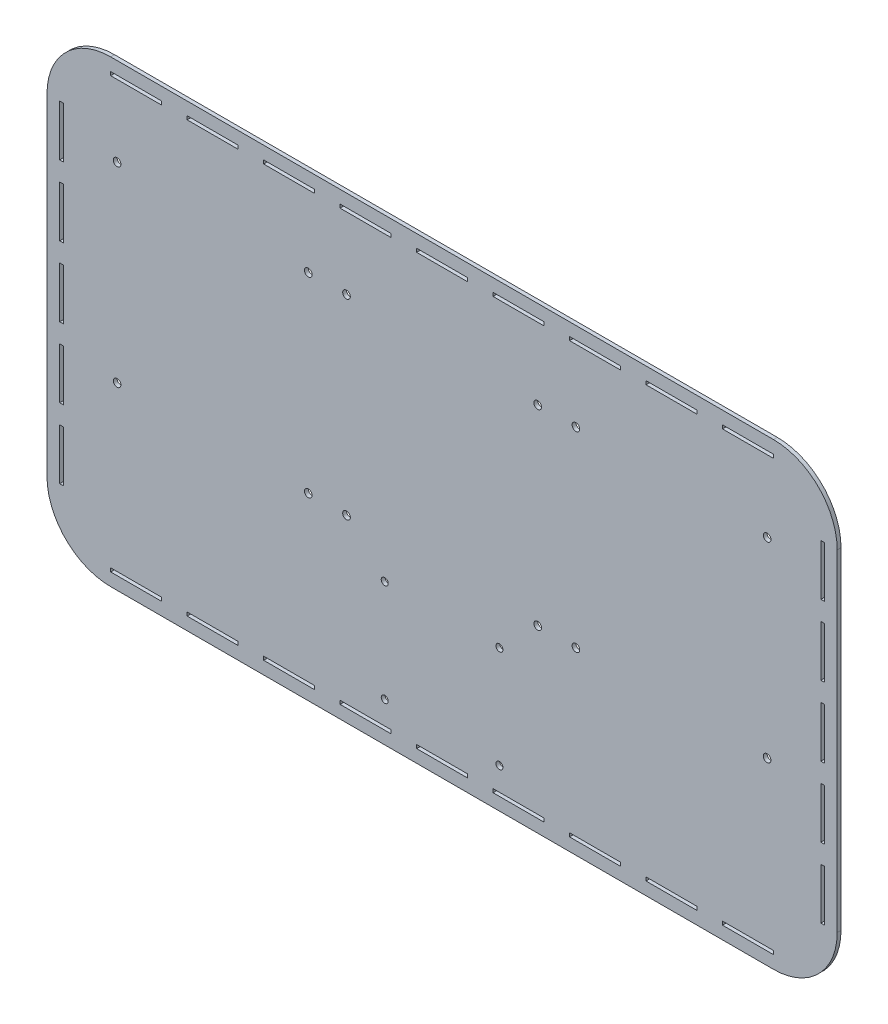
ISO-10303-21;
HEADER;
FILE_DESCRIPTION(('STEP AP214'),'2;1');
FILE_NAME('part.step','',(''),(''),'','','');
FILE_SCHEMA(('AUTOMOTIVE_DESIGN { 1 0 10303 214 1 1 1 1 }'));
ENDSEC;
DATA;
#1=APPLICATION_CONTEXT('core data for automotive mechanical design processes');
#2=APPLICATION_PROTOCOL_DEFINITION('international standard','automotive_design',2000,#1);
#3=PRODUCT_CONTEXT('',#1,'mechanical');
#4=PRODUCT('Part','Part','',(#3));
#5=PRODUCT_RELATED_PRODUCT_CATEGORY('part','',(#4));
#6=PRODUCT_DEFINITION_FORMATION('','',#4);
#7=PRODUCT_DEFINITION_CONTEXT('part definition',#1,'design');
#8=PRODUCT_DEFINITION('design','',#6,#7);
#9=PRODUCT_DEFINITION_SHAPE('','',#8);
#10=(LENGTH_UNIT() NAMED_UNIT(*) SI_UNIT(.MILLI.,.METRE.));
#11=(NAMED_UNIT(*) PLANE_ANGLE_UNIT() SI_UNIT($,.RADIAN.));
#12=(NAMED_UNIT(*) SI_UNIT($,.STERADIAN.) SOLID_ANGLE_UNIT());
#13=UNCERTAINTY_MEASURE_WITH_UNIT(LENGTH_MEASURE(1.E-05),#10,'distance_accuracy_value','');
#14=(GEOMETRIC_REPRESENTATION_CONTEXT(3) GLOBAL_UNCERTAINTY_ASSIGNED_CONTEXT((#13)) GLOBAL_UNIT_ASSIGNED_CONTEXT((#10,
#11,#12)) REPRESENTATION_CONTEXT('',''));
#15=CARTESIAN_POINT('',(0.,0.,0.));
#16=DIRECTION('',(0.,0.,1.));
#17=DIRECTION('',(1.,0.,0.));
#18=AXIS2_PLACEMENT_3D('',#15,#16,#17);
#19=CARTESIAN_POINT('',(260.,130.,3.));
#20=DIRECTION('',(0.,0.,-1.));
#21=DIRECTION('',(-1.,0.,0.));
#22=AXIS2_PLACEMENT_3D('',#19,#20,#21);
#23=CYLINDRICAL_SURFACE('',#22,50.);
#24=CARTESIAN_POINT('',(260.,130.,0.));
#25=DIRECTION('',(0.,0.,1.));
#26=DIRECTION('',(1.,0.,0.));
#27=AXIS2_PLACEMENT_3D('',#24,#25,#26);
#28=CIRCLE('',#27,50.);
#29=CARTESIAN_POINT('',(310.,130.,0.));
#30=VERTEX_POINT('',#29);
#31=CARTESIAN_POINT('',(260.,180.,0.));
#32=VERTEX_POINT('',#31);
#33=EDGE_CURVE('E2012',#30,#32,#28,.T.);
#34=ORIENTED_EDGE('',*,*,#33,.T.);
#35=DIRECTION('',(0.,0.,-1.));
#36=VECTOR('',#35,1.);
#37=CARTESIAN_POINT('',(260.,180.,3.));
#38=LINE('',#37,#36);
#39=CARTESIAN_POINT('',(260.,180.,3.));
#40=VERTEX_POINT('',#39);
#41=EDGE_CURVE('E11',#40,#32,#38,.T.);
#42=ORIENTED_EDGE('',*,*,#41,.F.);
#43=CARTESIAN_POINT('',(260.,130.,3.));
#44=DIRECTION('',(0.,0.,1.));
#45=DIRECTION('',(1.,0.,0.));
#46=AXIS2_PLACEMENT_3D('',#43,#44,#45);
#47=CIRCLE('',#46,50.);
#48=CARTESIAN_POINT('',(310.,130.,3.));
#49=VERTEX_POINT('',#48);
#50=EDGE_CURVE('E2022',#49,#40,#47,.T.);
#51=ORIENTED_EDGE('',*,*,#50,.F.);
#52=DIRECTION('',(0.,0.,-1.));
#53=VECTOR('',#52,1.);
#54=CARTESIAN_POINT('',(310.,130.,3.));
#55=LINE('',#54,#53);
#56=EDGE_CURVE('E2048',#49,#30,#55,.T.);
#57=ORIENTED_EDGE('',*,*,#56,.T.);
#58=EDGE_LOOP('',(#34,#42,#51,#57));
#59=FACE_BOUND('',#58,.T.);
#60=ADVANCED_FACE('F51',(#59),#23,.T.);
#61=CARTESIAN_POINT('',(260.,180.,3.));
#62=DIRECTION('',(0.,-1.,0.));
#63=DIRECTION('',(1.,0.,0.));
#64=AXIS2_PLACEMENT_3D('',#61,#62,#63);
#65=PLANE('',#64);
#66=DIRECTION('',(-1.,0.,0.));
#67=VECTOR('',#66,1.);
#68=CARTESIAN_POINT('',(260.,180.,0.));
#69=LINE('',#68,#67);
#70=CARTESIAN_POINT('',(-260.,180.,0.));
#71=VERTEX_POINT('',#70);
#72=EDGE_CURVE('E2052',#32,#71,#69,.T.);
#73=ORIENTED_EDGE('',*,*,#72,.T.);
#74=DIRECTION('',(0.,0.,-1.));
#75=VECTOR('',#74,1.);
#76=CARTESIAN_POINT('',(-260.,180.,3.));
#77=LINE('',#76,#75);
#78=CARTESIAN_POINT('',(-260.,180.,3.));
#79=VERTEX_POINT('',#78);
#80=EDGE_CURVE('E60',#79,#71,#77,.T.);
#81=ORIENTED_EDGE('',*,*,#80,.F.);
#82=DIRECTION('',(-1.,0.,0.));
#83=VECTOR('',#82,1.);
#84=CARTESIAN_POINT('',(260.,180.,3.));
#85=LINE('',#84,#83);
#86=EDGE_CURVE('E2026',#40,#79,#85,.T.);
#87=ORIENTED_EDGE('',*,*,#86,.F.);
#88=ORIENTED_EDGE('',*,*,#41,.T.);
#89=EDGE_LOOP('',(#73,#81,#87,#88));
#90=FACE_BOUND('',#89,.T.);
#91=ADVANCED_FACE('F2179',(#90),#65,.F.);
#92=CARTESIAN_POINT('',(-260.,130.,3.));
#93=DIRECTION('',(0.,0.,-1.));
#94=DIRECTION('',(-1.,0.,0.));
#95=AXIS2_PLACEMENT_3D('',#92,#93,#94);
#96=CYLINDRICAL_SURFACE('',#95,50.);
#97=CARTESIAN_POINT('',(-260.,130.,0.));
#98=DIRECTION('',(0.,0.,1.));
#99=DIRECTION('',(1.,0.,0.));
#100=AXIS2_PLACEMENT_3D('',#97,#98,#99);
#101=CIRCLE('',#100,50.);
#102=CARTESIAN_POINT('',(-310.,130.,0.));
#103=VERTEX_POINT('',#102);
#104=EDGE_CURVE('E2055',#71,#103,#101,.T.);
#105=ORIENTED_EDGE('',*,*,#104,.T.);
#106=DIRECTION('',(0.,0.,-1.));
#107=VECTOR('',#106,1.);
#108=CARTESIAN_POINT('',(-310.,130.,3.));
#109=LINE('',#108,#107);
#110=CARTESIAN_POINT('',(-310.,130.,3.));
#111=VERTEX_POINT('',#110);
#112=EDGE_CURVE('E2091',#111,#103,#109,.T.);
#113=ORIENTED_EDGE('',*,*,#112,.F.);
#114=CARTESIAN_POINT('',(-260.,130.,3.));
#115=DIRECTION('',(0.,0.,1.));
#116=DIRECTION('',(1.,0.,0.));
#117=AXIS2_PLACEMENT_3D('',#114,#115,#116);
#118=CIRCLE('',#117,50.);
#119=EDGE_CURVE('E2030',#79,#111,#118,.T.);
#120=ORIENTED_EDGE('',*,*,#119,.F.);
#121=ORIENTED_EDGE('',*,*,#80,.T.);
#122=EDGE_LOOP('',(#105,#113,#120,#121));
#123=FACE_BOUND('',#122,.T.);
#124=ADVANCED_FACE('F2184',(#123),#96,.T.);
#125=CARTESIAN_POINT('',(-310.,-130.,3.));
#126=DIRECTION('',(1.,0.,0.));
#127=DIRECTION('',(0.,1.,0.));
#128=AXIS2_PLACEMENT_3D('',#125,#126,#127);
#129=PLANE('',#128);
#130=DIRECTION('',(0.,-1.,0.));
#131=VECTOR('',#130,1.);
#132=CARTESIAN_POINT('',(-310.,-130.,0.));
#133=LINE('',#132,#131);
#134=CARTESIAN_POINT('',(-310.,-130.,0.));
#135=VERTEX_POINT('',#134);
#136=EDGE_CURVE('E2058',#103,#135,#133,.T.);
#137=ORIENTED_EDGE('',*,*,#136,.T.);
#138=DIRECTION('',(0.,0.,-1.));
#139=VECTOR('',#138,1.);
#140=CARTESIAN_POINT('',(-310.,-130.,3.));
#141=LINE('',#140,#139);
#142=CARTESIAN_POINT('',(-310.,-130.,3.));
#143=VERTEX_POINT('',#142);
#144=EDGE_CURVE('E2087',#143,#135,#141,.T.);
#145=ORIENTED_EDGE('',*,*,#144,.F.);
#146=DIRECTION('',(0.,-1.,0.));
#147=VECTOR('',#146,1.);
#148=CARTESIAN_POINT('',(-310.,-130.,3.));
#149=LINE('',#148,#147);
#150=EDGE_CURVE('E2033',#111,#143,#149,.T.);
#151=ORIENTED_EDGE('',*,*,#150,.F.);
#152=ORIENTED_EDGE('',*,*,#112,.T.);
#153=EDGE_LOOP('',(#137,#145,#151,#152));
#154=FACE_BOUND('',#153,.T.);
#155=ADVANCED_FACE('F2218',(#154),#129,.F.);
#156=CARTESIAN_POINT('',(-260.,-130.,3.));
#157=DIRECTION('',(0.,0.,-1.));
#158=DIRECTION('',(-1.,0.,0.));
#159=AXIS2_PLACEMENT_3D('',#156,#157,#158);
#160=CYLINDRICAL_SURFACE('',#159,50.);
#161=CARTESIAN_POINT('',(-260.,-130.,0.));
#162=DIRECTION('',(0.,0.,1.));
#163=DIRECTION('',(-1.,0.,0.));
#164=AXIS2_PLACEMENT_3D('',#161,#162,#163);
#165=CIRCLE('',#164,50.);
#166=CARTESIAN_POINT('',(-260.,-180.,0.));
#167=VERTEX_POINT('',#166);
#168=EDGE_CURVE('E2061',#135,#167,#165,.T.);
#169=ORIENTED_EDGE('',*,*,#168,.T.);
#170=DIRECTION('',(0.,0.,-1.));
#171=VECTOR('',#170,1.);
#172=CARTESIAN_POINT('',(-260.,-180.,3.));
#173=LINE('',#172,#171);
#174=CARTESIAN_POINT('',(-260.,-180.,3.));
#175=VERTEX_POINT('',#174);
#176=EDGE_CURVE('E2083',#175,#167,#173,.T.);
#177=ORIENTED_EDGE('',*,*,#176,.F.);
#178=CARTESIAN_POINT('',(-260.,-130.,3.));
#179=DIRECTION('',(0.,0.,1.));
#180=DIRECTION('',(-1.,0.,0.));
#181=AXIS2_PLACEMENT_3D('',#178,#179,#180);
#182=CIRCLE('',#181,50.);
#183=EDGE_CURVE('E2036',#143,#175,#182,.T.);
#184=ORIENTED_EDGE('',*,*,#183,.F.);
#185=ORIENTED_EDGE('',*,*,#144,.T.);
#186=EDGE_LOOP('',(#169,#177,#184,#185));
#187=FACE_BOUND('',#186,.T.);
#188=ADVANCED_FACE('F2214',(#187),#160,.T.);
#189=CARTESIAN_POINT('',(260.,-180.,3.));
#190=DIRECTION('',(0.,1.,0.));
#191=DIRECTION('',(-1.,0.,0.));
#192=AXIS2_PLACEMENT_3D('',#189,#190,#191);
#193=PLANE('',#192);
#194=DIRECTION('',(1.,0.,0.));
#195=VECTOR('',#194,1.);
#196=CARTESIAN_POINT('',(260.,-180.,0.));
#197=LINE('',#196,#195);
#198=CARTESIAN_POINT('',(260.,-180.,0.));
#199=VERTEX_POINT('',#198);
#200=EDGE_CURVE('E2064',#167,#199,#197,.T.);
#201=ORIENTED_EDGE('',*,*,#200,.T.);
#202=DIRECTION('',(0.,0.,-1.));
#203=VECTOR('',#202,1.);
#204=CARTESIAN_POINT('',(260.,-180.,3.));
#205=LINE('',#204,#203);
#206=CARTESIAN_POINT('',(260.,-180.,3.));
#207=VERTEX_POINT('',#206);
#208=EDGE_CURVE('E2079',#207,#199,#205,.T.);
#209=ORIENTED_EDGE('',*,*,#208,.F.);
#210=DIRECTION('',(1.,0.,0.));
#211=VECTOR('',#210,1.);
#212=CARTESIAN_POINT('',(260.,-180.,3.));
#213=LINE('',#212,#211);
#214=EDGE_CURVE('E2039',#175,#207,#213,.T.);
#215=ORIENTED_EDGE('',*,*,#214,.F.);
#216=ORIENTED_EDGE('',*,*,#176,.T.);
#217=EDGE_LOOP('',(#201,#209,#215,#216));
#218=FACE_BOUND('',#217,.T.);
#219=ADVANCED_FACE('F2209',(#218),#193,.F.);
#220=CARTESIAN_POINT('',(260.,-130.,3.));
#221=DIRECTION('',(0.,0.,-1.));
#222=DIRECTION('',(-1.,0.,0.));
#223=AXIS2_PLACEMENT_3D('',#220,#221,#222);
#224=CYLINDRICAL_SURFACE('',#223,50.);
#225=CARTESIAN_POINT('',(260.,-130.,0.));
#226=DIRECTION('',(0.,0.,1.));
#227=DIRECTION('',(1.,0.,0.));
#228=AXIS2_PLACEMENT_3D('',#225,#226,#227);
#229=CIRCLE('',#228,50.);
#230=CARTESIAN_POINT('',(310.,-130.,0.));
#231=VERTEX_POINT('',#230);
#232=EDGE_CURVE('E2067',#199,#231,#229,.T.);
#233=ORIENTED_EDGE('',*,*,#232,.T.);
#234=DIRECTION('',(0.,0.,-1.));
#235=VECTOR('',#234,1.);
#236=CARTESIAN_POINT('',(310.,-130.,3.));
#237=LINE('',#236,#235);
#238=CARTESIAN_POINT('',(310.,-130.,3.));
#239=VERTEX_POINT('',#238);
#240=EDGE_CURVE('E2075',#239,#231,#237,.T.);
#241=ORIENTED_EDGE('',*,*,#240,.F.);
#242=CARTESIAN_POINT('',(260.,-130.,3.));
#243=DIRECTION('',(0.,0.,1.));
#244=DIRECTION('',(1.,0.,0.));
#245=AXIS2_PLACEMENT_3D('',#242,#243,#244);
#246=CIRCLE('',#245,50.);
#247=EDGE_CURVE('E2042',#207,#239,#246,.T.);
#248=ORIENTED_EDGE('',*,*,#247,.F.);
#249=ORIENTED_EDGE('',*,*,#208,.T.);
#250=EDGE_LOOP('',(#233,#241,#248,#249));
#251=FACE_BOUND('',#250,.T.);
#252=ADVANCED_FACE('F2204',(#251),#224,.T.);
#253=CARTESIAN_POINT('',(310.,-130.,3.));
#254=DIRECTION('',(-1.,0.,0.));
#255=DIRECTION('',(0.,0.,1.));
#256=AXIS2_PLACEMENT_3D('',#253,#254,#255);
#257=PLANE('',#256);
#258=DIRECTION('',(0.,1.,0.));
#259=VECTOR('',#258,1.);
#260=CARTESIAN_POINT('',(310.,-130.,0.));
#261=LINE('',#260,#259);
#262=EDGE_CURVE('E2027',#231,#30,#261,.T.);
#263=ORIENTED_EDGE('',*,*,#262,.T.);
#264=ORIENTED_EDGE('',*,*,#56,.F.);
#265=DIRECTION('',(0.,1.,0.));
#266=VECTOR('',#265,1.);
#267=CARTESIAN_POINT('',(310.,-130.,3.));
#268=LINE('',#267,#266);
#269=EDGE_CURVE('E2045',#239,#49,#268,.T.);
#270=ORIENTED_EDGE('',*,*,#269,.F.);
#271=ORIENTED_EDGE('',*,*,#240,.T.);
#272=EDGE_LOOP('',(#263,#264,#270,#271));
#273=FACE_BOUND('',#272,.T.);
#274=ADVANCED_FACE('F2202',(#273),#257,.F.);
#275=CARTESIAN_POINT('',(260.,130.,3.));
#276=DIRECTION('',(0.,0.,1.));
#277=DIRECTION('',(1.,0.,0.));
#278=AXIS2_PLACEMENT_3D('',#275,#276,#277);
#279=PLANE('',#278);
#280=CARTESIAN_POINT('',(-75.,111.,3.));
#281=DIRECTION('',(0.,0.,1.));
#282=DIRECTION('',(1.,0.,0.));
#283=AXIS2_PLACEMENT_3D('',#280,#281,#282);
#284=CIRCLE('',#283,3.00000000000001);
#285=CARTESIAN_POINT('',(-72.,111.,3.));
#286=VERTEX_POINT('',#285);
#287=EDGE_CURVE('E2883',#286,#286,#284,.T.);
#288=ORIENTED_EDGE('',*,*,#287,.F.);
#289=EDGE_LOOP('',(#288));
#290=FACE_BOUND('',#289,.T.);
#291=CARTESIAN_POINT('',(74.9999999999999,111.,3.));
#292=DIRECTION('',(0.,0.,1.));
#293=DIRECTION('',(-1.,0.,0.));
#294=AXIS2_PLACEMENT_3D('',#291,#292,#293);
#295=CIRCLE('',#294,3.00000000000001);
#296=CARTESIAN_POINT('',(71.9999999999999,111.,3.));
#297=VERTEX_POINT('',#296);
#298=EDGE_CURVE('E2886',#297,#297,#295,.T.);
#299=ORIENTED_EDGE('',*,*,#298,.F.);
#300=EDGE_LOOP('',(#299));
#301=FACE_BOUND('',#300,.T.);
#302=CARTESIAN_POINT('',(74.9999999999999,-39.0000000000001,3.));
#303=DIRECTION('',(0.,0.,1.));
#304=DIRECTION('',(-1.,0.,0.));
#305=AXIS2_PLACEMENT_3D('',#302,#303,#304);
#306=CIRCLE('',#305,3.00000000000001);
#307=CARTESIAN_POINT('',(71.9999999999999,-39.0000000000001,3.));
#308=VERTEX_POINT('',#307);
#309=EDGE_CURVE('E2890',#308,#308,#306,.T.);
#310=ORIENTED_EDGE('',*,*,#309,.F.);
#311=EDGE_LOOP('',(#310));
#312=FACE_BOUND('',#311,.T.);
#313=CARTESIAN_POINT('',(105.,111.,3.));
#314=DIRECTION('',(0.,0.,1.));
#315=DIRECTION('',(-1.,0.,0.));
#316=AXIS2_PLACEMENT_3D('',#313,#314,#315);
#317=CIRCLE('',#316,3.00000000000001);
#318=CARTESIAN_POINT('',(102.,111.,3.));
#319=VERTEX_POINT('',#318);
#320=EDGE_CURVE('E2893',#319,#319,#317,.T.);
#321=ORIENTED_EDGE('',*,*,#320,.F.);
#322=EDGE_LOOP('',(#321));
#323=FACE_BOUND('',#322,.T.);
#324=CARTESIAN_POINT('',(-255.,-39.0000000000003,3.));
#325=DIRECTION('',(0.,0.,1.));
#326=DIRECTION('',(1.,0.,0.));
#327=AXIS2_PLACEMENT_3D('',#324,#325,#326);
#328=CIRCLE('',#327,2.99999999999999);
#329=CARTESIAN_POINT('',(-252.,-39.0000000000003,3.));
#330=VERTEX_POINT('',#329);
#331=EDGE_CURVE('E2871',#330,#330,#328,.T.);
#332=ORIENTED_EDGE('',*,*,#331,.F.);
#333=EDGE_LOOP('',(#332));
#334=FACE_BOUND('',#333,.T.);
#335=CARTESIAN_POINT('',(-105.,111.,3.));
#336=DIRECTION('',(0.,0.,1.));
#337=DIRECTION('',(1.,0.,0.));
#338=AXIS2_PLACEMENT_3D('',#335,#336,#337);
#339=CIRCLE('',#338,3.00000000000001);
#340=CARTESIAN_POINT('',(-102.,111.,3.));
#341=VERTEX_POINT('',#340);
#342=EDGE_CURVE('E2872',#341,#341,#339,.T.);
#343=ORIENTED_EDGE('',*,*,#342,.F.);
#344=EDGE_LOOP('',(#343));
#345=FACE_BOUND('',#344,.T.);
#346=CARTESIAN_POINT('',(-105.,-39.0000000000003,3.));
#347=DIRECTION('',(0.,0.,1.));
#348=DIRECTION('',(1.,0.,0.));
#349=AXIS2_PLACEMENT_3D('',#346,#347,#348);
#350=CIRCLE('',#349,3.00000000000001);
#351=CARTESIAN_POINT('',(-102.,-39.0000000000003,3.));
#352=VERTEX_POINT('',#351);
#353=EDGE_CURVE('E2710',#352,#352,#350,.T.);
#354=ORIENTED_EDGE('',*,*,#353,.F.);
#355=EDGE_LOOP('',(#354));
#356=FACE_BOUND('',#355,.T.);
#357=CARTESIAN_POINT('',(-75.,-39.0000000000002,3.));
#358=DIRECTION('',(0.,0.,1.));
#359=DIRECTION('',(1.,0.,0.));
#360=AXIS2_PLACEMENT_3D('',#357,#358,#359);
#361=CIRCLE('',#360,3.00000000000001);
#362=CARTESIAN_POINT('',(-72.,-39.0000000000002,3.));
#363=VERTEX_POINT('',#362);
#364=EDGE_CURVE('E2879',#363,#363,#361,.T.);
#365=ORIENTED_EDGE('',*,*,#364,.F.);
#366=EDGE_LOOP('',(#365));
#367=FACE_BOUND('',#366,.T.);
#368=CARTESIAN_POINT('',(44.9999999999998,-69.0000000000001,3.));
#369=DIRECTION('',(0.,0.,1.));
#370=DIRECTION('',(-1.,0.,0.));
#371=AXIS2_PLACEMENT_3D('',#368,#369,#370);
#372=CIRCLE('',#371,2.75);
#373=CARTESIAN_POINT('',(42.2499999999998,-69.0000000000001,3.));
#374=VERTEX_POINT('',#373);
#375=EDGE_CURVE('E2917',#374,#374,#372,.T.);
#376=ORIENTED_EDGE('',*,*,#375,.F.);
#377=EDGE_LOOP('',(#376));
#378=FACE_BOUND('',#377,.T.);
#379=CARTESIAN_POINT('',(44.9999999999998,-149.,3.));
#380=DIRECTION('',(0.,0.,1.));
#381=DIRECTION('',(-1.,0.,0.));
#382=AXIS2_PLACEMENT_3D('',#379,#380,#381);
#383=CIRCLE('',#382,2.75);
#384=CARTESIAN_POINT('',(42.2499999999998,-149.,3.));
#385=VERTEX_POINT('',#384);
#386=EDGE_CURVE('E2921',#385,#385,#383,.T.);
#387=ORIENTED_EDGE('',*,*,#386,.F.);
#388=EDGE_LOOP('',(#387));
#389=FACE_BOUND('',#388,.T.);
#390=CARTESIAN_POINT('',(-45.,-149.,3.));
#391=DIRECTION('',(0.,0.,1.));
#392=DIRECTION('',(1.,0.,0.));
#393=AXIS2_PLACEMENT_3D('',#390,#391,#392);
#394=CIRCLE('',#393,2.75);
#395=CARTESIAN_POINT('',(-42.25,-149.,3.));
#396=VERTEX_POINT('',#395);
#397=EDGE_CURVE('E2913',#396,#396,#394,.T.);
#398=ORIENTED_EDGE('',*,*,#397,.F.);
#399=EDGE_LOOP('',(#398));
#400=FACE_BOUND('',#399,.T.);
#401=CARTESIAN_POINT('',(105.,-39.0000000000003,3.));
#402=DIRECTION('',(0.,0.,1.));
#403=DIRECTION('',(-1.,0.,0.));
#404=AXIS2_PLACEMENT_3D('',#401,#402,#403);
#405=CIRCLE('',#404,3.00000000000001);
#406=CARTESIAN_POINT('',(102.,-39.0000000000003,3.));
#407=VERTEX_POINT('',#406);
#408=EDGE_CURVE('E2897',#407,#407,#405,.T.);
#409=ORIENTED_EDGE('',*,*,#408,.F.);
#410=EDGE_LOOP('',(#409));
#411=FACE_BOUND('',#410,.T.);
#412=CARTESIAN_POINT('',(255.,-39.0000000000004,3.));
#413=DIRECTION('',(0.,0.,1.));
#414=DIRECTION('',(-1.,0.,0.));
#415=AXIS2_PLACEMENT_3D('',#412,#413,#414);
#416=CIRCLE('',#415,2.99999999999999);
#417=CARTESIAN_POINT('',(252.,-39.0000000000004,3.));
#418=VERTEX_POINT('',#417);
#419=EDGE_CURVE('E2901',#418,#418,#416,.T.);
#420=ORIENTED_EDGE('',*,*,#419,.F.);
#421=EDGE_LOOP('',(#420));
#422=FACE_BOUND('',#421,.T.);
#423=CARTESIAN_POINT('',(255.,111.,3.));
#424=DIRECTION('',(0.,0.,1.));
#425=DIRECTION('',(-1.,0.,0.));
#426=AXIS2_PLACEMENT_3D('',#423,#424,#425);
#427=CIRCLE('',#426,2.99999999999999);
#428=CARTESIAN_POINT('',(252.,111.,3.));
#429=VERTEX_POINT('',#428);
#430=EDGE_CURVE('E2905',#429,#429,#427,.T.);
#431=ORIENTED_EDGE('',*,*,#430,.F.);
#432=EDGE_LOOP('',(#431));
#433=FACE_BOUND('',#432,.T.);
#434=CARTESIAN_POINT('',(-45.,-69.0000000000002,3.));
#435=DIRECTION('',(0.,0.,1.));
#436=DIRECTION('',(1.,0.,0.));
#437=AXIS2_PLACEMENT_3D('',#434,#435,#436);
#438=CIRCLE('',#437,2.75);
#439=CARTESIAN_POINT('',(-42.25,-69.0000000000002,3.));
#440=VERTEX_POINT('',#439);
#441=EDGE_CURVE('E2909',#440,#440,#438,.T.);
#442=ORIENTED_EDGE('',*,*,#441,.F.);
#443=EDGE_LOOP('',(#442));
#444=FACE_BOUND('',#443,.T.);
#445=CARTESIAN_POINT('',(-255.,111.,3.));
#446=DIRECTION('',(0.,0.,1.));
#447=DIRECTION('',(1.,0.,0.));
#448=AXIS2_PLACEMENT_3D('',#445,#446,#447);
#449=CIRCLE('',#448,2.99999999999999);
#450=CARTESIAN_POINT('',(-252.,111.,3.));
#451=VERTEX_POINT('',#450);
#452=EDGE_CURVE('E2103',#451,#451,#449,.T.);
#453=ORIENTED_EDGE('',*,*,#452,.F.);
#454=EDGE_LOOP('',(#453));
#455=FACE_BOUND('',#454,.T.);
#456=DIRECTION('',(1.,0.,0.));
#457=VECTOR('',#456,1.);
#458=CARTESIAN_POINT('',(-200.,-170.,3.));
#459=LINE('',#458,#457);
#460=CARTESIAN_POINT('',(-200.,-170.,3.));
#461=VERTEX_POINT('',#460);
#462=CARTESIAN_POINT('',(-160.,-170.,3.));
#463=VERTEX_POINT('',#462);
#464=EDGE_CURVE('E68',#461,#463,#459,.T.);
#465=ORIENTED_EDGE('',*,*,#464,.F.);
#466=DIRECTION('',(0.,-1.,0.));
#467=VECTOR('',#466,1.);
#468=CARTESIAN_POINT('',(-200.,-170.,3.));
#469=LINE('',#468,#467);
#470=CARTESIAN_POINT('',(-200.,-167.2,3.));
#471=VERTEX_POINT('',#470);
#472=EDGE_CURVE('E1597',#471,#461,#469,.T.);
#473=ORIENTED_EDGE('',*,*,#472,.F.);
#474=DIRECTION('',(-1.,0.,0.));
#475=VECTOR('',#474,1.);
#476=CARTESIAN_POINT('',(-200.,-167.2,3.));
#477=LINE('',#476,#475);
#478=CARTESIAN_POINT('',(-160.,-167.2,3.));
#479=VERTEX_POINT('',#478);
#480=EDGE_CURVE('E1601',#479,#471,#477,.T.);
#481=ORIENTED_EDGE('',*,*,#480,.F.);
#482=DIRECTION('',(0.,1.,0.));
#483=VECTOR('',#482,1.);
#484=CARTESIAN_POINT('',(-160.,-170.,3.));
#485=LINE('',#484,#483);
#486=EDGE_CURVE('E1606',#463,#479,#485,.T.);
#487=ORIENTED_EDGE('',*,*,#486,.F.);
#488=EDGE_LOOP('',(#465,#473,#481,#487));
#489=FACE_BOUND('',#488,.T.);
#490=DIRECTION('',(1.,0.,0.));
#491=VECTOR('',#490,1.);
#492=CARTESIAN_POINT('',(-140.,-170.,3.));
#493=LINE('',#492,#491);
#494=CARTESIAN_POINT('',(-140.,-170.,3.));
#495=VERTEX_POINT('',#494);
#496=CARTESIAN_POINT('',(-100.,-170.,3.));
#497=VERTEX_POINT('',#496);
#498=EDGE_CURVE('E76',#495,#497,#493,.T.);
#499=ORIENTED_EDGE('',*,*,#498,.F.);
#500=DIRECTION('',(0.,-1.,0.));
#501=VECTOR('',#500,1.);
#502=CARTESIAN_POINT('',(-140.,-170.,3.));
#503=LINE('',#502,#501);
#504=CARTESIAN_POINT('',(-140.,-167.2,3.));
#505=VERTEX_POINT('',#504);
#506=EDGE_CURVE('E1556',#505,#495,#503,.T.);
#507=ORIENTED_EDGE('',*,*,#506,.F.);
#508=DIRECTION('',(-1.,0.,0.));
#509=VECTOR('',#508,1.);
#510=CARTESIAN_POINT('',(-140.,-167.2,3.));
#511=LINE('',#510,#509);
#512=CARTESIAN_POINT('',(-100.,-167.2,3.));
#513=VERTEX_POINT('',#512);
#514=EDGE_CURVE('E1560',#513,#505,#511,.T.);
#515=ORIENTED_EDGE('',*,*,#514,.F.);
#516=DIRECTION('',(0.,1.,0.));
#517=VECTOR('',#516,1.);
#518=CARTESIAN_POINT('',(-100.,-170.,3.));
#519=LINE('',#518,#517);
#520=EDGE_CURVE('E1565',#497,#513,#519,.T.);
#521=ORIENTED_EDGE('',*,*,#520,.F.);
#522=EDGE_LOOP('',(#499,#507,#515,#521));
#523=FACE_BOUND('',#522,.T.);
#524=DIRECTION('',(1.,0.,0.));
#525=VECTOR('',#524,1.);
#526=CARTESIAN_POINT('',(-80.0000000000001,-170.,3.));
#527=LINE('',#526,#525);
#528=CARTESIAN_POINT('',(-80.0000000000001,-170.,3.));
#529=VERTEX_POINT('',#528);
#530=CARTESIAN_POINT('',(-40.0000000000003,-170.,3.));
#531=VERTEX_POINT('',#530);
#532=EDGE_CURVE('E1470',#529,#531,#527,.T.);
#533=ORIENTED_EDGE('',*,*,#532,.F.);
#534=DIRECTION('',(0.,-1.,0.));
#535=VECTOR('',#534,1.);
#536=CARTESIAN_POINT('',(-80.0000000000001,-170.,3.));
#537=LINE('',#536,#535);
#538=CARTESIAN_POINT('',(-80.0000000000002,-167.2,3.));
#539=VERTEX_POINT('',#538);
#540=EDGE_CURVE('E1514',#539,#529,#537,.T.);
#541=ORIENTED_EDGE('',*,*,#540,.F.);
#542=DIRECTION('',(-1.,0.,0.));
#543=VECTOR('',#542,1.);
#544=CARTESIAN_POINT('',(-80.0000000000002,-167.2,3.));
#545=LINE('',#544,#543);
#546=CARTESIAN_POINT('',(-40.0000000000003,-167.2,3.));
#547=VERTEX_POINT('',#546);
#548=EDGE_CURVE('E1518',#547,#539,#545,.T.);
#549=ORIENTED_EDGE('',*,*,#548,.F.);
#550=DIRECTION('',(0.,1.,0.));
#551=VECTOR('',#550,1.);
#552=CARTESIAN_POINT('',(-40.0000000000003,-170.,3.));
#553=LINE('',#552,#551);
#554=EDGE_CURVE('E1523',#531,#547,#553,.T.);
#555=ORIENTED_EDGE('',*,*,#554,.F.);
#556=EDGE_LOOP('',(#533,#541,#549,#555));
#557=FACE_BOUND('',#556,.T.);
#558=DIRECTION('',(1.,0.,0.));
#559=VECTOR('',#558,1.);
#560=CARTESIAN_POINT('',(-20.0000000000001,-170.,3.));
#561=LINE('',#560,#559);
#562=CARTESIAN_POINT('',(-20.0000000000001,-170.,3.));
#563=VERTEX_POINT('',#562);
#564=CARTESIAN_POINT('',(19.9999999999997,-170.,3.));
#565=VERTEX_POINT('',#564);
#566=EDGE_CURVE('E1426',#563,#565,#561,.T.);
#567=ORIENTED_EDGE('',*,*,#566,.F.);
#568=DIRECTION('',(0.,-1.,0.));
#569=VECTOR('',#568,1.);
#570=CARTESIAN_POINT('',(-20.0000000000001,-170.,3.));
#571=LINE('',#570,#569);
#572=CARTESIAN_POINT('',(-20.0000000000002,-167.2,3.));
#573=VERTEX_POINT('',#572);
#574=EDGE_CURVE('E1471',#573,#563,#571,.T.);
#575=ORIENTED_EDGE('',*,*,#574,.F.);
#576=DIRECTION('',(-1.,0.,0.));
#577=VECTOR('',#576,1.);
#578=CARTESIAN_POINT('',(-20.0000000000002,-167.2,3.));
#579=LINE('',#578,#577);
#580=CARTESIAN_POINT('',(19.9999999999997,-167.2,3.));
#581=VERTEX_POINT('',#580);
#582=EDGE_CURVE('E1475',#581,#573,#579,.T.);
#583=ORIENTED_EDGE('',*,*,#582,.F.);
#584=DIRECTION('',(0.,1.,0.));
#585=VECTOR('',#584,1.);
#586=CARTESIAN_POINT('',(19.9999999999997,-170.,3.));
#587=LINE('',#586,#585);
#588=EDGE_CURVE('E1480',#565,#581,#587,.T.);
#589=ORIENTED_EDGE('',*,*,#588,.F.);
#590=EDGE_LOOP('',(#567,#575,#583,#589));
#591=FACE_BOUND('',#590,.T.);
#592=DIRECTION('',(1.,0.,0.));
#593=VECTOR('',#592,1.);
#594=CARTESIAN_POINT('',(39.9999999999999,-170.,3.));
#595=LINE('',#594,#593);
#596=CARTESIAN_POINT('',(39.9999999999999,-170.,3.));
#597=VERTEX_POINT('',#596);
#598=CARTESIAN_POINT('',(79.9999999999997,-170.,3.));
#599=VERTEX_POINT('',#598);
#600=EDGE_CURVE('E1382',#597,#599,#595,.T.);
#601=ORIENTED_EDGE('',*,*,#600,.F.);
#602=DIRECTION('',(0.,-1.,0.));
#603=VECTOR('',#602,1.);
#604=CARTESIAN_POINT('',(39.9999999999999,-170.,3.));
#605=LINE('',#604,#603);
#606=CARTESIAN_POINT('',(39.9999999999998,-167.2,3.));
#607=VERTEX_POINT('',#606);
#608=EDGE_CURVE('E1427',#607,#597,#605,.T.);
#609=ORIENTED_EDGE('',*,*,#608,.F.);
#610=DIRECTION('',(-1.,0.,0.));
#611=VECTOR('',#610,1.);
#612=CARTESIAN_POINT('',(39.9999999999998,-167.2,3.));
#613=LINE('',#612,#611);
#614=CARTESIAN_POINT('',(79.9999999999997,-167.2,3.));
#615=VERTEX_POINT('',#614);
#616=EDGE_CURVE('E1431',#615,#607,#613,.T.);
#617=ORIENTED_EDGE('',*,*,#616,.F.);
#618=DIRECTION('',(0.,1.,0.));
#619=VECTOR('',#618,1.);
#620=CARTESIAN_POINT('',(79.9999999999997,-170.,3.));
#621=LINE('',#620,#619);
#622=EDGE_CURVE('E1436',#599,#615,#621,.T.);
#623=ORIENTED_EDGE('',*,*,#622,.F.);
#624=EDGE_LOOP('',(#601,#609,#617,#623));
#625=FACE_BOUND('',#624,.T.);
#626=DIRECTION('',(1.,0.,0.));
#627=VECTOR('',#626,1.);
#628=CARTESIAN_POINT('',(99.9999999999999,-170.,3.));
#629=LINE('',#628,#627);
#630=CARTESIAN_POINT('',(99.9999999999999,-170.,3.));
#631=VERTEX_POINT('',#630);
#632=CARTESIAN_POINT('',(140.,-170.,3.));
#633=VERTEX_POINT('',#632);
#634=EDGE_CURVE('E1338',#631,#633,#629,.T.);
#635=ORIENTED_EDGE('',*,*,#634,.F.);
#636=DIRECTION('',(0.,-1.,0.));
#637=VECTOR('',#636,1.);
#638=CARTESIAN_POINT('',(99.9999999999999,-170.,3.));
#639=LINE('',#638,#637);
#640=CARTESIAN_POINT('',(99.9999999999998,-167.2,3.));
#641=VERTEX_POINT('',#640);
#642=EDGE_CURVE('E1383',#641,#631,#639,.T.);
#643=ORIENTED_EDGE('',*,*,#642,.F.);
#644=DIRECTION('',(-1.,0.,0.));
#645=VECTOR('',#644,1.);
#646=CARTESIAN_POINT('',(99.9999999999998,-167.2,3.));
#647=LINE('',#646,#645);
#648=CARTESIAN_POINT('',(140.,-167.2,3.));
#649=VERTEX_POINT('',#648);
#650=EDGE_CURVE('E1387',#649,#641,#647,.T.);
#651=ORIENTED_EDGE('',*,*,#650,.F.);
#652=DIRECTION('',(0.,1.,0.));
#653=VECTOR('',#652,1.);
#654=CARTESIAN_POINT('',(140.,-170.,3.));
#655=LINE('',#654,#653);
#656=EDGE_CURVE('E1392',#633,#649,#655,.T.);
#657=ORIENTED_EDGE('',*,*,#656,.F.);
#658=EDGE_LOOP('',(#635,#643,#651,#657));
#659=FACE_BOUND('',#658,.T.);
#660=DIRECTION('',(1.,0.,0.));
#661=VECTOR('',#660,1.);
#662=CARTESIAN_POINT('',(160.,-170.,3.));
#663=LINE('',#662,#661);
#664=CARTESIAN_POINT('',(160.,-170.,3.));
#665=VERTEX_POINT('',#664);
#666=CARTESIAN_POINT('',(200.,-170.,3.));
#667=VERTEX_POINT('',#666);
#668=EDGE_CURVE('E1292',#665,#667,#663,.T.);
#669=ORIENTED_EDGE('',*,*,#668,.F.);
#670=DIRECTION('',(0.,-1.,0.));
#671=VECTOR('',#670,1.);
#672=CARTESIAN_POINT('',(160.,-170.,3.));
#673=LINE('',#672,#671);
#674=CARTESIAN_POINT('',(160.,-167.2,3.));
#675=VERTEX_POINT('',#674);
#676=EDGE_CURVE('E1339',#675,#665,#673,.T.);
#677=ORIENTED_EDGE('',*,*,#676,.F.);
#678=DIRECTION('',(-1.,0.,0.));
#679=VECTOR('',#678,1.);
#680=CARTESIAN_POINT('',(160.,-167.2,3.));
#681=LINE('',#680,#679);
#682=CARTESIAN_POINT('',(200.,-167.2,3.));
#683=VERTEX_POINT('',#682);
#684=EDGE_CURVE('E1343',#683,#675,#681,.T.);
#685=ORIENTED_EDGE('',*,*,#684,.F.);
#686=DIRECTION('',(0.,1.,0.));
#687=VECTOR('',#686,1.);
#688=CARTESIAN_POINT('',(200.,-170.,3.));
#689=LINE('',#688,#687);
#690=EDGE_CURVE('E1348',#667,#683,#689,.T.);
#691=ORIENTED_EDGE('',*,*,#690,.F.);
#692=EDGE_LOOP('',(#669,#677,#685,#691));
#693=FACE_BOUND('',#692,.T.);
#694=DIRECTION('',(0.,-1.,0.));
#695=VECTOR('',#694,1.);
#696=CARTESIAN_POINT('',(220.,170.,3.));
#697=LINE('',#696,#695);
#698=CARTESIAN_POINT('',(220.,170.,3.));
#699=VERTEX_POINT('',#698);
#700=CARTESIAN_POINT('',(220.,167.2,3.));
#701=VERTEX_POINT('',#700);
#702=EDGE_CURVE('E1306',#699,#701,#697,.T.);
#703=ORIENTED_EDGE('',*,*,#702,.F.);
#704=DIRECTION('',(-1.,0.,0.));
#705=VECTOR('',#704,1.);
#706=CARTESIAN_POINT('',(220.,170.,3.));
#707=LINE('',#706,#705);
#708=CARTESIAN_POINT('',(260.,170.,3.));
#709=VERTEX_POINT('',#708);
#710=EDGE_CURVE('E1293',#709,#699,#707,.T.);
#711=ORIENTED_EDGE('',*,*,#710,.F.);
#712=DIRECTION('',(0.,1.,0.));
#713=VECTOR('',#712,1.);
#714=CARTESIAN_POINT('',(260.,170.,3.));
#715=LINE('',#714,#713);
#716=CARTESIAN_POINT('',(260.,167.2,3.));
#717=VERTEX_POINT('',#716);
#718=EDGE_CURVE('E1297',#717,#709,#715,.T.);
#719=ORIENTED_EDGE('',*,*,#718,.F.);
#720=DIRECTION('',(1.,0.,0.));
#721=VECTOR('',#720,1.);
#722=CARTESIAN_POINT('',(220.,167.2,3.));
#723=LINE('',#722,#721);
#724=EDGE_CURVE('E1302',#701,#717,#723,.T.);
#725=ORIENTED_EDGE('',*,*,#724,.F.);
#726=EDGE_LOOP('',(#703,#711,#719,#725));
#727=FACE_BOUND('',#726,.T.);
#728=DIRECTION('',(0.,-1.,0.));
#729=VECTOR('',#728,1.);
#730=CARTESIAN_POINT('',(-80.0000000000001,170.,3.));
#731=LINE('',#730,#729);
#732=CARTESIAN_POINT('',(-80.0000000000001,170.,3.));
#733=VERTEX_POINT('',#732);
#734=CARTESIAN_POINT('',(-80.0000000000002,167.2,3.));
#735=VERTEX_POINT('',#734);
#736=EDGE_CURVE('E1816',#733,#735,#731,.T.);
#737=ORIENTED_EDGE('',*,*,#736,.F.);
#738=DIRECTION('',(-1.,0.,0.));
#739=VECTOR('',#738,1.);
#740=CARTESIAN_POINT('',(-80.0000000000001,170.,3.));
#741=LINE('',#740,#739);
#742=CARTESIAN_POINT('',(-40.0000000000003,170.,3.));
#743=VERTEX_POINT('',#742);
#744=EDGE_CURVE('E1861',#743,#733,#741,.T.);
#745=ORIENTED_EDGE('',*,*,#744,.F.);
#746=DIRECTION('',(0.,1.,0.));
#747=VECTOR('',#746,1.);
#748=CARTESIAN_POINT('',(-40.0000000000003,170.,3.));
#749=LINE('',#748,#747);
#750=CARTESIAN_POINT('',(-40.0000000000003,167.2,3.));
#751=VERTEX_POINT('',#750);
#752=EDGE_CURVE('E1865',#751,#743,#749,.T.);
#753=ORIENTED_EDGE('',*,*,#752,.F.);
#754=DIRECTION('',(1.,0.,0.));
#755=VECTOR('',#754,1.);
#756=CARTESIAN_POINT('',(-80.0000000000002,167.2,3.));
#757=LINE('',#756,#755);
#758=EDGE_CURVE('E1870',#735,#751,#757,.T.);
#759=ORIENTED_EDGE('',*,*,#758,.F.);
#760=EDGE_LOOP('',(#737,#745,#753,#759));
#761=FACE_BOUND('',#760,.T.);
#762=DIRECTION('',(0.,-1.,0.));
#763=VECTOR('',#762,1.);
#764=CARTESIAN_POINT('',(-140.,170.,3.));
#765=LINE('',#764,#763);
#766=CARTESIAN_POINT('',(-140.,170.,3.));
#767=VERTEX_POINT('',#766);
#768=CARTESIAN_POINT('',(-140.,167.2,3.));
#769=VERTEX_POINT('',#768);
#770=EDGE_CURVE('E1830',#767,#769,#765,.T.);
#771=ORIENTED_EDGE('',*,*,#770,.F.);
#772=DIRECTION('',(-1.,0.,0.));
#773=VECTOR('',#772,1.);
#774=CARTESIAN_POINT('',(-140.,170.,3.));
#775=LINE('',#774,#773);
#776=CARTESIAN_POINT('',(-100.,170.,3.));
#777=VERTEX_POINT('',#776);
#778=EDGE_CURVE('E1817',#777,#767,#775,.T.);
#779=ORIENTED_EDGE('',*,*,#778,.F.);
#780=DIRECTION('',(0.,1.,0.));
#781=VECTOR('',#780,1.);
#782=CARTESIAN_POINT('',(-100.,170.,3.));
#783=LINE('',#782,#781);
#784=CARTESIAN_POINT('',(-100.,167.2,3.));
#785=VERTEX_POINT('',#784);
#786=EDGE_CURVE('E1821',#785,#777,#783,.T.);
#787=ORIENTED_EDGE('',*,*,#786,.F.);
#788=DIRECTION('',(1.,0.,0.));
#789=VECTOR('',#788,1.);
#790=CARTESIAN_POINT('',(-140.,167.2,3.));
#791=LINE('',#790,#789);
#792=EDGE_CURVE('E1826',#769,#785,#791,.T.);
#793=ORIENTED_EDGE('',*,*,#792,.F.);
#794=EDGE_LOOP('',(#771,#779,#787,#793));
#795=FACE_BOUND('',#794,.T.);
#796=DIRECTION('',(0.,-1.,0.));
#797=VECTOR('',#796,1.);
#798=CARTESIAN_POINT('',(-200.,170.,3.));
#799=LINE('',#798,#797);
#800=CARTESIAN_POINT('',(-200.,170.,3.));
#801=VERTEX_POINT('',#800);
#802=CARTESIAN_POINT('',(-200.,167.2,3.));
#803=VERTEX_POINT('',#802);
#804=EDGE_CURVE('E1904',#801,#803,#799,.T.);
#805=ORIENTED_EDGE('',*,*,#804,.F.);
#806=DIRECTION('',(-1.,0.,0.));
#807=VECTOR('',#806,1.);
#808=CARTESIAN_POINT('',(-200.,170.,3.));
#809=LINE('',#808,#807);
#810=CARTESIAN_POINT('',(-160.,170.,3.));
#811=VERTEX_POINT('',#810);
#812=EDGE_CURVE('E1949',#811,#801,#809,.T.);
#813=ORIENTED_EDGE('',*,*,#812,.F.);
#814=DIRECTION('',(0.,1.,0.));
#815=VECTOR('',#814,1.);
#816=CARTESIAN_POINT('',(-160.,170.,3.));
#817=LINE('',#816,#815);
#818=CARTESIAN_POINT('',(-160.,167.2,3.));
#819=VERTEX_POINT('',#818);
#820=EDGE_CURVE('E1953',#819,#811,#817,.T.);
#821=ORIENTED_EDGE('',*,*,#820,.F.);
#822=DIRECTION('',(1.,0.,0.));
#823=VECTOR('',#822,1.);
#824=CARTESIAN_POINT('',(-200.,167.2,3.));
#825=LINE('',#824,#823);
#826=EDGE_CURVE('E1958',#803,#819,#825,.T.);
#827=ORIENTED_EDGE('',*,*,#826,.F.);
#828=EDGE_LOOP('',(#805,#813,#821,#827));
#829=FACE_BOUND('',#828,.T.);
#830=DIRECTION('',(1.,0.,0.));
#831=VECTOR('',#830,1.);
#832=CARTESIAN_POINT('',(220.,-170.,3.));
#833=LINE('',#832,#831);
#834=CARTESIAN_POINT('',(220.,-170.,3.));
#835=VERTEX_POINT('',#834);
#836=CARTESIAN_POINT('',(260.,-170.,3.));
#837=VERTEX_POINT('',#836);
#838=EDGE_CURVE('E1918',#835,#837,#833,.T.);
#839=ORIENTED_EDGE('',*,*,#838,.F.);
#840=DIRECTION('',(0.,-1.,0.));
#841=VECTOR('',#840,1.);
#842=CARTESIAN_POINT('',(220.,-170.,3.));
#843=LINE('',#842,#841);
#844=CARTESIAN_POINT('',(220.,-167.2,3.));
#845=VERTEX_POINT('',#844);
#846=EDGE_CURVE('E1905',#845,#835,#843,.T.);
#847=ORIENTED_EDGE('',*,*,#846,.F.);
#848=DIRECTION('',(-1.,0.,0.));
#849=VECTOR('',#848,1.);
#850=CARTESIAN_POINT('',(220.,-167.2,3.));
#851=LINE('',#850,#849);
#852=CARTESIAN_POINT('',(260.,-167.2,3.));
#853=VERTEX_POINT('',#852);
#854=EDGE_CURVE('E1909',#853,#845,#851,.T.);
#855=ORIENTED_EDGE('',*,*,#854,.F.);
#856=DIRECTION('',(0.,1.,0.));
#857=VECTOR('',#856,1.);
#858=CARTESIAN_POINT('',(260.,-170.,3.));
#859=LINE('',#858,#857);
#860=EDGE_CURVE('E1914',#837,#853,#859,.T.);
#861=ORIENTED_EDGE('',*,*,#860,.F.);
#862=EDGE_LOOP('',(#839,#847,#855,#861));
#863=FACE_BOUND('',#862,.T.);
#864=DIRECTION('',(0.,-1.,0.));
#865=VECTOR('',#864,1.);
#866=CARTESIAN_POINT('',(-20.0000000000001,170.,3.));
#867=LINE('',#866,#865);
#868=CARTESIAN_POINT('',(-20.0000000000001,170.,3.));
#869=VERTEX_POINT('',#868);
#870=CARTESIAN_POINT('',(-20.0000000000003,167.2,3.));
#871=VERTEX_POINT('',#870);
#872=EDGE_CURVE('E1654',#869,#871,#867,.T.);
#873=ORIENTED_EDGE('',*,*,#872,.F.);
#874=DIRECTION('',(-1.,0.,0.));
#875=VECTOR('',#874,1.);
#876=CARTESIAN_POINT('',(-20.0000000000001,170.,3.));
#877=LINE('',#876,#875);
#878=CARTESIAN_POINT('',(19.9999999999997,170.,3.));
#879=VERTEX_POINT('',#878);
#880=EDGE_CURVE('E1641',#879,#869,#877,.T.);
#881=ORIENTED_EDGE('',*,*,#880,.F.);
#882=DIRECTION('',(0.,1.,0.));
#883=VECTOR('',#882,1.);
#884=CARTESIAN_POINT('',(19.9999999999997,170.,3.));
#885=LINE('',#884,#883);
#886=CARTESIAN_POINT('',(19.9999999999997,167.2,3.));
#887=VERTEX_POINT('',#886);
#888=EDGE_CURVE('E1645',#887,#879,#885,.T.);
#889=ORIENTED_EDGE('',*,*,#888,.F.);
#890=DIRECTION('',(1.,0.,0.));
#891=VECTOR('',#890,1.);
#892=CARTESIAN_POINT('',(-20.0000000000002,167.2,3.));
#893=LINE('',#892,#891);
#894=EDGE_CURVE('E1650',#871,#887,#893,.T.);
#895=ORIENTED_EDGE('',*,*,#894,.F.);
#896=EDGE_LOOP('',(#873,#881,#889,#895));
#897=FACE_BOUND('',#896,.T.);
#898=DIRECTION('',(0.,-1.,0.));
#899=VECTOR('',#898,1.);
#900=CARTESIAN_POINT('',(39.9999999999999,170.,3.));
#901=LINE('',#900,#899);
#902=CARTESIAN_POINT('',(39.9999999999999,170.,3.));
#903=VERTEX_POINT('',#902);
#904=CARTESIAN_POINT('',(39.9999999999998,167.2,3.));
#905=VERTEX_POINT('',#904);
#906=EDGE_CURVE('E1640',#903,#905,#901,.T.);
#907=ORIENTED_EDGE('',*,*,#906,.F.);
#908=DIRECTION('',(-1.,0.,0.));
#909=VECTOR('',#908,1.);
#910=CARTESIAN_POINT('',(39.9999999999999,170.,3.));
#911=LINE('',#910,#909);
#912=CARTESIAN_POINT('',(79.9999999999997,170.,3.));
#913=VERTEX_POINT('',#912);
#914=EDGE_CURVE('E1687',#913,#903,#911,.T.);
#915=ORIENTED_EDGE('',*,*,#914,.F.);
#916=DIRECTION('',(0.,1.,0.));
#917=VECTOR('',#916,1.);
#918=CARTESIAN_POINT('',(79.9999999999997,170.,3.));
#919=LINE('',#918,#917);
#920=CARTESIAN_POINT('',(79.9999999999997,167.2,3.));
#921=VERTEX_POINT('',#920);
#922=EDGE_CURVE('E1691',#921,#913,#919,.T.);
#923=ORIENTED_EDGE('',*,*,#922,.F.);
#924=DIRECTION('',(1.,0.,0.));
#925=VECTOR('',#924,1.);
#926=CARTESIAN_POINT('',(39.9999999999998,167.2,3.));
#927=LINE('',#926,#925);
#928=EDGE_CURVE('E1696',#905,#921,#927,.T.);
#929=ORIENTED_EDGE('',*,*,#928,.F.);
#930=EDGE_LOOP('',(#907,#915,#923,#929));
#931=FACE_BOUND('',#930,.T.);
#932=DIRECTION('',(0.,-1.,0.));
#933=VECTOR('',#932,1.);
#934=CARTESIAN_POINT('',(99.9999999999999,170.,3.));
#935=LINE('',#934,#933);
#936=CARTESIAN_POINT('',(99.9999999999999,170.,3.));
#937=VERTEX_POINT('',#936);
#938=CARTESIAN_POINT('',(99.9999999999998,167.2,3.));
#939=VERTEX_POINT('',#938);
#940=EDGE_CURVE('E1686',#937,#939,#935,.T.);
#941=ORIENTED_EDGE('',*,*,#940,.F.);
#942=DIRECTION('',(-1.,0.,0.));
#943=VECTOR('',#942,1.);
#944=CARTESIAN_POINT('',(99.9999999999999,170.,3.));
#945=LINE('',#944,#943);
#946=CARTESIAN_POINT('',(140.,170.,3.));
#947=VERTEX_POINT('',#946);
#948=EDGE_CURVE('E1731',#947,#937,#945,.T.);
#949=ORIENTED_EDGE('',*,*,#948,.F.);
#950=DIRECTION('',(0.,1.,0.));
#951=VECTOR('',#950,1.);
#952=CARTESIAN_POINT('',(140.,170.,3.));
#953=LINE('',#952,#951);
#954=CARTESIAN_POINT('',(140.,167.2,3.));
#955=VERTEX_POINT('',#954);
#956=EDGE_CURVE('E1735',#955,#947,#953,.T.);
#957=ORIENTED_EDGE('',*,*,#956,.F.);
#958=DIRECTION('',(1.,0.,0.));
#959=VECTOR('',#958,1.);
#960=CARTESIAN_POINT('',(99.9999999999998,167.2,3.));
#961=LINE('',#960,#959);
#962=EDGE_CURVE('E1740',#939,#955,#961,.T.);
#963=ORIENTED_EDGE('',*,*,#962,.F.);
#964=EDGE_LOOP('',(#941,#949,#957,#963));
#965=FACE_BOUND('',#964,.T.);
#966=DIRECTION('',(0.,-1.,0.));
#967=VECTOR('',#966,1.);
#968=CARTESIAN_POINT('',(160.,170.,3.));
#969=LINE('',#968,#967);
#970=CARTESIAN_POINT('',(160.,170.,3.));
#971=VERTEX_POINT('',#970);
#972=CARTESIAN_POINT('',(160.,167.2,3.));
#973=VERTEX_POINT('',#972);
#974=EDGE_CURVE('E1730',#971,#973,#969,.T.);
#975=ORIENTED_EDGE('',*,*,#974,.F.);
#976=DIRECTION('',(-1.,0.,0.));
#977=VECTOR('',#976,1.);
#978=CARTESIAN_POINT('',(160.,170.,3.));
#979=LINE('',#978,#977);
#980=CARTESIAN_POINT('',(200.,170.,3.));
#981=VERTEX_POINT('',#980);
#982=EDGE_CURVE('E1773',#981,#971,#979,.T.);
#983=ORIENTED_EDGE('',*,*,#982,.F.);
#984=DIRECTION('',(0.,1.,0.));
#985=VECTOR('',#984,1.);
#986=CARTESIAN_POINT('',(200.,170.,3.));
#987=LINE('',#986,#985);
#988=CARTESIAN_POINT('',(200.,167.2,3.));
#989=VERTEX_POINT('',#988);
#990=EDGE_CURVE('E1777',#989,#981,#987,.T.);
#991=ORIENTED_EDGE('',*,*,#990,.F.);
#992=DIRECTION('',(1.,0.,0.));
#993=VECTOR('',#992,1.);
#994=CARTESIAN_POINT('',(160.,167.2,3.));
#995=LINE('',#994,#993);
#996=EDGE_CURVE('E1782',#973,#989,#995,.T.);
#997=ORIENTED_EDGE('',*,*,#996,.F.);
#998=EDGE_LOOP('',(#975,#983,#991,#997));
#999=FACE_BOUND('',#998,.T.);
#1000=DIRECTION('',(0.,1.,0.));
#1001=VECTOR('',#1000,1.);
#1002=CARTESIAN_POINT('',(299.999999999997,130.,3.));
#1003=LINE('',#1002,#1001);
#1004=CARTESIAN_POINT('',(299.999999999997,90.,3.));
#1005=VERTEX_POINT('',#1004);
#1006=CARTESIAN_POINT('',(299.999999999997,130.,3.));
#1007=VERTEX_POINT('',#1006);
#1008=EDGE_CURVE('E856',#1005,#1007,#1003,.T.);
#1009=ORIENTED_EDGE('',*,*,#1008,.F.);
#1010=DIRECTION('',(1.,0.,0.));
#1011=VECTOR('',#1010,1.);
#1012=CARTESIAN_POINT('',(299.999999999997,90.,3.));
#1013=LINE('',#1012,#1011);
#1014=CARTESIAN_POINT('',(297.199999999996,90.,3.));
#1015=VERTEX_POINT('',#1014);
#1016=EDGE_CURVE('E900',#1015,#1005,#1013,.T.);
#1017=ORIENTED_EDGE('',*,*,#1016,.F.);
#1018=DIRECTION('',(0.,-1.,0.));
#1019=VECTOR('',#1018,1.);
#1020=CARTESIAN_POINT('',(297.199999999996,130.,3.));
#1021=LINE('',#1020,#1019);
#1022=CARTESIAN_POINT('',(297.199999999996,130.,3.));
#1023=VERTEX_POINT('',#1022);
#1024=EDGE_CURVE('E904',#1023,#1015,#1021,.T.);
#1025=ORIENTED_EDGE('',*,*,#1024,.F.);
#1026=DIRECTION('',(-1.,0.,0.));
#1027=VECTOR('',#1026,1.);
#1028=CARTESIAN_POINT('',(299.999999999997,130.,3.));
#1029=LINE('',#1028,#1027);
#1030=EDGE_CURVE('E909',#1007,#1023,#1029,.T.);
#1031=ORIENTED_EDGE('',*,*,#1030,.F.);
#1032=EDGE_LOOP('',(#1009,#1017,#1025,#1031));
#1033=FACE_BOUND('',#1032,.T.);
#1034=DIRECTION('',(0.,1.,0.));
#1035=VECTOR('',#1034,1.);
#1036=CARTESIAN_POINT('',(299.999999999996,75.0000000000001,3.));
#1037=LINE('',#1036,#1035);
#1038=CARTESIAN_POINT('',(299.999999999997,35.,3.));
#1039=VERTEX_POINT('',#1038);
#1040=CARTESIAN_POINT('',(299.999999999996,75.0000000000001,3.));
#1041=VERTEX_POINT('',#1040);
#1042=EDGE_CURVE('E802',#1039,#1041,#1037,.T.);
#1043=ORIENTED_EDGE('',*,*,#1042,.F.);
#1044=DIRECTION('',(1.,0.,0.));
#1045=VECTOR('',#1044,1.);
#1046=CARTESIAN_POINT('',(299.999999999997,35.,3.));
#1047=LINE('',#1046,#1045);
#1048=CARTESIAN_POINT('',(297.199999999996,35.,3.));
#1049=VERTEX_POINT('',#1048);
#1050=EDGE_CURVE('E857',#1049,#1039,#1047,.T.);
#1051=ORIENTED_EDGE('',*,*,#1050,.F.);
#1052=DIRECTION('',(0.,-1.,0.));
#1053=VECTOR('',#1052,1.);
#1054=CARTESIAN_POINT('',(297.199999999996,75.0000000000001,3.));
#1055=LINE('',#1054,#1053);
#1056=CARTESIAN_POINT('',(297.199999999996,75.0000000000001,3.));
#1057=VERTEX_POINT('',#1056);
#1058=EDGE_CURVE('E861',#1057,#1049,#1055,.T.);
#1059=ORIENTED_EDGE('',*,*,#1058,.F.);
#1060=DIRECTION('',(-1.,0.,0.));
#1061=VECTOR('',#1060,1.);
#1062=CARTESIAN_POINT('',(299.999999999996,75.0000000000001,3.));
#1063=LINE('',#1062,#1061);
#1064=EDGE_CURVE('E866',#1041,#1057,#1063,.T.);
#1065=ORIENTED_EDGE('',*,*,#1064,.F.);
#1066=EDGE_LOOP('',(#1043,#1051,#1059,#1065));
#1067=FACE_BOUND('',#1066,.T.);
#1068=DIRECTION('',(0.,1.,0.));
#1069=VECTOR('',#1068,1.);
#1070=CARTESIAN_POINT('',(299.999999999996,20.0000000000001,3.));
#1071=LINE('',#1070,#1069);
#1072=CARTESIAN_POINT('',(299.999999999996,-19.9999999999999,3.));
#1073=VERTEX_POINT('',#1072);
#1074=CARTESIAN_POINT('',(299.999999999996,20.0000000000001,3.));
#1075=VERTEX_POINT('',#1074);
#1076=EDGE_CURVE('E793',#1073,#1075,#1071,.T.);
#1077=ORIENTED_EDGE('',*,*,#1076,.F.);
#1078=DIRECTION('',(1.,0.,0.));
#1079=VECTOR('',#1078,1.);
#1080=CARTESIAN_POINT('',(299.999999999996,-19.9999999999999,3.));
#1081=LINE('',#1080,#1079);
#1082=CARTESIAN_POINT('',(297.199999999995,-19.9999999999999,3.));
#1083=VERTEX_POINT('',#1082);
#1084=EDGE_CURVE('E805',#1083,#1073,#1081,.T.);
#1085=ORIENTED_EDGE('',*,*,#1084,.F.);
#1086=DIRECTION('',(0.,-1.,0.));
#1087=VECTOR('',#1086,1.);
#1088=CARTESIAN_POINT('',(297.199999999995,20.0000000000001,3.));
#1089=LINE('',#1088,#1087);
#1090=CARTESIAN_POINT('',(297.199999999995,20.0000000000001,3.));
#1091=VERTEX_POINT('',#1090);
#1092=EDGE_CURVE('E811',#1091,#1083,#1089,.T.);
#1093=ORIENTED_EDGE('',*,*,#1092,.F.);
#1094=DIRECTION('',(-1.,0.,0.));
#1095=VECTOR('',#1094,1.);
#1096=CARTESIAN_POINT('',(299.999999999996,20.0000000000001,3.));
#1097=LINE('',#1096,#1095);
#1098=EDGE_CURVE('E817',#1075,#1091,#1097,.T.);
#1099=ORIENTED_EDGE('',*,*,#1098,.F.);
#1100=EDGE_LOOP('',(#1077,#1085,#1093,#1099));
#1101=FACE_BOUND('',#1100,.T.);
#1102=DIRECTION('',(1.,0.,0.));
#1103=VECTOR('',#1102,1.);
#1104=CARTESIAN_POINT('',(-260.,-170.,3.));
#1105=LINE('',#1104,#1103);
#1106=CARTESIAN_POINT('',(-260.,-170.,3.));
#1107=VERTEX_POINT('',#1106);
#1108=CARTESIAN_POINT('',(-220.,-170.,3.));
#1109=VERTEX_POINT('',#1108);
#1110=EDGE_CURVE('E1130',#1107,#1109,#1105,.T.);
#1111=ORIENTED_EDGE('',*,*,#1110,.F.);
#1112=DIRECTION('',(0.,-1.,0.));
#1113=VECTOR('',#1112,1.);
#1114=CARTESIAN_POINT('',(-260.,-170.,3.));
#1115=LINE('',#1114,#1113);
#1116=CARTESIAN_POINT('',(-260.,-167.2,3.));
#1117=VERTEX_POINT('',#1116);
#1118=EDGE_CURVE('E1117',#1117,#1107,#1115,.T.);
#1119=ORIENTED_EDGE('',*,*,#1118,.F.);
#1120=DIRECTION('',(-1.,0.,0.));
#1121=VECTOR('',#1120,1.);
#1122=CARTESIAN_POINT('',(-260.,-167.2,3.));
#1123=LINE('',#1122,#1121);
#1124=CARTESIAN_POINT('',(-220.,-167.2,3.));
#1125=VERTEX_POINT('',#1124);
#1126=EDGE_CURVE('E1121',#1125,#1117,#1123,.T.);
#1127=ORIENTED_EDGE('',*,*,#1126,.F.);
#1128=DIRECTION('',(0.,1.,0.));
#1129=VECTOR('',#1128,1.);
#1130=CARTESIAN_POINT('',(-220.,-170.,3.));
#1131=LINE('',#1130,#1129);
#1132=EDGE_CURVE('E1126',#1109,#1125,#1131,.T.);
#1133=ORIENTED_EDGE('',*,*,#1132,.F.);
#1134=EDGE_LOOP('',(#1111,#1119,#1127,#1133));
#1135=FACE_BOUND('',#1134,.T.);
#1136=DIRECTION('',(0.,-1.,0.));
#1137=VECTOR('',#1136,1.);
#1138=CARTESIAN_POINT('',(-260.,170.,3.));
#1139=LINE('',#1138,#1137);
#1140=CARTESIAN_POINT('',(-260.,170.,3.));
#1141=VERTEX_POINT('',#1140);
#1142=CARTESIAN_POINT('',(-260.,167.2,3.));
#1143=VERTEX_POINT('',#1142);
#1144=EDGE_CURVE('E1116',#1141,#1143,#1139,.T.);
#1145=ORIENTED_EDGE('',*,*,#1144,.F.);
#1146=DIRECTION('',(-1.,0.,0.));
#1147=VECTOR('',#1146,1.);
#1148=CARTESIAN_POINT('',(-260.,170.,3.));
#1149=LINE('',#1148,#1147);
#1150=CARTESIAN_POINT('',(-220.,170.,3.));
#1151=VERTEX_POINT('',#1150);
#1152=EDGE_CURVE('E1163',#1151,#1141,#1149,.T.);
#1153=ORIENTED_EDGE('',*,*,#1152,.F.);
#1154=DIRECTION('',(0.,1.,0.));
#1155=VECTOR('',#1154,1.);
#1156=CARTESIAN_POINT('',(-220.,170.,3.));
#1157=LINE('',#1156,#1155);
#1158=CARTESIAN_POINT('',(-220.,167.2,3.));
#1159=VERTEX_POINT('',#1158);
#1160=EDGE_CURVE('E1167',#1159,#1151,#1157,.T.);
#1161=ORIENTED_EDGE('',*,*,#1160,.F.);
#1162=DIRECTION('',(1.,0.,0.));
#1163=VECTOR('',#1162,1.);
#1164=CARTESIAN_POINT('',(-260.,167.2,3.));
#1165=LINE('',#1164,#1163);
#1166=EDGE_CURVE('E1172',#1143,#1159,#1165,.T.);
#1167=ORIENTED_EDGE('',*,*,#1166,.F.);
#1168=EDGE_LOOP('',(#1145,#1153,#1161,#1167));
#1169=FACE_BOUND('',#1168,.T.);
#1170=DIRECTION('',(-1.,0.,0.));
#1171=VECTOR('',#1170,1.);
#1172=CARTESIAN_POINT('',(-300.,75.,3.));
#1173=LINE('',#1172,#1171);
#1174=CARTESIAN_POINT('',(-297.2,75.,3.));
#1175=VERTEX_POINT('',#1174);
#1176=CARTESIAN_POINT('',(-300.,75.,3.));
#1177=VERTEX_POINT('',#1176);
#1178=EDGE_CURVE('E1162',#1175,#1177,#1173,.T.);
#1179=ORIENTED_EDGE('',*,*,#1178,.F.);
#1180=DIRECTION('',(0.,1.,0.));
#1181=VECTOR('',#1180,1.);
#1182=CARTESIAN_POINT('',(-297.2,75.,3.));
#1183=LINE('',#1182,#1181);
#1184=CARTESIAN_POINT('',(-297.2,35.,3.));
#1185=VERTEX_POINT('',#1184);
#1186=EDGE_CURVE('E1207',#1185,#1175,#1183,.T.);
#1187=ORIENTED_EDGE('',*,*,#1186,.F.);
#1188=DIRECTION('',(1.,0.,0.));
#1189=VECTOR('',#1188,1.);
#1190=CARTESIAN_POINT('',(-300.000000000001,35.,3.));
#1191=LINE('',#1190,#1189);
#1192=CARTESIAN_POINT('',(-300.000000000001,35.,3.));
#1193=VERTEX_POINT('',#1192);
#1194=EDGE_CURVE('E1211',#1193,#1185,#1191,.T.);
#1195=ORIENTED_EDGE('',*,*,#1194,.F.);
#1196=DIRECTION('',(0.,-1.,0.));
#1197=VECTOR('',#1196,1.);
#1198=CARTESIAN_POINT('',(-300.,75.,3.));
#1199=LINE('',#1198,#1197);
#1200=EDGE_CURVE('E1216',#1177,#1193,#1199,.T.);
#1201=ORIENTED_EDGE('',*,*,#1200,.F.);
#1202=EDGE_LOOP('',(#1179,#1187,#1195,#1201));
#1203=FACE_BOUND('',#1202,.T.);
#1204=DIRECTION('',(-1.,0.,0.));
#1205=VECTOR('',#1204,1.);
#1206=CARTESIAN_POINT('',(-300.,20.,3.));
#1207=LINE('',#1206,#1205);
#1208=CARTESIAN_POINT('',(-297.199999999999,20.,3.));
#1209=VERTEX_POINT('',#1208);
#1210=CARTESIAN_POINT('',(-299.999999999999,20.,3.));
#1211=VERTEX_POINT('',#1210);
#1212=EDGE_CURVE('E1206',#1209,#1211,#1207,.T.);
#1213=ORIENTED_EDGE('',*,*,#1212,.F.);
#1214=DIRECTION('',(0.,1.,0.));
#1215=VECTOR('',#1214,1.);
#1216=CARTESIAN_POINT('',(-297.199999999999,20.,3.));
#1217=LINE('',#1216,#1215);
#1218=CARTESIAN_POINT('',(-297.199999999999,-20.,3.));
#1219=VERTEX_POINT('',#1218);
#1220=EDGE_CURVE('E1249',#1219,#1209,#1217,.T.);
#1221=ORIENTED_EDGE('',*,*,#1220,.F.);
#1222=DIRECTION('',(1.,0.,0.));
#1223=VECTOR('',#1222,1.);
#1224=CARTESIAN_POINT('',(-300.,-20.,3.));
#1225=LINE('',#1224,#1223);
#1226=CARTESIAN_POINT('',(-300.,-20.,3.));
#1227=VERTEX_POINT('',#1226);
#1228=EDGE_CURVE('E1253',#1227,#1219,#1225,.T.);
#1229=ORIENTED_EDGE('',*,*,#1228,.F.);
#1230=DIRECTION('',(0.,-1.,0.));
#1231=VECTOR('',#1230,1.);
#1232=CARTESIAN_POINT('',(-300.,20.,3.));
#1233=LINE('',#1232,#1231);
#1234=EDGE_CURVE('E1258',#1211,#1227,#1233,.T.);
#1235=ORIENTED_EDGE('',*,*,#1234,.F.);
#1236=EDGE_LOOP('',(#1213,#1221,#1229,#1235));
#1237=FACE_BOUND('',#1236,.T.);
#1238=DIRECTION('',(-1.,0.,0.));
#1239=VECTOR('',#1238,1.);
#1240=CARTESIAN_POINT('',(-299.999999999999,-35.,3.));
#1241=LINE('',#1240,#1239);
#1242=CARTESIAN_POINT('',(-297.199999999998,-35.,3.));
#1243=VERTEX_POINT('',#1242);
#1244=CARTESIAN_POINT('',(-299.999999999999,-35.,3.));
#1245=VERTEX_POINT('',#1244);
#1246=EDGE_CURVE('E957',#1243,#1245,#1241,.T.);
#1247=ORIENTED_EDGE('',*,*,#1246,.F.);
#1248=DIRECTION('',(0.,1.,0.));
#1249=VECTOR('',#1248,1.);
#1250=CARTESIAN_POINT('',(-297.199999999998,-35.,3.));
#1251=LINE('',#1250,#1249);
#1252=CARTESIAN_POINT('',(-297.199999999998,-75.,3.));
#1253=VERTEX_POINT('',#1252);
#1254=EDGE_CURVE('E944',#1253,#1243,#1251,.T.);
#1255=ORIENTED_EDGE('',*,*,#1254,.F.);
#1256=DIRECTION('',(1.,0.,0.));
#1257=VECTOR('',#1256,1.);
#1258=CARTESIAN_POINT('',(-300.,-75.,3.));
#1259=LINE('',#1258,#1257);
#1260=CARTESIAN_POINT('',(-300.,-75.,3.));
#1261=VERTEX_POINT('',#1260);
#1262=EDGE_CURVE('E948',#1261,#1253,#1259,.T.);
#1263=ORIENTED_EDGE('',*,*,#1262,.F.);
#1264=DIRECTION('',(0.,-1.,0.));
#1265=VECTOR('',#1264,1.);
#1266=CARTESIAN_POINT('',(-299.999999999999,-35.,3.));
#1267=LINE('',#1266,#1265);
#1268=EDGE_CURVE('E953',#1245,#1261,#1267,.T.);
#1269=ORIENTED_EDGE('',*,*,#1268,.F.);
#1270=EDGE_LOOP('',(#1247,#1255,#1263,#1269));
#1271=FACE_BOUND('',#1270,.T.);
#1272=DIRECTION('',(-1.,0.,0.));
#1273=VECTOR('',#1272,1.);
#1274=CARTESIAN_POINT('',(-299.999999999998,-90.,3.));
#1275=LINE('',#1274,#1273);
#1276=CARTESIAN_POINT('',(-297.199999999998,-90.,3.));
#1277=VERTEX_POINT('',#1276);
#1278=CARTESIAN_POINT('',(-299.999999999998,-90.,3.));
#1279=VERTEX_POINT('',#1278);
#1280=EDGE_CURVE('E943',#1277,#1279,#1275,.T.);
#1281=ORIENTED_EDGE('',*,*,#1280,.F.);
#1282=DIRECTION('',(0.,1.,0.));
#1283=VECTOR('',#1282,1.);
#1284=CARTESIAN_POINT('',(-297.199999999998,-90.,3.));
#1285=LINE('',#1284,#1283);
#1286=CARTESIAN_POINT('',(-297.199999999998,-130.,3.));
#1287=VERTEX_POINT('',#1286);
#1288=EDGE_CURVE('E990',#1287,#1277,#1285,.T.);
#1289=ORIENTED_EDGE('',*,*,#1288,.F.);
#1290=DIRECTION('',(1.,0.,0.));
#1291=VECTOR('',#1290,1.);
#1292=CARTESIAN_POINT('',(-299.999999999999,-130.,3.));
#1293=LINE('',#1292,#1291);
#1294=CARTESIAN_POINT('',(-299.999999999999,-130.,3.));
#1295=VERTEX_POINT('',#1294);
#1296=EDGE_CURVE('E994',#1295,#1287,#1293,.T.);
#1297=ORIENTED_EDGE('',*,*,#1296,.F.);
#1298=DIRECTION('',(0.,-1.,0.));
#1299=VECTOR('',#1298,1.);
#1300=CARTESIAN_POINT('',(-299.999999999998,-90.,3.));
#1301=LINE('',#1300,#1299);
#1302=EDGE_CURVE('E999',#1279,#1295,#1301,.T.);
#1303=ORIENTED_EDGE('',*,*,#1302,.F.);
#1304=EDGE_LOOP('',(#1281,#1289,#1297,#1303));
#1305=FACE_BOUND('',#1304,.T.);
#1306=DIRECTION('',(0.,1.,0.));
#1307=VECTOR('',#1306,1.);
#1308=CARTESIAN_POINT('',(299.999999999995,-89.9999999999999,3.));
#1309=LINE('',#1308,#1307);
#1310=CARTESIAN_POINT('',(299.999999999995,-130.,3.));
#1311=VERTEX_POINT('',#1310);
#1312=CARTESIAN_POINT('',(299.999999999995,-89.9999999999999,3.));
#1313=VERTEX_POINT('',#1312);
#1314=EDGE_CURVE('E989',#1311,#1313,#1309,.T.);
#1315=ORIENTED_EDGE('',*,*,#1314,.F.);
#1316=DIRECTION('',(1.,0.,0.));
#1317=VECTOR('',#1316,1.);
#1318=CARTESIAN_POINT('',(299.999999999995,-130.,3.));
#1319=LINE('',#1318,#1317);
#1320=CARTESIAN_POINT('',(297.199999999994,-130.,3.));
#1321=VERTEX_POINT('',#1320);
#1322=EDGE_CURVE('E1034',#1321,#1311,#1319,.T.);
#1323=ORIENTED_EDGE('',*,*,#1322,.F.);
#1324=DIRECTION('',(0.,-1.,0.));
#1325=VECTOR('',#1324,1.);
#1326=CARTESIAN_POINT('',(297.199999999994,-89.9999999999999,3.));
#1327=LINE('',#1326,#1325);
#1328=CARTESIAN_POINT('',(297.199999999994,-89.9999999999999,3.));
#1329=VERTEX_POINT('',#1328);
#1330=EDGE_CURVE('E1038',#1329,#1321,#1327,.T.);
#1331=ORIENTED_EDGE('',*,*,#1330,.F.);
#1332=DIRECTION('',(-1.,0.,0.));
#1333=VECTOR('',#1332,1.);
#1334=CARTESIAN_POINT('',(299.999999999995,-89.9999999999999,3.));
#1335=LINE('',#1334,#1333);
#1336=EDGE_CURVE('E1043',#1313,#1329,#1335,.T.);
#1337=ORIENTED_EDGE('',*,*,#1336,.F.);
#1338=EDGE_LOOP('',(#1315,#1323,#1331,#1337));
#1339=FACE_BOUND('',#1338,.T.);
#1340=DIRECTION('',(0.,1.,0.));
#1341=VECTOR('',#1340,1.);
#1342=CARTESIAN_POINT('',(299.999999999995,-34.9999999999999,3.));
#1343=LINE('',#1342,#1341);
#1344=CARTESIAN_POINT('',(299.999999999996,-74.9999999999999,3.));
#1345=VERTEX_POINT('',#1344);
#1346=CARTESIAN_POINT('',(299.999999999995,-34.9999999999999,3.));
#1347=VERTEX_POINT('',#1346);
#1348=EDGE_CURVE('E1033',#1345,#1347,#1343,.T.);
#1349=ORIENTED_EDGE('',*,*,#1348,.F.);
#1350=DIRECTION('',(1.,0.,0.));
#1351=VECTOR('',#1350,1.);
#1352=CARTESIAN_POINT('',(299.999999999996,-74.9999999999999,3.));
#1353=LINE('',#1352,#1351);
#1354=CARTESIAN_POINT('',(297.199999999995,-74.9999999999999,3.));
#1355=VERTEX_POINT('',#1354);
#1356=EDGE_CURVE('E1073',#1355,#1345,#1353,.T.);
#1357=ORIENTED_EDGE('',*,*,#1356,.F.);
#1358=DIRECTION('',(0.,-1.,0.));
#1359=VECTOR('',#1358,1.);
#1360=CARTESIAN_POINT('',(297.199999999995,-34.9999999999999,3.));
#1361=LINE('',#1360,#1359);
#1362=CARTESIAN_POINT('',(297.199999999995,-34.9999999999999,3.));
#1363=VERTEX_POINT('',#1362);
#1364=EDGE_CURVE('E1077',#1363,#1355,#1361,.T.);
#1365=ORIENTED_EDGE('',*,*,#1364,.F.);
#1366=DIRECTION('',(-1.,0.,0.));
#1367=VECTOR('',#1366,1.);
#1368=CARTESIAN_POINT('',(299.999999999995,-34.9999999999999,3.));
#1369=LINE('',#1368,#1367);
#1370=EDGE_CURVE('E1082',#1347,#1363,#1369,.T.);
#1371=ORIENTED_EDGE('',*,*,#1370,.F.);
#1372=EDGE_LOOP('',(#1349,#1357,#1365,#1371));
#1373=FACE_BOUND('',#1372,.T.);
#1374=DIRECTION('',(0.,-1.,0.));
#1375=VECTOR('',#1374,1.);
#1376=CARTESIAN_POINT('',(-300.000000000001,130.,3.));
#1377=LINE('',#1376,#1375);
#1378=CARTESIAN_POINT('',(-300.000000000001,130.,3.));
#1379=VERTEX_POINT('',#1378);
#1380=CARTESIAN_POINT('',(-300.000000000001,90.,3.));
#1381=VERTEX_POINT('',#1380);
#1382=EDGE_CURVE('E1921',#1379,#1381,#1377,.T.);
#1383=ORIENTED_EDGE('',*,*,#1382,.F.);
#1384=DIRECTION('',(-1.,0.,0.));
#1385=VECTOR('',#1384,1.);
#1386=CARTESIAN_POINT('',(-300.000000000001,130.,3.));
#1387=LINE('',#1386,#1385);
#1388=CARTESIAN_POINT('',(-297.2,130.,3.));
#1389=VERTEX_POINT('',#1388);
#1390=EDGE_CURVE('E1983',#1389,#1379,#1387,.T.);
#1391=ORIENTED_EDGE('',*,*,#1390,.F.);
#1392=DIRECTION('',(0.,1.,0.));
#1393=VECTOR('',#1392,1.);
#1394=CARTESIAN_POINT('',(-297.2,130.,3.));
#1395=LINE('',#1394,#1393);
#1396=CARTESIAN_POINT('',(-297.2,90.,3.));
#1397=VERTEX_POINT('',#1396);
#1398=EDGE_CURVE('E2002',#1397,#1389,#1395,.T.);
#1399=ORIENTED_EDGE('',*,*,#1398,.F.);
#1400=DIRECTION('',(1.,0.,0.));
#1401=VECTOR('',#1400,1.);
#1402=CARTESIAN_POINT('',(-300.000000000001,90.,3.));
#1403=LINE('',#1402,#1401);
#1404=EDGE_CURVE('E1998',#1381,#1397,#1403,.T.);
#1405=ORIENTED_EDGE('',*,*,#1404,.F.);
#1406=EDGE_LOOP('',(#1383,#1391,#1399,#1405));
#1407=FACE_BOUND('',#1406,.T.);
#1408=ORIENTED_EDGE('',*,*,#50,.T.);
#1409=ORIENTED_EDGE('',*,*,#86,.T.);
#1410=ORIENTED_EDGE('',*,*,#119,.T.);
#1411=ORIENTED_EDGE('',*,*,#150,.T.);
#1412=ORIENTED_EDGE('',*,*,#183,.T.);
#1413=ORIENTED_EDGE('',*,*,#214,.T.);
#1414=ORIENTED_EDGE('',*,*,#247,.T.);
#1415=ORIENTED_EDGE('',*,*,#269,.T.);
#1416=EDGE_LOOP('',(#1408,#1409,#1410,#1411,#1412,#1413,#1414,#1415));
#1417=FACE_BOUND('',#1416,.T.);
#1418=ADVANCED_FACE('F814',(#290,#301,#312,#323,#334,#345,#356,#367,#378,#389,#400,#411,#422,
#433,#444,#455,#489,#523,#557,#591,#625,#659,#693,#727,#761,#795,#829,#863,#897,#931,#965,#999,
#1033,#1067,#1101,#1135,#1169,#1203,#1237,#1271,#1305,#1339,#1373,#1407,#1417),#279,.T.);
#1419=CARTESIAN_POINT('',(260.,130.,0.));
#1420=DIRECTION('',(0.,0.,1.));
#1421=DIRECTION('',(1.,0.,0.));
#1422=AXIS2_PLACEMENT_3D('',#1419,#1420,#1421);
#1423=PLANE('',#1422);
#1424=CARTESIAN_POINT('',(-75.,111.,0.));
#1425=DIRECTION('',(0.,0.,1.));
#1426=DIRECTION('',(1.,0.,0.));
#1427=AXIS2_PLACEMENT_3D('',#1424,#1425,#1426);
#1428=CIRCLE('',#1427,3.00000000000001);
#1429=CARTESIAN_POINT('',(-72.,111.,0.));
#1430=VERTEX_POINT('',#1429);
#1431=EDGE_CURVE('E54',#1430,#1430,#1428,.T.);
#1432=ORIENTED_EDGE('',*,*,#1431,.T.);
#1433=EDGE_LOOP('',(#1432));
#1434=FACE_BOUND('',#1433,.T.);
#1435=CARTESIAN_POINT('',(74.9999999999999,111.,0.));
#1436=DIRECTION('',(0.,0.,1.));
#1437=DIRECTION('',(1.,0.,0.));
#1438=AXIS2_PLACEMENT_3D('',#1435,#1436,#1437);
#1439=CIRCLE('',#1438,3.00000000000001);
#1440=CARTESIAN_POINT('',(77.9999999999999,111.,0.));
#1441=VERTEX_POINT('',#1440);
#1442=EDGE_CURVE('E2154',#1441,#1441,#1439,.T.);
#1443=ORIENTED_EDGE('',*,*,#1442,.T.);
#1444=EDGE_LOOP('',(#1443));
#1445=FACE_BOUND('',#1444,.T.);
#1446=CARTESIAN_POINT('',(74.9999999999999,-39.0000000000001,0.));
#1447=DIRECTION('',(0.,0.,1.));
#1448=DIRECTION('',(1.,0.,0.));
#1449=AXIS2_PLACEMENT_3D('',#1446,#1447,#1448);
#1450=CIRCLE('',#1449,3.00000000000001);
#1451=CARTESIAN_POINT('',(77.9999999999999,-39.0000000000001,0.));
#1452=VERTEX_POINT('',#1451);
#1453=EDGE_CURVE('E2151',#1452,#1452,#1450,.T.);
#1454=ORIENTED_EDGE('',*,*,#1453,.T.);
#1455=EDGE_LOOP('',(#1454));
#1456=FACE_BOUND('',#1455,.T.);
#1457=CARTESIAN_POINT('',(105.,111.,0.));
#1458=DIRECTION('',(0.,0.,1.));
#1459=DIRECTION('',(1.,0.,0.));
#1460=AXIS2_PLACEMENT_3D('',#1457,#1458,#1459);
#1461=CIRCLE('',#1460,3.00000000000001);
#1462=CARTESIAN_POINT('',(108.,111.,0.));
#1463=VERTEX_POINT('',#1462);
#1464=EDGE_CURVE('E2147',#1463,#1463,#1461,.T.);
#1465=ORIENTED_EDGE('',*,*,#1464,.T.);
#1466=EDGE_LOOP('',(#1465));
#1467=FACE_BOUND('',#1466,.T.);
#1468=CARTESIAN_POINT('',(-255.,-39.0000000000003,0.));
#1469=DIRECTION('',(0.,0.,1.));
#1470=DIRECTION('',(1.,0.,0.));
#1471=AXIS2_PLACEMENT_3D('',#1468,#1469,#1470);
#1472=CIRCLE('',#1471,2.99999999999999);
#1473=CARTESIAN_POINT('',(-252.,-39.0000000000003,0.));
#1474=VERTEX_POINT('',#1473);
#1475=EDGE_CURVE('E2143',#1474,#1474,#1472,.T.);
#1476=ORIENTED_EDGE('',*,*,#1475,.T.);
#1477=EDGE_LOOP('',(#1476));
#1478=FACE_BOUND('',#1477,.T.);
#1479=CARTESIAN_POINT('',(-105.,111.,0.));
#1480=DIRECTION('',(0.,0.,1.));
#1481=DIRECTION('',(1.,0.,0.));
#1482=AXIS2_PLACEMENT_3D('',#1479,#1480,#1481);
#1483=CIRCLE('',#1482,3.00000000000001);
#1484=CARTESIAN_POINT('',(-102.,111.,0.));
#1485=VERTEX_POINT('',#1484);
#1486=EDGE_CURVE('E2139',#1485,#1485,#1483,.T.);
#1487=ORIENTED_EDGE('',*,*,#1486,.T.);
#1488=EDGE_LOOP('',(#1487));
#1489=FACE_BOUND('',#1488,.T.);
#1490=CARTESIAN_POINT('',(-105.,-39.0000000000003,0.));
#1491=DIRECTION('',(0.,0.,1.));
#1492=DIRECTION('',(1.,0.,0.));
#1493=AXIS2_PLACEMENT_3D('',#1490,#1491,#1492);
#1494=CIRCLE('',#1493,3.00000000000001);
#1495=CARTESIAN_POINT('',(-102.,-39.0000000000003,0.));
#1496=VERTEX_POINT('',#1495);
#1497=EDGE_CURVE('E2135',#1496,#1496,#1494,.T.);
#1498=ORIENTED_EDGE('',*,*,#1497,.T.);
#1499=EDGE_LOOP('',(#1498));
#1500=FACE_BOUND('',#1499,.T.);
#1501=CARTESIAN_POINT('',(-75.,-39.0000000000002,0.));
#1502=DIRECTION('',(0.,0.,1.));
#1503=DIRECTION('',(1.,0.,0.));
#1504=AXIS2_PLACEMENT_3D('',#1501,#1502,#1503);
#1505=CIRCLE('',#1504,3.00000000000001);
#1506=CARTESIAN_POINT('',(-72.,-39.0000000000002,0.));
#1507=VERTEX_POINT('',#1506);
#1508=EDGE_CURVE('E2131',#1507,#1507,#1505,.T.);
#1509=ORIENTED_EDGE('',*,*,#1508,.T.);
#1510=EDGE_LOOP('',(#1509));
#1511=FACE_BOUND('',#1510,.T.);
#1512=CARTESIAN_POINT('',(44.9999999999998,-69.0000000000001,0.));
#1513=DIRECTION('',(0.,0.,1.));
#1514=DIRECTION('',(1.,0.,0.));
#1515=AXIS2_PLACEMENT_3D('',#1512,#1513,#1514);
#1516=CIRCLE('',#1515,2.75);
#1517=CARTESIAN_POINT('',(47.7499999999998,-69.0000000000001,0.));
#1518=VERTEX_POINT('',#1517);
#1519=EDGE_CURVE('E2127',#1518,#1518,#1516,.T.);
#1520=ORIENTED_EDGE('',*,*,#1519,.T.);
#1521=EDGE_LOOP('',(#1520));
#1522=FACE_BOUND('',#1521,.T.);
#1523=CARTESIAN_POINT('',(44.9999999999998,-149.,0.));
#1524=DIRECTION('',(0.,0.,1.));
#1525=DIRECTION('',(1.,0.,0.));
#1526=AXIS2_PLACEMENT_3D('',#1523,#1524,#1525);
#1527=CIRCLE('',#1526,2.75);
#1528=CARTESIAN_POINT('',(47.7499999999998,-149.,0.));
#1529=VERTEX_POINT('',#1528);
#1530=EDGE_CURVE('E2123',#1529,#1529,#1527,.T.);
#1531=ORIENTED_EDGE('',*,*,#1530,.T.);
#1532=EDGE_LOOP('',(#1531));
#1533=FACE_BOUND('',#1532,.T.);
#1534=CARTESIAN_POINT('',(-45.,-149.,0.));
#1535=DIRECTION('',(0.,0.,1.));
#1536=DIRECTION('',(1.,0.,0.));
#1537=AXIS2_PLACEMENT_3D('',#1534,#1535,#1536);
#1538=CIRCLE('',#1537,2.75);
#1539=CARTESIAN_POINT('',(-42.25,-149.,0.));
#1540=VERTEX_POINT('',#1539);
#1541=EDGE_CURVE('E2119',#1540,#1540,#1538,.T.);
#1542=ORIENTED_EDGE('',*,*,#1541,.T.);
#1543=EDGE_LOOP('',(#1542));
#1544=FACE_BOUND('',#1543,.T.);
#1545=CARTESIAN_POINT('',(105.,-39.0000000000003,0.));
#1546=DIRECTION('',(0.,0.,1.));
#1547=DIRECTION('',(1.,0.,0.));
#1548=AXIS2_PLACEMENT_3D('',#1545,#1546,#1547);
#1549=CIRCLE('',#1548,3.00000000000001);
#1550=CARTESIAN_POINT('',(108.,-39.0000000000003,0.));
#1551=VERTEX_POINT('',#1550);
#1552=EDGE_CURVE('E2115',#1551,#1551,#1549,.T.);
#1553=ORIENTED_EDGE('',*,*,#1552,.T.);
#1554=EDGE_LOOP('',(#1553));
#1555=FACE_BOUND('',#1554,.T.);
#1556=CARTESIAN_POINT('',(255.,-39.0000000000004,0.));
#1557=DIRECTION('',(0.,0.,1.));
#1558=DIRECTION('',(1.,0.,0.));
#1559=AXIS2_PLACEMENT_3D('',#1556,#1557,#1558);
#1560=CIRCLE('',#1559,2.99999999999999);
#1561=CARTESIAN_POINT('',(258.,-39.0000000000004,0.));
#1562=VERTEX_POINT('',#1561);
#1563=EDGE_CURVE('E2111',#1562,#1562,#1560,.T.);
#1564=ORIENTED_EDGE('',*,*,#1563,.T.);
#1565=EDGE_LOOP('',(#1564));
#1566=FACE_BOUND('',#1565,.T.);
#1567=CARTESIAN_POINT('',(255.,111.,0.));
#1568=DIRECTION('',(0.,0.,1.));
#1569=DIRECTION('',(1.,0.,0.));
#1570=AXIS2_PLACEMENT_3D('',#1567,#1568,#1569);
#1571=CIRCLE('',#1570,2.99999999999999);
#1572=CARTESIAN_POINT('',(258.,111.,0.));
#1573=VERTEX_POINT('',#1572);
#1574=EDGE_CURVE('E2107',#1573,#1573,#1571,.T.);
#1575=ORIENTED_EDGE('',*,*,#1574,.T.);
#1576=EDGE_LOOP('',(#1575));
#1577=FACE_BOUND('',#1576,.T.);
#1578=CARTESIAN_POINT('',(-45.,-69.0000000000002,0.));
#1579=DIRECTION('',(0.,0.,1.));
#1580=DIRECTION('',(1.,0.,0.));
#1581=AXIS2_PLACEMENT_3D('',#1578,#1579,#1580);
#1582=CIRCLE('',#1581,2.75);
#1583=CARTESIAN_POINT('',(-42.25,-69.0000000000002,0.));
#1584=VERTEX_POINT('',#1583);
#1585=EDGE_CURVE('E2102',#1584,#1584,#1582,.T.);
#1586=ORIENTED_EDGE('',*,*,#1585,.T.);
#1587=EDGE_LOOP('',(#1586));
#1588=FACE_BOUND('',#1587,.T.);
#1589=CARTESIAN_POINT('',(-255.,111.,0.));
#1590=DIRECTION('',(0.,0.,1.));
#1591=DIRECTION('',(1.,0.,0.));
#1592=AXIS2_PLACEMENT_3D('',#1589,#1590,#1591);
#1593=CIRCLE('',#1592,2.99999999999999);
#1594=CARTESIAN_POINT('',(-252.,111.,0.));
#1595=VERTEX_POINT('',#1594);
#1596=EDGE_CURVE('E2098',#1595,#1595,#1593,.T.);
#1597=ORIENTED_EDGE('',*,*,#1596,.T.);
#1598=EDGE_LOOP('',(#1597));
#1599=FACE_BOUND('',#1598,.T.);
#1600=DIRECTION('',(0.,-1.,0.));
#1601=VECTOR('',#1600,1.);
#1602=CARTESIAN_POINT('',(-200.,-170.,0.));
#1603=LINE('',#1602,#1601);
#1604=CARTESIAN_POINT('',(-200.,-167.2,0.));
#1605=VERTEX_POINT('',#1604);
#1606=CARTESIAN_POINT('',(-200.,-170.,0.));
#1607=VERTEX_POINT('',#1606);
#1608=EDGE_CURVE('E1588',#1605,#1607,#1603,.T.);
#1609=ORIENTED_EDGE('',*,*,#1608,.T.);
#1610=DIRECTION('',(1.,0.,0.));
#1611=VECTOR('',#1610,1.);
#1612=CARTESIAN_POINT('',(-200.,-170.,0.));
#1613=LINE('',#1612,#1611);
#1614=CARTESIAN_POINT('',(-160.,-170.,0.));
#1615=VERTEX_POINT('',#1614);
#1616=EDGE_CURVE('E1602',#1607,#1615,#1613,.T.);
#1617=ORIENTED_EDGE('',*,*,#1616,.T.);
#1618=DIRECTION('',(0.,1.,0.));
#1619=VECTOR('',#1618,1.);
#1620=CARTESIAN_POINT('',(-160.,-170.,0.));
#1621=LINE('',#1620,#1619);
#1622=CARTESIAN_POINT('',(-160.,-167.2,0.));
#1623=VERTEX_POINT('',#1622);
#1624=EDGE_CURVE('E1619',#1615,#1623,#1621,.T.);
#1625=ORIENTED_EDGE('',*,*,#1624,.T.);
#1626=DIRECTION('',(-1.,0.,0.));
#1627=VECTOR('',#1626,1.);
#1628=CARTESIAN_POINT('',(-200.,-167.2,0.));
#1629=LINE('',#1628,#1627);
#1630=EDGE_CURVE('E1615',#1623,#1605,#1629,.T.);
#1631=ORIENTED_EDGE('',*,*,#1630,.T.);
#1632=EDGE_LOOP('',(#1609,#1617,#1625,#1631));
#1633=FACE_BOUND('',#1632,.T.);
#1634=DIRECTION('',(0.,-1.,0.));
#1635=VECTOR('',#1634,1.);
#1636=CARTESIAN_POINT('',(-140.,-170.,0.));
#1637=LINE('',#1636,#1635);
#1638=CARTESIAN_POINT('',(-140.,-167.2,0.));
#1639=VERTEX_POINT('',#1638);
#1640=CARTESIAN_POINT('',(-140.,-170.,0.));
#1641=VERTEX_POINT('',#1640);
#1642=EDGE_CURVE('E1546',#1639,#1641,#1637,.T.);
#1643=ORIENTED_EDGE('',*,*,#1642,.T.);
#1644=DIRECTION('',(1.,0.,0.));
#1645=VECTOR('',#1644,1.);
#1646=CARTESIAN_POINT('',(-140.,-170.,0.));
#1647=LINE('',#1646,#1645);
#1648=CARTESIAN_POINT('',(-100.,-170.,0.));
#1649=VERTEX_POINT('',#1648);
#1650=EDGE_CURVE('E1561',#1641,#1649,#1647,.T.);
#1651=ORIENTED_EDGE('',*,*,#1650,.T.);
#1652=DIRECTION('',(0.,1.,0.));
#1653=VECTOR('',#1652,1.);
#1654=CARTESIAN_POINT('',(-100.,-170.,0.));
#1655=LINE('',#1654,#1653);
#1656=CARTESIAN_POINT('',(-100.,-167.2,0.));
#1657=VERTEX_POINT('',#1656);
#1658=EDGE_CURVE('E1578',#1649,#1657,#1655,.T.);
#1659=ORIENTED_EDGE('',*,*,#1658,.T.);
#1660=DIRECTION('',(-1.,0.,0.));
#1661=VECTOR('',#1660,1.);
#1662=CARTESIAN_POINT('',(-140.,-167.2,0.));
#1663=LINE('',#1662,#1661);
#1664=EDGE_CURVE('E1574',#1657,#1639,#1663,.T.);
#1665=ORIENTED_EDGE('',*,*,#1664,.T.);
#1666=EDGE_LOOP('',(#1643,#1651,#1659,#1665));
#1667=FACE_BOUND('',#1666,.T.);
#1668=DIRECTION('',(0.,-1.,0.));
#1669=VECTOR('',#1668,1.);
#1670=CARTESIAN_POINT('',(-80.0000000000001,-170.,0.));
#1671=LINE('',#1670,#1669);
#1672=CARTESIAN_POINT('',(-80.0000000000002,-167.2,0.));
#1673=VERTEX_POINT('',#1672);
#1674=CARTESIAN_POINT('',(-80.0000000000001,-170.,0.));
#1675=VERTEX_POINT('',#1674);
#1676=EDGE_CURVE('E1504',#1673,#1675,#1671,.T.);
#1677=ORIENTED_EDGE('',*,*,#1676,.T.);
#1678=DIRECTION('',(1.,0.,0.));
#1679=VECTOR('',#1678,1.);
#1680=CARTESIAN_POINT('',(-80.0000000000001,-170.,0.));
#1681=LINE('',#1680,#1679);
#1682=CARTESIAN_POINT('',(-40.0000000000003,-170.,0.));
#1683=VERTEX_POINT('',#1682);
#1684=EDGE_CURVE('E1519',#1675,#1683,#1681,.T.);
#1685=ORIENTED_EDGE('',*,*,#1684,.T.);
#1686=DIRECTION('',(0.,1.,0.));
#1687=VECTOR('',#1686,1.);
#1688=CARTESIAN_POINT('',(-40.0000000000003,-170.,0.));
#1689=LINE('',#1688,#1687);
#1690=CARTESIAN_POINT('',(-40.0000000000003,-167.2,0.));
#1691=VERTEX_POINT('',#1690);
#1692=EDGE_CURVE('E1536',#1683,#1691,#1689,.T.);
#1693=ORIENTED_EDGE('',*,*,#1692,.T.);
#1694=DIRECTION('',(-1.,0.,0.));
#1695=VECTOR('',#1694,1.);
#1696=CARTESIAN_POINT('',(-80.0000000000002,-167.2,0.));
#1697=LINE('',#1696,#1695);
#1698=EDGE_CURVE('E1532',#1691,#1673,#1697,.T.);
#1699=ORIENTED_EDGE('',*,*,#1698,.T.);
#1700=EDGE_LOOP('',(#1677,#1685,#1693,#1699));
#1701=FACE_BOUND('',#1700,.T.);
#1702=DIRECTION('',(0.,-1.,0.));
#1703=VECTOR('',#1702,1.);
#1704=CARTESIAN_POINT('',(-20.0000000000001,-170.,0.));
#1705=LINE('',#1704,#1703);
#1706=CARTESIAN_POINT('',(-20.0000000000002,-167.2,0.));
#1707=VERTEX_POINT('',#1706);
#1708=CARTESIAN_POINT('',(-20.0000000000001,-170.,0.));
#1709=VERTEX_POINT('',#1708);
#1710=EDGE_CURVE('E1460',#1707,#1709,#1705,.T.);
#1711=ORIENTED_EDGE('',*,*,#1710,.T.);
#1712=DIRECTION('',(1.,0.,0.));
#1713=VECTOR('',#1712,1.);
#1714=CARTESIAN_POINT('',(-20.0000000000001,-170.,0.));
#1715=LINE('',#1714,#1713);
#1716=CARTESIAN_POINT('',(19.9999999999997,-170.,0.));
#1717=VERTEX_POINT('',#1716);
#1718=EDGE_CURVE('E1476',#1709,#1717,#1715,.T.);
#1719=ORIENTED_EDGE('',*,*,#1718,.T.);
#1720=DIRECTION('',(0.,1.,0.));
#1721=VECTOR('',#1720,1.);
#1722=CARTESIAN_POINT('',(19.9999999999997,-170.,0.));
#1723=LINE('',#1722,#1721);
#1724=CARTESIAN_POINT('',(19.9999999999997,-167.2,0.));
#1725=VERTEX_POINT('',#1724);
#1726=EDGE_CURVE('E1493',#1717,#1725,#1723,.T.);
#1727=ORIENTED_EDGE('',*,*,#1726,.T.);
#1728=DIRECTION('',(-1.,0.,0.));
#1729=VECTOR('',#1728,1.);
#1730=CARTESIAN_POINT('',(-20.0000000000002,-167.2,0.));
#1731=LINE('',#1730,#1729);
#1732=EDGE_CURVE('E1489',#1725,#1707,#1731,.T.);
#1733=ORIENTED_EDGE('',*,*,#1732,.T.);
#1734=EDGE_LOOP('',(#1711,#1719,#1727,#1733));
#1735=FACE_BOUND('',#1734,.T.);
#1736=DIRECTION('',(0.,-1.,0.));
#1737=VECTOR('',#1736,1.);
#1738=CARTESIAN_POINT('',(39.9999999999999,-170.,0.));
#1739=LINE('',#1738,#1737);
#1740=CARTESIAN_POINT('',(39.9999999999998,-167.2,0.));
#1741=VERTEX_POINT('',#1740);
#1742=CARTESIAN_POINT('',(39.9999999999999,-170.,0.));
#1743=VERTEX_POINT('',#1742);
#1744=EDGE_CURVE('E1416',#1741,#1743,#1739,.T.);
#1745=ORIENTED_EDGE('',*,*,#1744,.T.);
#1746=DIRECTION('',(1.,0.,0.));
#1747=VECTOR('',#1746,1.);
#1748=CARTESIAN_POINT('',(39.9999999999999,-170.,0.));
#1749=LINE('',#1748,#1747);
#1750=CARTESIAN_POINT('',(79.9999999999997,-170.,0.));
#1751=VERTEX_POINT('',#1750);
#1752=EDGE_CURVE('E1432',#1743,#1751,#1749,.T.);
#1753=ORIENTED_EDGE('',*,*,#1752,.T.);
#1754=DIRECTION('',(0.,1.,0.));
#1755=VECTOR('',#1754,1.);
#1756=CARTESIAN_POINT('',(79.9999999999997,-170.,0.));
#1757=LINE('',#1756,#1755);
#1758=CARTESIAN_POINT('',(79.9999999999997,-167.2,0.));
#1759=VERTEX_POINT('',#1758);
#1760=EDGE_CURVE('E1449',#1751,#1759,#1757,.T.);
#1761=ORIENTED_EDGE('',*,*,#1760,.T.);
#1762=DIRECTION('',(-1.,0.,0.));
#1763=VECTOR('',#1762,1.);
#1764=CARTESIAN_POINT('',(39.9999999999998,-167.2,0.));
#1765=LINE('',#1764,#1763);
#1766=EDGE_CURVE('E1445',#1759,#1741,#1765,.T.);
#1767=ORIENTED_EDGE('',*,*,#1766,.T.);
#1768=EDGE_LOOP('',(#1745,#1753,#1761,#1767));
#1769=FACE_BOUND('',#1768,.T.);
#1770=DIRECTION('',(0.,-1.,0.));
#1771=VECTOR('',#1770,1.);
#1772=CARTESIAN_POINT('',(99.9999999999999,-170.,0.));
#1773=LINE('',#1772,#1771);
#1774=CARTESIAN_POINT('',(99.9999999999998,-167.2,0.));
#1775=VERTEX_POINT('',#1774);
#1776=CARTESIAN_POINT('',(99.9999999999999,-170.,0.));
#1777=VERTEX_POINT('',#1776);
#1778=EDGE_CURVE('E1372',#1775,#1777,#1773,.T.);
#1779=ORIENTED_EDGE('',*,*,#1778,.T.);
#1780=DIRECTION('',(1.,0.,0.));
#1781=VECTOR('',#1780,1.);
#1782=CARTESIAN_POINT('',(99.9999999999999,-170.,0.));
#1783=LINE('',#1782,#1781);
#1784=CARTESIAN_POINT('',(140.,-170.,0.));
#1785=VERTEX_POINT('',#1784);
#1786=EDGE_CURVE('E1388',#1777,#1785,#1783,.T.);
#1787=ORIENTED_EDGE('',*,*,#1786,.T.);
#1788=DIRECTION('',(0.,1.,0.));
#1789=VECTOR('',#1788,1.);
#1790=CARTESIAN_POINT('',(140.,-170.,0.));
#1791=LINE('',#1790,#1789);
#1792=CARTESIAN_POINT('',(140.,-167.2,0.));
#1793=VERTEX_POINT('',#1792);
#1794=EDGE_CURVE('E1405',#1785,#1793,#1791,.T.);
#1795=ORIENTED_EDGE('',*,*,#1794,.T.);
#1796=DIRECTION('',(-1.,0.,0.));
#1797=VECTOR('',#1796,1.);
#1798=CARTESIAN_POINT('',(99.9999999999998,-167.2,0.));
#1799=LINE('',#1798,#1797);
#1800=EDGE_CURVE('E1401',#1793,#1775,#1799,.T.);
#1801=ORIENTED_EDGE('',*,*,#1800,.T.);
#1802=EDGE_LOOP('',(#1779,#1787,#1795,#1801));
#1803=FACE_BOUND('',#1802,.T.);
#1804=DIRECTION('',(0.,-1.,0.));
#1805=VECTOR('',#1804,1.);
#1806=CARTESIAN_POINT('',(160.,-170.,0.));
#1807=LINE('',#1806,#1805);
#1808=CARTESIAN_POINT('',(160.,-167.2,0.));
#1809=VERTEX_POINT('',#1808);
#1810=CARTESIAN_POINT('',(160.,-170.,0.));
#1811=VERTEX_POINT('',#1810);
#1812=EDGE_CURVE('E1328',#1809,#1811,#1807,.T.);
#1813=ORIENTED_EDGE('',*,*,#1812,.T.);
#1814=DIRECTION('',(1.,0.,0.));
#1815=VECTOR('',#1814,1.);
#1816=CARTESIAN_POINT('',(160.,-170.,0.));
#1817=LINE('',#1816,#1815);
#1818=CARTESIAN_POINT('',(200.,-170.,0.));
#1819=VERTEX_POINT('',#1818);
#1820=EDGE_CURVE('E1344',#1811,#1819,#1817,.T.);
#1821=ORIENTED_EDGE('',*,*,#1820,.T.);
#1822=DIRECTION('',(0.,1.,0.));
#1823=VECTOR('',#1822,1.);
#1824=CARTESIAN_POINT('',(200.,-170.,0.));
#1825=LINE('',#1824,#1823);
#1826=CARTESIAN_POINT('',(200.,-167.2,0.));
#1827=VERTEX_POINT('',#1826);
#1828=EDGE_CURVE('E1361',#1819,#1827,#1825,.T.);
#1829=ORIENTED_EDGE('',*,*,#1828,.T.);
#1830=DIRECTION('',(-1.,0.,0.));
#1831=VECTOR('',#1830,1.);
#1832=CARTESIAN_POINT('',(160.,-167.2,0.));
#1833=LINE('',#1832,#1831);
#1834=EDGE_CURVE('E1357',#1827,#1809,#1833,.T.);
#1835=ORIENTED_EDGE('',*,*,#1834,.T.);
#1836=EDGE_LOOP('',(#1813,#1821,#1829,#1835));
#1837=FACE_BOUND('',#1836,.T.);
#1838=DIRECTION('',(-1.,0.,0.));
#1839=VECTOR('',#1838,1.);
#1840=CARTESIAN_POINT('',(220.,170.,0.));
#1841=LINE('',#1840,#1839);
#1842=CARTESIAN_POINT('',(260.,170.,0.));
#1843=VERTEX_POINT('',#1842);
#1844=CARTESIAN_POINT('',(220.,170.,0.));
#1845=VERTEX_POINT('',#1844);
#1846=EDGE_CURVE('E1282',#1843,#1845,#1841,.T.);
#1847=ORIENTED_EDGE('',*,*,#1846,.T.);
#1848=DIRECTION('',(0.,-1.,0.));
#1849=VECTOR('',#1848,1.);
#1850=CARTESIAN_POINT('',(220.,170.,0.));
#1851=LINE('',#1850,#1849);
#1852=CARTESIAN_POINT('',(220.,167.2,0.));
#1853=VERTEX_POINT('',#1852);
#1854=EDGE_CURVE('E1298',#1845,#1853,#1851,.T.);
#1855=ORIENTED_EDGE('',*,*,#1854,.T.);
#1856=DIRECTION('',(1.,0.,0.));
#1857=VECTOR('',#1856,1.);
#1858=CARTESIAN_POINT('',(220.,167.2,0.));
#1859=LINE('',#1858,#1857);
#1860=CARTESIAN_POINT('',(260.,167.2,0.));
#1861=VERTEX_POINT('',#1860);
#1862=EDGE_CURVE('E1317',#1853,#1861,#1859,.T.);
#1863=ORIENTED_EDGE('',*,*,#1862,.T.);
#1864=DIRECTION('',(0.,1.,0.));
#1865=VECTOR('',#1864,1.);
#1866=CARTESIAN_POINT('',(260.,170.,0.));
#1867=LINE('',#1866,#1865);
#1868=EDGE_CURVE('E1313',#1861,#1843,#1867,.T.);
#1869=ORIENTED_EDGE('',*,*,#1868,.T.);
#1870=EDGE_LOOP('',(#1847,#1855,#1863,#1869));
#1871=FACE_BOUND('',#1870,.T.);
#1872=DIRECTION('',(-1.,0.,0.));
#1873=VECTOR('',#1872,1.);
#1874=CARTESIAN_POINT('',(-80.0000000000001,170.,0.));
#1875=LINE('',#1874,#1873);
#1876=CARTESIAN_POINT('',(-40.0000000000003,170.,0.));
#1877=VERTEX_POINT('',#1876);
#1878=CARTESIAN_POINT('',(-80.0000000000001,170.,0.));
#1879=VERTEX_POINT('',#1878);
#1880=EDGE_CURVE('E1852',#1877,#1879,#1875,.T.);
#1881=ORIENTED_EDGE('',*,*,#1880,.T.);
#1882=DIRECTION('',(0.,-1.,0.));
#1883=VECTOR('',#1882,1.);
#1884=CARTESIAN_POINT('',(-80.0000000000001,170.,0.));
#1885=LINE('',#1884,#1883);
#1886=CARTESIAN_POINT('',(-80.0000000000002,167.2,0.));
#1887=VERTEX_POINT('',#1886);
#1888=EDGE_CURVE('E1866',#1879,#1887,#1885,.T.);
#1889=ORIENTED_EDGE('',*,*,#1888,.T.);
#1890=DIRECTION('',(1.,0.,0.));
#1891=VECTOR('',#1890,1.);
#1892=CARTESIAN_POINT('',(-80.0000000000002,167.2,0.));
#1893=LINE('',#1892,#1891);
#1894=CARTESIAN_POINT('',(-40.0000000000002,167.2,0.));
#1895=VERTEX_POINT('',#1894);
#1896=EDGE_CURVE('E1883',#1887,#1895,#1893,.T.);
#1897=ORIENTED_EDGE('',*,*,#1896,.T.);
#1898=DIRECTION('',(0.,1.,0.));
#1899=VECTOR('',#1898,1.);
#1900=CARTESIAN_POINT('',(-40.0000000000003,170.,0.));
#1901=LINE('',#1900,#1899);
#1902=EDGE_CURVE('E1879',#1895,#1877,#1901,.T.);
#1903=ORIENTED_EDGE('',*,*,#1902,.T.);
#1904=EDGE_LOOP('',(#1881,#1889,#1897,#1903));
#1905=FACE_BOUND('',#1904,.T.);
#1906=DIRECTION('',(-1.,0.,0.));
#1907=VECTOR('',#1906,1.);
#1908=CARTESIAN_POINT('',(-140.,170.,0.));
#1909=LINE('',#1908,#1907);
#1910=CARTESIAN_POINT('',(-100.,170.,0.));
#1911=VERTEX_POINT('',#1910);
#1912=CARTESIAN_POINT('',(-140.,170.,0.));
#1913=VERTEX_POINT('',#1912);
#1914=EDGE_CURVE('E1806',#1911,#1913,#1909,.T.);
#1915=ORIENTED_EDGE('',*,*,#1914,.T.);
#1916=DIRECTION('',(0.,-1.,0.));
#1917=VECTOR('',#1916,1.);
#1918=CARTESIAN_POINT('',(-140.,170.,0.));
#1919=LINE('',#1918,#1917);
#1920=CARTESIAN_POINT('',(-140.,167.2,0.));
#1921=VERTEX_POINT('',#1920);
#1922=EDGE_CURVE('E1822',#1913,#1921,#1919,.T.);
#1923=ORIENTED_EDGE('',*,*,#1922,.T.);
#1924=DIRECTION('',(1.,0.,0.));
#1925=VECTOR('',#1924,1.);
#1926=CARTESIAN_POINT('',(-140.,167.2,0.));
#1927=LINE('',#1926,#1925);
#1928=CARTESIAN_POINT('',(-100.,167.2,0.));
#1929=VERTEX_POINT('',#1928);
#1930=EDGE_CURVE('E1841',#1921,#1929,#1927,.T.);
#1931=ORIENTED_EDGE('',*,*,#1930,.T.);
#1932=DIRECTION('',(0.,1.,0.));
#1933=VECTOR('',#1932,1.);
#1934=CARTESIAN_POINT('',(-100.,170.,0.));
#1935=LINE('',#1934,#1933);
#1936=EDGE_CURVE('E1837',#1929,#1911,#1935,.T.);
#1937=ORIENTED_EDGE('',*,*,#1936,.T.);
#1938=EDGE_LOOP('',(#1915,#1923,#1931,#1937));
#1939=FACE_BOUND('',#1938,.T.);
#1940=DIRECTION('',(-1.,0.,0.));
#1941=VECTOR('',#1940,1.);
#1942=CARTESIAN_POINT('',(-200.,170.,0.));
#1943=LINE('',#1942,#1941);
#1944=CARTESIAN_POINT('',(-160.,170.,0.));
#1945=VERTEX_POINT('',#1944);
#1946=CARTESIAN_POINT('',(-200.,170.,0.));
#1947=VERTEX_POINT('',#1946);
#1948=EDGE_CURVE('E1940',#1945,#1947,#1943,.T.);
#1949=ORIENTED_EDGE('',*,*,#1948,.T.);
#1950=DIRECTION('',(0.,-1.,0.));
#1951=VECTOR('',#1950,1.);
#1952=CARTESIAN_POINT('',(-200.,170.,0.));
#1953=LINE('',#1952,#1951);
#1954=CARTESIAN_POINT('',(-200.,167.2,0.));
#1955=VERTEX_POINT('',#1954);
#1956=EDGE_CURVE('E1954',#1947,#1955,#1953,.T.);
#1957=ORIENTED_EDGE('',*,*,#1956,.T.);
#1958=DIRECTION('',(1.,0.,0.));
#1959=VECTOR('',#1958,1.);
#1960=CARTESIAN_POINT('',(-200.,167.2,0.));
#1961=LINE('',#1960,#1959);
#1962=CARTESIAN_POINT('',(-160.,167.2,0.));
#1963=VERTEX_POINT('',#1962);
#1964=EDGE_CURVE('E1971',#1955,#1963,#1961,.T.);
#1965=ORIENTED_EDGE('',*,*,#1964,.T.);
#1966=DIRECTION('',(0.,1.,0.));
#1967=VECTOR('',#1966,1.);
#1968=CARTESIAN_POINT('',(-160.,170.,0.));
#1969=LINE('',#1968,#1967);
#1970=EDGE_CURVE('E1967',#1963,#1945,#1969,.T.);
#1971=ORIENTED_EDGE('',*,*,#1970,.T.);
#1972=EDGE_LOOP('',(#1949,#1957,#1965,#1971));
#1973=FACE_BOUND('',#1972,.T.);
#1974=DIRECTION('',(0.,-1.,0.));
#1975=VECTOR('',#1974,1.);
#1976=CARTESIAN_POINT('',(220.,-170.,0.));
#1977=LINE('',#1976,#1975);
#1978=CARTESIAN_POINT('',(220.,-167.2,0.));
#1979=VERTEX_POINT('',#1978);
#1980=CARTESIAN_POINT('',(220.,-170.,0.));
#1981=VERTEX_POINT('',#1980);
#1982=EDGE_CURVE('E1894',#1979,#1981,#1977,.T.);
#1983=ORIENTED_EDGE('',*,*,#1982,.T.);
#1984=DIRECTION('',(1.,0.,0.));
#1985=VECTOR('',#1984,1.);
#1986=CARTESIAN_POINT('',(220.,-170.,0.));
#1987=LINE('',#1986,#1985);
#1988=CARTESIAN_POINT('',(260.,-170.,0.));
#1989=VERTEX_POINT('',#1988);
#1990=EDGE_CURVE('E1910',#1981,#1989,#1987,.T.);
#1991=ORIENTED_EDGE('',*,*,#1990,.T.);
#1992=DIRECTION('',(0.,1.,0.));
#1993=VECTOR('',#1992,1.);
#1994=CARTESIAN_POINT('',(260.,-170.,0.));
#1995=LINE('',#1994,#1993);
#1996=CARTESIAN_POINT('',(260.,-167.2,0.));
#1997=VERTEX_POINT('',#1996);
#1998=EDGE_CURVE('E1929',#1989,#1997,#1995,.T.);
#1999=ORIENTED_EDGE('',*,*,#1998,.T.);
#2000=DIRECTION('',(-1.,0.,0.));
#2001=VECTOR('',#2000,1.);
#2002=CARTESIAN_POINT('',(220.,-167.2,0.));
#2003=LINE('',#2002,#2001);
#2004=EDGE_CURVE('E1925',#1997,#1979,#2003,.T.);
#2005=ORIENTED_EDGE('',*,*,#2004,.T.);
#2006=EDGE_LOOP('',(#1983,#1991,#1999,#2005));
#2007=FACE_BOUND('',#2006,.T.);
#2008=DIRECTION('',(-1.,0.,0.));
#2009=VECTOR('',#2008,1.);
#2010=CARTESIAN_POINT('',(-20.0000000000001,170.,0.));
#2011=LINE('',#2010,#2009);
#2012=CARTESIAN_POINT('',(19.9999999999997,170.,0.));
#2013=VERTEX_POINT('',#2012);
#2014=CARTESIAN_POINT('',(-20.0000000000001,170.,0.));
#2015=VERTEX_POINT('',#2014);
#2016=EDGE_CURVE('E1630',#2013,#2015,#2011,.T.);
#2017=ORIENTED_EDGE('',*,*,#2016,.T.);
#2018=DIRECTION('',(0.,-1.,0.));
#2019=VECTOR('',#2018,1.);
#2020=CARTESIAN_POINT('',(-20.0000000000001,170.,0.));
#2021=LINE('',#2020,#2019);
#2022=CARTESIAN_POINT('',(-20.0000000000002,167.2,0.));
#2023=VERTEX_POINT('',#2022);
#2024=EDGE_CURVE('E1646',#2015,#2023,#2021,.T.);
#2025=ORIENTED_EDGE('',*,*,#2024,.T.);
#2026=DIRECTION('',(1.,0.,0.));
#2027=VECTOR('',#2026,1.);
#2028=CARTESIAN_POINT('',(-20.0000000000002,167.2,0.));
#2029=LINE('',#2028,#2027);
#2030=CARTESIAN_POINT('',(19.9999999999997,167.2,0.));
#2031=VERTEX_POINT('',#2030);
#2032=EDGE_CURVE('E1665',#2023,#2031,#2029,.T.);
#2033=ORIENTED_EDGE('',*,*,#2032,.T.);
#2034=DIRECTION('',(0.,1.,0.));
#2035=VECTOR('',#2034,1.);
#2036=CARTESIAN_POINT('',(19.9999999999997,170.,0.));
#2037=LINE('',#2036,#2035);
#2038=EDGE_CURVE('E1661',#2031,#2013,#2037,.T.);
#2039=ORIENTED_EDGE('',*,*,#2038,.T.);
#2040=EDGE_LOOP('',(#2017,#2025,#2033,#2039));
#2041=FACE_BOUND('',#2040,.T.);
#2042=DIRECTION('',(-1.,0.,0.));
#2043=VECTOR('',#2042,1.);
#2044=CARTESIAN_POINT('',(39.9999999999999,170.,0.));
#2045=LINE('',#2044,#2043);
#2046=CARTESIAN_POINT('',(79.9999999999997,170.,0.));
#2047=VERTEX_POINT('',#2046);
#2048=CARTESIAN_POINT('',(39.9999999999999,170.,0.));
#2049=VERTEX_POINT('',#2048);
#2050=EDGE_CURVE('E1676',#2047,#2049,#2045,.T.);
#2051=ORIENTED_EDGE('',*,*,#2050,.T.);
#2052=DIRECTION('',(0.,-1.,0.));
#2053=VECTOR('',#2052,1.);
#2054=CARTESIAN_POINT('',(39.9999999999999,170.,0.));
#2055=LINE('',#2054,#2053);
#2056=CARTESIAN_POINT('',(39.9999999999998,167.2,0.));
#2057=VERTEX_POINT('',#2056);
#2058=EDGE_CURVE('E1692',#2049,#2057,#2055,.T.);
#2059=ORIENTED_EDGE('',*,*,#2058,.T.);
#2060=DIRECTION('',(1.,0.,0.));
#2061=VECTOR('',#2060,1.);
#2062=CARTESIAN_POINT('',(39.9999999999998,167.2,0.));
#2063=LINE('',#2062,#2061);
#2064=CARTESIAN_POINT('',(79.9999999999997,167.2,0.));
#2065=VERTEX_POINT('',#2064);
#2066=EDGE_CURVE('E1709',#2057,#2065,#2063,.T.);
#2067=ORIENTED_EDGE('',*,*,#2066,.T.);
#2068=DIRECTION('',(0.,1.,0.));
#2069=VECTOR('',#2068,1.);
#2070=CARTESIAN_POINT('',(79.9999999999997,170.,0.));
#2071=LINE('',#2070,#2069);
#2072=EDGE_CURVE('E1705',#2065,#2047,#2071,.T.);
#2073=ORIENTED_EDGE('',*,*,#2072,.T.);
#2074=EDGE_LOOP('',(#2051,#2059,#2067,#2073));
#2075=FACE_BOUND('',#2074,.T.);
#2076=DIRECTION('',(-1.,0.,0.));
#2077=VECTOR('',#2076,1.);
#2078=CARTESIAN_POINT('',(99.9999999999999,170.,0.));
#2079=LINE('',#2078,#2077);
#2080=CARTESIAN_POINT('',(140.,170.,0.));
#2081=VERTEX_POINT('',#2080);
#2082=CARTESIAN_POINT('',(99.9999999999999,170.,0.));
#2083=VERTEX_POINT('',#2082);
#2084=EDGE_CURVE('E1720',#2081,#2083,#2079,.T.);
#2085=ORIENTED_EDGE('',*,*,#2084,.T.);
#2086=DIRECTION('',(0.,-1.,0.));
#2087=VECTOR('',#2086,1.);
#2088=CARTESIAN_POINT('',(99.9999999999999,170.,0.));
#2089=LINE('',#2088,#2087);
#2090=CARTESIAN_POINT('',(99.9999999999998,167.2,0.));
#2091=VERTEX_POINT('',#2090);
#2092=EDGE_CURVE('E1736',#2083,#2091,#2089,.T.);
#2093=ORIENTED_EDGE('',*,*,#2092,.T.);
#2094=DIRECTION('',(1.,0.,0.));
#2095=VECTOR('',#2094,1.);
#2096=CARTESIAN_POINT('',(99.9999999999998,167.2,0.));
#2097=LINE('',#2096,#2095);
#2098=CARTESIAN_POINT('',(140.,167.2,0.));
#2099=VERTEX_POINT('',#2098);
#2100=EDGE_CURVE('E1753',#2091,#2099,#2097,.T.);
#2101=ORIENTED_EDGE('',*,*,#2100,.T.);
#2102=DIRECTION('',(0.,1.,0.));
#2103=VECTOR('',#2102,1.);
#2104=CARTESIAN_POINT('',(140.,170.,0.));
#2105=LINE('',#2104,#2103);
#2106=EDGE_CURVE('E1749',#2099,#2081,#2105,.T.);
#2107=ORIENTED_EDGE('',*,*,#2106,.T.);
#2108=EDGE_LOOP('',(#2085,#2093,#2101,#2107));
#2109=FACE_BOUND('',#2108,.T.);
#2110=DIRECTION('',(-1.,0.,0.));
#2111=VECTOR('',#2110,1.);
#2112=CARTESIAN_POINT('',(160.,170.,0.));
#2113=LINE('',#2112,#2111);
#2114=CARTESIAN_POINT('',(200.,170.,0.));
#2115=VERTEX_POINT('',#2114);
#2116=CARTESIAN_POINT('',(160.,170.,0.));
#2117=VERTEX_POINT('',#2116);
#2118=EDGE_CURVE('E1764',#2115,#2117,#2113,.T.);
#2119=ORIENTED_EDGE('',*,*,#2118,.T.);
#2120=DIRECTION('',(0.,-1.,0.));
#2121=VECTOR('',#2120,1.);
#2122=CARTESIAN_POINT('',(160.,170.,0.));
#2123=LINE('',#2122,#2121);
#2124=CARTESIAN_POINT('',(160.,167.2,0.));
#2125=VERTEX_POINT('',#2124);
#2126=EDGE_CURVE('E1778',#2117,#2125,#2123,.T.);
#2127=ORIENTED_EDGE('',*,*,#2126,.T.);
#2128=DIRECTION('',(1.,0.,0.));
#2129=VECTOR('',#2128,1.);
#2130=CARTESIAN_POINT('',(160.,167.2,0.));
#2131=LINE('',#2130,#2129);
#2132=CARTESIAN_POINT('',(200.,167.2,0.));
#2133=VERTEX_POINT('',#2132);
#2134=EDGE_CURVE('E1795',#2125,#2133,#2131,.T.);
#2135=ORIENTED_EDGE('',*,*,#2134,.T.);
#2136=DIRECTION('',(0.,1.,0.));
#2137=VECTOR('',#2136,1.);
#2138=CARTESIAN_POINT('',(200.,170.,0.));
#2139=LINE('',#2138,#2137);
#2140=EDGE_CURVE('E1791',#2133,#2115,#2139,.T.);
#2141=ORIENTED_EDGE('',*,*,#2140,.T.);
#2142=EDGE_LOOP('',(#2119,#2127,#2135,#2141));
#2143=FACE_BOUND('',#2142,.T.);
#2144=DIRECTION('',(1.,0.,0.));
#2145=VECTOR('',#2144,1.);
#2146=CARTESIAN_POINT('',(299.999999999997,90.,0.));
#2147=LINE('',#2146,#2145);
#2148=CARTESIAN_POINT('',(297.199999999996,90.,0.));
#2149=VERTEX_POINT('',#2148);
#2150=CARTESIAN_POINT('',(299.999999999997,90.,0.));
#2151=VERTEX_POINT('',#2150);
#2152=EDGE_CURVE('E890',#2149,#2151,#2147,.T.);
#2153=ORIENTED_EDGE('',*,*,#2152,.T.);
#2154=DIRECTION('',(0.,1.,0.));
#2155=VECTOR('',#2154,1.);
#2156=CARTESIAN_POINT('',(299.999999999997,130.,0.));
#2157=LINE('',#2156,#2155);
#2158=CARTESIAN_POINT('',(299.999999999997,130.,0.));
#2159=VERTEX_POINT('',#2158);
#2160=EDGE_CURVE('E905',#2151,#2159,#2157,.T.);
#2161=ORIENTED_EDGE('',*,*,#2160,.T.);
#2162=DIRECTION('',(-1.,0.,0.));
#2163=VECTOR('',#2162,1.);
#2164=CARTESIAN_POINT('',(299.999999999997,130.,0.));
#2165=LINE('',#2164,#2163);
#2166=CARTESIAN_POINT('',(297.199999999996,130.,0.));
#2167=VERTEX_POINT('',#2166);
#2168=EDGE_CURVE('E922',#2159,#2167,#2165,.T.);
#2169=ORIENTED_EDGE('',*,*,#2168,.T.);
#2170=DIRECTION('',(0.,-1.,0.));
#2171=VECTOR('',#2170,1.);
#2172=CARTESIAN_POINT('',(297.199999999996,130.,0.));
#2173=LINE('',#2172,#2171);
#2174=EDGE_CURVE('E918',#2167,#2149,#2173,.T.);
#2175=ORIENTED_EDGE('',*,*,#2174,.T.);
#2176=EDGE_LOOP('',(#2153,#2161,#2169,#2175));
#2177=FACE_BOUND('',#2176,.T.);
#2178=DIRECTION('',(1.,0.,0.));
#2179=VECTOR('',#2178,1.);
#2180=CARTESIAN_POINT('',(299.999999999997,35.,0.));
#2181=LINE('',#2180,#2179);
#2182=CARTESIAN_POINT('',(297.199999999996,35.,0.));
#2183=VERTEX_POINT('',#2182);
#2184=CARTESIAN_POINT('',(299.999999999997,35.,0.));
#2185=VERTEX_POINT('',#2184);
#2186=EDGE_CURVE('E846',#2183,#2185,#2181,.T.);
#2187=ORIENTED_EDGE('',*,*,#2186,.T.);
#2188=DIRECTION('',(0.,1.,0.));
#2189=VECTOR('',#2188,1.);
#2190=CARTESIAN_POINT('',(299.999999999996,75.0000000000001,0.));
#2191=LINE('',#2190,#2189);
#2192=CARTESIAN_POINT('',(299.999999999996,75.0000000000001,0.));
#2193=VERTEX_POINT('',#2192);
#2194=EDGE_CURVE('E862',#2185,#2193,#2191,.T.);
#2195=ORIENTED_EDGE('',*,*,#2194,.T.);
#2196=DIRECTION('',(-1.,0.,0.));
#2197=VECTOR('',#2196,1.);
#2198=CARTESIAN_POINT('',(299.999999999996,75.0000000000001,0.));
#2199=LINE('',#2198,#2197);
#2200=CARTESIAN_POINT('',(297.199999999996,75.0000000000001,0.));
#2201=VERTEX_POINT('',#2200);
#2202=EDGE_CURVE('E879',#2193,#2201,#2199,.T.);
#2203=ORIENTED_EDGE('',*,*,#2202,.T.);
#2204=DIRECTION('',(0.,-1.,0.));
#2205=VECTOR('',#2204,1.);
#2206=CARTESIAN_POINT('',(297.199999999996,75.0000000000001,0.));
#2207=LINE('',#2206,#2205);
#2208=EDGE_CURVE('E875',#2201,#2183,#2207,.T.);
#2209=ORIENTED_EDGE('',*,*,#2208,.T.);
#2210=EDGE_LOOP('',(#2187,#2195,#2203,#2209));
#2211=FACE_BOUND('',#2210,.T.);
#2212=DIRECTION('',(1.,0.,0.));
#2213=VECTOR('',#2212,1.);
#2214=CARTESIAN_POINT('',(299.999999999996,-19.9999999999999,0.));
#2215=LINE('',#2214,#2213);
#2216=CARTESIAN_POINT('',(297.199999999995,-19.9999999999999,0.));
#2217=VERTEX_POINT('',#2216);
#2218=CARTESIAN_POINT('',(299.999999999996,-19.9999999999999,0.));
#2219=VERTEX_POINT('',#2218);
#2220=EDGE_CURVE('E828',#2217,#2219,#2215,.T.);
#2221=ORIENTED_EDGE('',*,*,#2220,.T.);
#2222=DIRECTION('',(0.,1.,0.));
#2223=VECTOR('',#2222,1.);
#2224=CARTESIAN_POINT('',(299.999999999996,20.0000000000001,0.));
#2225=LINE('',#2224,#2223);
#2226=CARTESIAN_POINT('',(299.999999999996,20.0000000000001,0.));
#2227=VERTEX_POINT('',#2226);
#2228=EDGE_CURVE('E796',#2219,#2227,#2225,.T.);
#2229=ORIENTED_EDGE('',*,*,#2228,.T.);
#2230=DIRECTION('',(-1.,0.,0.));
#2231=VECTOR('',#2230,1.);
#2232=CARTESIAN_POINT('',(299.999999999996,20.0000000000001,0.));
#2233=LINE('',#2232,#2231);
#2234=CARTESIAN_POINT('',(297.199999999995,20.0000000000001,0.));
#2235=VERTEX_POINT('',#2234);
#2236=EDGE_CURVE('E836',#2227,#2235,#2233,.T.);
#2237=ORIENTED_EDGE('',*,*,#2236,.T.);
#2238=DIRECTION('',(0.,-1.,0.));
#2239=VECTOR('',#2238,1.);
#2240=CARTESIAN_POINT('',(297.199999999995,20.0000000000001,0.));
#2241=LINE('',#2240,#2239);
#2242=EDGE_CURVE('E831',#2235,#2217,#2241,.T.);
#2243=ORIENTED_EDGE('',*,*,#2242,.T.);
#2244=EDGE_LOOP('',(#2221,#2229,#2237,#2243));
#2245=FACE_BOUND('',#2244,.T.);
#2246=DIRECTION('',(0.,-1.,0.));
#2247=VECTOR('',#2246,1.);
#2248=CARTESIAN_POINT('',(-260.,-170.,0.));
#2249=LINE('',#2248,#2247);
#2250=CARTESIAN_POINT('',(-260.,-167.2,0.));
#2251=VERTEX_POINT('',#2250);
#2252=CARTESIAN_POINT('',(-260.,-170.,0.));
#2253=VERTEX_POINT('',#2252);
#2254=EDGE_CURVE('E1106',#2251,#2253,#2249,.T.);
#2255=ORIENTED_EDGE('',*,*,#2254,.T.);
#2256=DIRECTION('',(1.,0.,0.));
#2257=VECTOR('',#2256,1.);
#2258=CARTESIAN_POINT('',(-260.,-170.,0.));
#2259=LINE('',#2258,#2257);
#2260=CARTESIAN_POINT('',(-220.,-170.,0.));
#2261=VERTEX_POINT('',#2260);
#2262=EDGE_CURVE('E1122',#2253,#2261,#2259,.T.);
#2263=ORIENTED_EDGE('',*,*,#2262,.T.);
#2264=DIRECTION('',(0.,1.,0.));
#2265=VECTOR('',#2264,1.);
#2266=CARTESIAN_POINT('',(-220.,-170.,0.));
#2267=LINE('',#2266,#2265);
#2268=CARTESIAN_POINT('',(-220.,-167.2,0.));
#2269=VERTEX_POINT('',#2268);
#2270=EDGE_CURVE('E1141',#2261,#2269,#2267,.T.);
#2271=ORIENTED_EDGE('',*,*,#2270,.T.);
#2272=DIRECTION('',(-1.,0.,0.));
#2273=VECTOR('',#2272,1.);
#2274=CARTESIAN_POINT('',(-260.,-167.2,0.));
#2275=LINE('',#2274,#2273);
#2276=EDGE_CURVE('E1137',#2269,#2251,#2275,.T.);
#2277=ORIENTED_EDGE('',*,*,#2276,.T.);
#2278=EDGE_LOOP('',(#2255,#2263,#2271,#2277));
#2279=FACE_BOUND('',#2278,.T.);
#2280=DIRECTION('',(-1.,0.,0.));
#2281=VECTOR('',#2280,1.);
#2282=CARTESIAN_POINT('',(-260.,170.,0.));
#2283=LINE('',#2282,#2281);
#2284=CARTESIAN_POINT('',(-220.,170.,0.));
#2285=VERTEX_POINT('',#2284);
#2286=CARTESIAN_POINT('',(-260.,170.,0.));
#2287=VERTEX_POINT('',#2286);
#2288=EDGE_CURVE('E1152',#2285,#2287,#2283,.T.);
#2289=ORIENTED_EDGE('',*,*,#2288,.T.);
#2290=DIRECTION('',(0.,-1.,0.));
#2291=VECTOR('',#2290,1.);
#2292=CARTESIAN_POINT('',(-260.,170.,0.));
#2293=LINE('',#2292,#2291);
#2294=CARTESIAN_POINT('',(-260.,167.2,0.));
#2295=VERTEX_POINT('',#2294);
#2296=EDGE_CURVE('E1168',#2287,#2295,#2293,.T.);
#2297=ORIENTED_EDGE('',*,*,#2296,.T.);
#2298=DIRECTION('',(1.,0.,0.));
#2299=VECTOR('',#2298,1.);
#2300=CARTESIAN_POINT('',(-260.,167.2,0.));
#2301=LINE('',#2300,#2299);
#2302=CARTESIAN_POINT('',(-220.,167.2,0.));
#2303=VERTEX_POINT('',#2302);
#2304=EDGE_CURVE('E1185',#2295,#2303,#2301,.T.);
#2305=ORIENTED_EDGE('',*,*,#2304,.T.);
#2306=DIRECTION('',(0.,1.,0.));
#2307=VECTOR('',#2306,1.);
#2308=CARTESIAN_POINT('',(-220.,170.,0.));
#2309=LINE('',#2308,#2307);
#2310=EDGE_CURVE('E1181',#2303,#2285,#2309,.T.);
#2311=ORIENTED_EDGE('',*,*,#2310,.T.);
#2312=EDGE_LOOP('',(#2289,#2297,#2305,#2311));
#2313=FACE_BOUND('',#2312,.T.);
#2314=DIRECTION('',(0.,1.,0.));
#2315=VECTOR('',#2314,1.);
#2316=CARTESIAN_POINT('',(-297.2,75.,0.));
#2317=LINE('',#2316,#2315);
#2318=CARTESIAN_POINT('',(-297.2,35.,0.));
#2319=VERTEX_POINT('',#2318);
#2320=CARTESIAN_POINT('',(-297.2,75.,0.));
#2321=VERTEX_POINT('',#2320);
#2322=EDGE_CURVE('E1196',#2319,#2321,#2317,.T.);
#2323=ORIENTED_EDGE('',*,*,#2322,.T.);
#2324=DIRECTION('',(-1.,0.,0.));
#2325=VECTOR('',#2324,1.);
#2326=CARTESIAN_POINT('',(-300.,75.,0.));
#2327=LINE('',#2326,#2325);
#2328=CARTESIAN_POINT('',(-300.,75.,0.));
#2329=VERTEX_POINT('',#2328);
#2330=EDGE_CURVE('E1212',#2321,#2329,#2327,.T.);
#2331=ORIENTED_EDGE('',*,*,#2330,.T.);
#2332=DIRECTION('',(0.,-1.,0.));
#2333=VECTOR('',#2332,1.);
#2334=CARTESIAN_POINT('',(-300.,75.,0.));
#2335=LINE('',#2334,#2333);
#2336=CARTESIAN_POINT('',(-300.000000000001,35.,0.));
#2337=VERTEX_POINT('',#2336);
#2338=EDGE_CURVE('E1229',#2329,#2337,#2335,.T.);
#2339=ORIENTED_EDGE('',*,*,#2338,.T.);
#2340=DIRECTION('',(1.,0.,0.));
#2341=VECTOR('',#2340,1.);
#2342=CARTESIAN_POINT('',(-300.000000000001,35.,0.));
#2343=LINE('',#2342,#2341);
#2344=EDGE_CURVE('E1225',#2337,#2319,#2343,.T.);
#2345=ORIENTED_EDGE('',*,*,#2344,.T.);
#2346=EDGE_LOOP('',(#2323,#2331,#2339,#2345));
#2347=FACE_BOUND('',#2346,.T.);
#2348=DIRECTION('',(0.,1.,0.));
#2349=VECTOR('',#2348,1.);
#2350=CARTESIAN_POINT('',(-297.199999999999,20.,0.));
#2351=LINE('',#2350,#2349);
#2352=CARTESIAN_POINT('',(-297.199999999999,-20.,0.));
#2353=VERTEX_POINT('',#2352);
#2354=CARTESIAN_POINT('',(-297.199999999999,20.,0.));
#2355=VERTEX_POINT('',#2354);
#2356=EDGE_CURVE('E1240',#2353,#2355,#2351,.T.);
#2357=ORIENTED_EDGE('',*,*,#2356,.T.);
#2358=DIRECTION('',(-1.,0.,0.));
#2359=VECTOR('',#2358,1.);
#2360=CARTESIAN_POINT('',(-300.,20.,0.));
#2361=LINE('',#2360,#2359);
#2362=CARTESIAN_POINT('',(-300.,20.,0.));
#2363=VERTEX_POINT('',#2362);
#2364=EDGE_CURVE('E1254',#2355,#2363,#2361,.T.);
#2365=ORIENTED_EDGE('',*,*,#2364,.T.);
#2366=DIRECTION('',(0.,-1.,0.));
#2367=VECTOR('',#2366,1.);
#2368=CARTESIAN_POINT('',(-300.,20.,0.));
#2369=LINE('',#2368,#2367);
#2370=CARTESIAN_POINT('',(-300.,-20.,0.));
#2371=VERTEX_POINT('',#2370);
#2372=EDGE_CURVE('E1271',#2363,#2371,#2369,.T.);
#2373=ORIENTED_EDGE('',*,*,#2372,.T.);
#2374=DIRECTION('',(1.,0.,0.));
#2375=VECTOR('',#2374,1.);
#2376=CARTESIAN_POINT('',(-300.,-20.,0.));
#2377=LINE('',#2376,#2375);
#2378=EDGE_CURVE('E1267',#2371,#2353,#2377,.T.);
#2379=ORIENTED_EDGE('',*,*,#2378,.T.);
#2380=EDGE_LOOP('',(#2357,#2365,#2373,#2379));
#2381=FACE_BOUND('',#2380,.T.);
#2382=DIRECTION('',(0.,1.,0.));
#2383=VECTOR('',#2382,1.);
#2384=CARTESIAN_POINT('',(-297.199999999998,-35.,0.));
#2385=LINE('',#2384,#2383);
#2386=CARTESIAN_POINT('',(-297.199999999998,-75.,0.));
#2387=VERTEX_POINT('',#2386);
#2388=CARTESIAN_POINT('',(-297.199999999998,-35.,0.));
#2389=VERTEX_POINT('',#2388);
#2390=EDGE_CURVE('E933',#2387,#2389,#2385,.T.);
#2391=ORIENTED_EDGE('',*,*,#2390,.T.);
#2392=DIRECTION('',(-1.,0.,0.));
#2393=VECTOR('',#2392,1.);
#2394=CARTESIAN_POINT('',(-299.999999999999,-35.,0.));
#2395=LINE('',#2394,#2393);
#2396=CARTESIAN_POINT('',(-299.999999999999,-35.,0.));
#2397=VERTEX_POINT('',#2396);
#2398=EDGE_CURVE('E949',#2389,#2397,#2395,.T.);
#2399=ORIENTED_EDGE('',*,*,#2398,.T.);
#2400=DIRECTION('',(0.,-1.,0.));
#2401=VECTOR('',#2400,1.);
#2402=CARTESIAN_POINT('',(-299.999999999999,-35.,0.));
#2403=LINE('',#2402,#2401);
#2404=CARTESIAN_POINT('',(-300.,-75.,0.));
#2405=VERTEX_POINT('',#2404);
#2406=EDGE_CURVE('E968',#2397,#2405,#2403,.T.);
#2407=ORIENTED_EDGE('',*,*,#2406,.T.);
#2408=DIRECTION('',(1.,0.,0.));
#2409=VECTOR('',#2408,1.);
#2410=CARTESIAN_POINT('',(-300.,-75.,0.));
#2411=LINE('',#2410,#2409);
#2412=EDGE_CURVE('E964',#2405,#2387,#2411,.T.);
#2413=ORIENTED_EDGE('',*,*,#2412,.T.);
#2414=EDGE_LOOP('',(#2391,#2399,#2407,#2413));
#2415=FACE_BOUND('',#2414,.T.);
#2416=DIRECTION('',(0.,1.,0.));
#2417=VECTOR('',#2416,1.);
#2418=CARTESIAN_POINT('',(-297.199999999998,-90.,0.));
#2419=LINE('',#2418,#2417);
#2420=CARTESIAN_POINT('',(-297.199999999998,-130.,0.));
#2421=VERTEX_POINT('',#2420);
#2422=CARTESIAN_POINT('',(-297.199999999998,-90.,0.));
#2423=VERTEX_POINT('',#2422);
#2424=EDGE_CURVE('E979',#2421,#2423,#2419,.T.);
#2425=ORIENTED_EDGE('',*,*,#2424,.T.);
#2426=DIRECTION('',(-1.,0.,0.));
#2427=VECTOR('',#2426,1.);
#2428=CARTESIAN_POINT('',(-299.999999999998,-90.,0.));
#2429=LINE('',#2428,#2427);
#2430=CARTESIAN_POINT('',(-299.999999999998,-90.,0.));
#2431=VERTEX_POINT('',#2430);
#2432=EDGE_CURVE('E995',#2423,#2431,#2429,.T.);
#2433=ORIENTED_EDGE('',*,*,#2432,.T.);
#2434=DIRECTION('',(0.,-1.,0.));
#2435=VECTOR('',#2434,1.);
#2436=CARTESIAN_POINT('',(-299.999999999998,-90.,0.));
#2437=LINE('',#2436,#2435);
#2438=CARTESIAN_POINT('',(-299.999999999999,-130.,0.));
#2439=VERTEX_POINT('',#2438);
#2440=EDGE_CURVE('E1012',#2431,#2439,#2437,.T.);
#2441=ORIENTED_EDGE('',*,*,#2440,.T.);
#2442=DIRECTION('',(1.,0.,0.));
#2443=VECTOR('',#2442,1.);
#2444=CARTESIAN_POINT('',(-299.999999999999,-130.,0.));
#2445=LINE('',#2444,#2443);
#2446=EDGE_CURVE('E1008',#2439,#2421,#2445,.T.);
#2447=ORIENTED_EDGE('',*,*,#2446,.T.);
#2448=EDGE_LOOP('',(#2425,#2433,#2441,#2447));
#2449=FACE_BOUND('',#2448,.T.);
#2450=DIRECTION('',(1.,0.,0.));
#2451=VECTOR('',#2450,1.);
#2452=CARTESIAN_POINT('',(299.999999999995,-130.,0.));
#2453=LINE('',#2452,#2451);
#2454=CARTESIAN_POINT('',(297.199999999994,-130.,0.));
#2455=VERTEX_POINT('',#2454);
#2456=CARTESIAN_POINT('',(299.999999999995,-130.,0.));
#2457=VERTEX_POINT('',#2456);
#2458=EDGE_CURVE('E1023',#2455,#2457,#2453,.T.);
#2459=ORIENTED_EDGE('',*,*,#2458,.T.);
#2460=DIRECTION('',(0.,1.,0.));
#2461=VECTOR('',#2460,1.);
#2462=CARTESIAN_POINT('',(299.999999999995,-89.9999999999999,0.));
#2463=LINE('',#2462,#2461);
#2464=CARTESIAN_POINT('',(299.999999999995,-89.9999999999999,0.));
#2465=VERTEX_POINT('',#2464);
#2466=EDGE_CURVE('E1039',#2457,#2465,#2463,.T.);
#2467=ORIENTED_EDGE('',*,*,#2466,.T.);
#2468=DIRECTION('',(-1.,0.,0.));
#2469=VECTOR('',#2468,1.);
#2470=CARTESIAN_POINT('',(299.999999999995,-89.9999999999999,0.));
#2471=LINE('',#2470,#2469);
#2472=CARTESIAN_POINT('',(297.199999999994,-89.9999999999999,0.));
#2473=VERTEX_POINT('',#2472);
#2474=EDGE_CURVE('E1056',#2465,#2473,#2471,.T.);
#2475=ORIENTED_EDGE('',*,*,#2474,.T.);
#2476=DIRECTION('',(0.,-1.,0.));
#2477=VECTOR('',#2476,1.);
#2478=CARTESIAN_POINT('',(297.199999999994,-89.9999999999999,0.));
#2479=LINE('',#2478,#2477);
#2480=EDGE_CURVE('E1052',#2473,#2455,#2479,.T.);
#2481=ORIENTED_EDGE('',*,*,#2480,.T.);
#2482=EDGE_LOOP('',(#2459,#2467,#2475,#2481));
#2483=FACE_BOUND('',#2482,.T.);
#2484=DIRECTION('',(1.,0.,0.));
#2485=VECTOR('',#2484,1.);
#2486=CARTESIAN_POINT('',(299.999999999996,-74.9999999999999,0.));
#2487=LINE('',#2486,#2485);
#2488=CARTESIAN_POINT('',(297.199999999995,-74.9999999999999,0.));
#2489=VERTEX_POINT('',#2488);
#2490=CARTESIAN_POINT('',(299.999999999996,-74.9999999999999,0.));
#2491=VERTEX_POINT('',#2490);
#2492=EDGE_CURVE('E1067',#2489,#2491,#2487,.T.);
#2493=ORIENTED_EDGE('',*,*,#2492,.T.);
#2494=DIRECTION('',(0.,1.,0.));
#2495=VECTOR('',#2494,1.);
#2496=CARTESIAN_POINT('',(299.999999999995,-34.9999999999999,0.));
#2497=LINE('',#2496,#2495);
#2498=CARTESIAN_POINT('',(299.999999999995,-34.9999999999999,0.));
#2499=VERTEX_POINT('',#2498);
#2500=EDGE_CURVE('E1078',#2491,#2499,#2497,.T.);
#2501=ORIENTED_EDGE('',*,*,#2500,.T.);
#2502=DIRECTION('',(-1.,0.,0.));
#2503=VECTOR('',#2502,1.);
#2504=CARTESIAN_POINT('',(299.999999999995,-34.9999999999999,0.));
#2505=LINE('',#2504,#2503);
#2506=CARTESIAN_POINT('',(297.199999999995,-34.9999999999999,0.));
#2507=VERTEX_POINT('',#2506);
#2508=EDGE_CURVE('E1095',#2499,#2507,#2505,.T.);
#2509=ORIENTED_EDGE('',*,*,#2508,.T.);
#2510=DIRECTION('',(0.,-1.,0.));
#2511=VECTOR('',#2510,1.);
#2512=CARTESIAN_POINT('',(297.199999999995,-34.9999999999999,0.));
#2513=LINE('',#2512,#2511);
#2514=EDGE_CURVE('E1091',#2507,#2489,#2513,.T.);
#2515=ORIENTED_EDGE('',*,*,#2514,.T.);
#2516=EDGE_LOOP('',(#2493,#2501,#2509,#2515));
#2517=FACE_BOUND('',#2516,.T.);
#2518=DIRECTION('',(-1.,0.,0.));
#2519=VECTOR('',#2518,1.);
#2520=CARTESIAN_POINT('',(-300.000000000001,130.,0.));
#2521=LINE('',#2520,#2519);
#2522=CARTESIAN_POINT('',(-297.2,130.,0.));
#2523=VERTEX_POINT('',#2522);
#2524=CARTESIAN_POINT('',(-300.000000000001,130.,0.));
#2525=VERTEX_POINT('',#2524);
#2526=EDGE_CURVE('E1991',#2523,#2525,#2521,.T.);
#2527=ORIENTED_EDGE('',*,*,#2526,.T.);
#2528=DIRECTION('',(0.,-1.,0.));
#2529=VECTOR('',#2528,1.);
#2530=CARTESIAN_POINT('',(-300.000000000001,130.,0.));
#2531=LINE('',#2530,#2529);
#2532=CARTESIAN_POINT('',(-300.000000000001,90.,0.));
#2533=VERTEX_POINT('',#2532);
#2534=EDGE_CURVE('E1978',#2525,#2533,#2531,.T.);
#2535=ORIENTED_EDGE('',*,*,#2534,.T.);
#2536=DIRECTION('',(1.,0.,0.));
#2537=VECTOR('',#2536,1.);
#2538=CARTESIAN_POINT('',(-300.000000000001,90.,0.));
#2539=LINE('',#2538,#2537);
#2540=CARTESIAN_POINT('',(-297.2,90.,0.));
#2541=VERTEX_POINT('',#2540);
#2542=EDGE_CURVE('E1982',#2533,#2541,#2539,.T.);
#2543=ORIENTED_EDGE('',*,*,#2542,.T.);
#2544=DIRECTION('',(0.,1.,0.));
#2545=VECTOR('',#2544,1.);
#2546=CARTESIAN_POINT('',(-297.2,130.,0.));
#2547=LINE('',#2546,#2545);
#2548=EDGE_CURVE('E1987',#2541,#2523,#2547,.T.);
#2549=ORIENTED_EDGE('',*,*,#2548,.T.);
#2550=EDGE_LOOP('',(#2527,#2535,#2543,#2549));
#2551=FACE_BOUND('',#2550,.T.);
#2552=ORIENTED_EDGE('',*,*,#33,.F.);
#2553=ORIENTED_EDGE('',*,*,#262,.F.);
#2554=ORIENTED_EDGE('',*,*,#232,.F.);
#2555=ORIENTED_EDGE('',*,*,#200,.F.);
#2556=ORIENTED_EDGE('',*,*,#168,.F.);
#2557=ORIENTED_EDGE('',*,*,#136,.F.);
#2558=ORIENTED_EDGE('',*,*,#104,.F.);
#2559=ORIENTED_EDGE('',*,*,#72,.F.);
#2560=EDGE_LOOP('',(#2552,#2553,#2554,#2555,#2556,#2557,#2558,#2559));
#2561=FACE_BOUND('',#2560,.T.);
#2562=ADVANCED_FACE('F2163',(#1434,#1445,#1456,#1467,#1478,#1489,#1500,#1511,#1522,#1533,#1544,
#1555,#1566,#1577,#1588,#1599,#1633,#1667,#1701,#1735,#1769,#1803,#1837,#1871,#1905,#1939,#1973,
#2007,#2041,#2075,#2109,#2143,#2177,#2211,#2245,#2279,#2313,#2347,#2381,#2415,#2449,#2483,#2517,
#2551,#2561),#1423,.F.);
#2563=CARTESIAN_POINT('',(-300.000000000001,130.,0.));
#2564=DIRECTION('',(-1.,0.,0.));
#2565=DIRECTION('',(0.,-1.,0.));
#2566=AXIS2_PLACEMENT_3D('',#2563,#2564,#2565);
#2567=PLANE('',#2566);
#2568=ORIENTED_EDGE('',*,*,#1382,.T.);
#2569=DIRECTION('',(0.,0.,1.));
#2570=VECTOR('',#2569,1.);
#2571=CARTESIAN_POINT('',(-300.000000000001,90.,0.));
#2572=LINE('',#2571,#2570);
#2573=EDGE_CURVE('E1995',#2533,#1381,#2572,.T.);
#2574=ORIENTED_EDGE('',*,*,#2573,.F.);
#2575=ORIENTED_EDGE('',*,*,#2534,.F.);
#2576=DIRECTION('',(0.,0.,1.));
#2577=VECTOR('',#2576,1.);
#2578=CARTESIAN_POINT('',(-300.000000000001,130.,0.));
#2579=LINE('',#2578,#2577);
#2580=EDGE_CURVE('E2009',#2525,#1379,#2579,.T.);
#2581=ORIENTED_EDGE('',*,*,#2580,.T.);
#2582=EDGE_LOOP('',(#2568,#2574,#2575,#2581));
#2583=FACE_BOUND('',#2582,.T.);
#2584=ADVANCED_FACE('F2238',(#2583),#2567,.F.);
#2585=CARTESIAN_POINT('',(-300.000000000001,130.,0.));
#2586=DIRECTION('',(0.,1.,0.));
#2587=DIRECTION('',(0.,0.,1.));
#2588=AXIS2_PLACEMENT_3D('',#2585,#2586,#2587);
#2589=PLANE('',#2588);
#2590=ORIENTED_EDGE('',*,*,#1390,.T.);
#2591=ORIENTED_EDGE('',*,*,#2580,.F.);
#2592=ORIENTED_EDGE('',*,*,#2526,.F.);
#2593=DIRECTION('',(0.,0.,1.));
#2594=VECTOR('',#2593,1.);
#2595=CARTESIAN_POINT('',(-297.2,130.,0.));
#2596=LINE('',#2595,#2594);
#2597=EDGE_CURVE('E2013',#2523,#1389,#2596,.T.);
#2598=ORIENTED_EDGE('',*,*,#2597,.T.);
#2599=EDGE_LOOP('',(#2590,#2591,#2592,#2598));
#2600=FACE_BOUND('',#2599,.T.);
#2601=ADVANCED_FACE('F2244',(#2600),#2589,.F.);
#2602=CARTESIAN_POINT('',(-297.2,130.,0.));
#2603=DIRECTION('',(1.,0.,0.));
#2604=DIRECTION('',(0.,0.,-1.));
#2605=AXIS2_PLACEMENT_3D('',#2602,#2603,#2604);
#2606=PLANE('',#2605);
#2607=ORIENTED_EDGE('',*,*,#1398,.T.);
#2608=ORIENTED_EDGE('',*,*,#2597,.F.);
#2609=ORIENTED_EDGE('',*,*,#2548,.F.);
#2610=DIRECTION('',(0.,0.,1.));
#2611=VECTOR('',#2610,1.);
#2612=CARTESIAN_POINT('',(-297.2,90.,0.));
#2613=LINE('',#2612,#2611);
#2614=EDGE_CURVE('E2016',#2541,#1397,#2613,.T.);
#2615=ORIENTED_EDGE('',*,*,#2614,.T.);
#2616=EDGE_LOOP('',(#2607,#2608,#2609,#2615));
#2617=FACE_BOUND('',#2616,.T.);
#2618=ADVANCED_FACE('F2250',(#2617),#2606,.F.);
#2619=CARTESIAN_POINT('',(-300.000000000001,90.,0.));
#2620=DIRECTION('',(0.,-1.,0.));
#2621=DIRECTION('',(0.,0.,-1.));
#2622=AXIS2_PLACEMENT_3D('',#2619,#2620,#2621);
#2623=PLANE('',#2622);
#2624=ORIENTED_EDGE('',*,*,#1404,.T.);
#2625=ORIENTED_EDGE('',*,*,#2614,.F.);
#2626=ORIENTED_EDGE('',*,*,#2542,.F.);
#2627=ORIENTED_EDGE('',*,*,#2573,.T.);
#2628=EDGE_LOOP('',(#2624,#2625,#2626,#2627));
#2629=FACE_BOUND('',#2628,.T.);
#2630=ADVANCED_FACE('F2246',(#2629),#2623,.F.);
#2631=CARTESIAN_POINT('',(299.999999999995,-34.9999999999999,0.));
#2632=DIRECTION('',(1.,0.,0.));
#2633=DIRECTION('',(0.,1.,0.));
#2634=AXIS2_PLACEMENT_3D('',#2631,#2632,#2633);
#2635=PLANE('',#2634);
#2636=ORIENTED_EDGE('',*,*,#1348,.T.);
#2637=DIRECTION('',(0.,0.,1.));
#2638=VECTOR('',#2637,1.);
#2639=CARTESIAN_POINT('',(299.999999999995,-34.9999999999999,0.));
#2640=LINE('',#2639,#2638);
#2641=EDGE_CURVE('E1063',#2499,#1347,#2640,.T.);
#2642=ORIENTED_EDGE('',*,*,#2641,.F.);
#2643=ORIENTED_EDGE('',*,*,#2500,.F.);
#2644=DIRECTION('',(0.,0.,1.));
#2645=VECTOR('',#2644,1.);
#2646=CARTESIAN_POINT('',(299.999999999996,-74.9999999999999,0.));
#2647=LINE('',#2646,#2645);
#2648=EDGE_CURVE('E819',#2491,#1345,#2647,.T.);
#2649=ORIENTED_EDGE('',*,*,#2648,.T.);
#2650=EDGE_LOOP('',(#2636,#2642,#2643,#2649));
#2651=FACE_BOUND('',#2650,.T.);
#2652=ADVANCED_FACE('F2249',(#2651),#2635,.F.);
#2653=CARTESIAN_POINT('',(299.999999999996,-74.9999999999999,0.));
#2654=DIRECTION('',(0.,-1.,0.));
#2655=DIRECTION('',(0.,0.,-1.));
#2656=AXIS2_PLACEMENT_3D('',#2653,#2654,#2655);
#2657=PLANE('',#2656);
#2658=ORIENTED_EDGE('',*,*,#1356,.T.);
#2659=ORIENTED_EDGE('',*,*,#2648,.F.);
#2660=ORIENTED_EDGE('',*,*,#2492,.F.);
#2661=DIRECTION('',(0.,0.,1.));
#2662=VECTOR('',#2661,1.);
#2663=CARTESIAN_POINT('',(297.199999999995,-74.9999999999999,0.));
#2664=LINE('',#2663,#2662);
#2665=EDGE_CURVE('E823',#2489,#1355,#2664,.T.);
#2666=ORIENTED_EDGE('',*,*,#2665,.T.);
#2667=EDGE_LOOP('',(#2658,#2659,#2660,#2666));
#2668=FACE_BOUND('',#2667,.T.);
#2669=ADVANCED_FACE('F2579',(#2668),#2657,.F.);
#2670=CARTESIAN_POINT('',(297.199999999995,-34.9999999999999,0.));
#2671=DIRECTION('',(-1.,0.,0.));
#2672=DIRECTION('',(0.,-1.,0.));
#2673=AXIS2_PLACEMENT_3D('',#2670,#2671,#2672);
#2674=PLANE('',#2673);
#2675=ORIENTED_EDGE('',*,*,#1364,.T.);
#2676=ORIENTED_EDGE('',*,*,#2665,.F.);
#2677=ORIENTED_EDGE('',*,*,#2514,.F.);
#2678=DIRECTION('',(0.,0.,1.));
#2679=VECTOR('',#2678,1.);
#2680=CARTESIAN_POINT('',(297.199999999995,-34.9999999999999,0.));
#2681=LINE('',#2680,#2679);
#2682=EDGE_CURVE('E1068',#2507,#1363,#2681,.T.);
#2683=ORIENTED_EDGE('',*,*,#2682,.T.);
#2684=EDGE_LOOP('',(#2675,#2676,#2677,#2683));
#2685=FACE_BOUND('',#2684,.T.);
#2686=ADVANCED_FACE('F2582',(#2685),#2674,.F.);
#2687=CARTESIAN_POINT('',(299.999999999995,-34.9999999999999,0.));
#2688=DIRECTION('',(0.,1.,0.));
#2689=DIRECTION('',(-1.,0.,0.));
#2690=AXIS2_PLACEMENT_3D('',#2687,#2688,#2689);
#2691=PLANE('',#2690);
#2692=ORIENTED_EDGE('',*,*,#1370,.T.);
#2693=ORIENTED_EDGE('',*,*,#2682,.F.);
#2694=ORIENTED_EDGE('',*,*,#2508,.F.);
#2695=ORIENTED_EDGE('',*,*,#2641,.T.);
#2696=EDGE_LOOP('',(#2692,#2693,#2694,#2695));
#2697=FACE_BOUND('',#2696,.T.);
#2698=ADVANCED_FACE('F2586',(#2697),#2691,.F.);
#2699=CARTESIAN_POINT('',(299.999999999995,-89.9999999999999,0.));
#2700=DIRECTION('',(1.,0.,0.));
#2701=DIRECTION('',(0.,1.,0.));
#2702=AXIS2_PLACEMENT_3D('',#2699,#2700,#2701);
#2703=PLANE('',#2702);
#2704=ORIENTED_EDGE('',*,*,#1314,.T.);
#2705=DIRECTION('',(0.,0.,1.));
#2706=VECTOR('',#2705,1.);
#2707=CARTESIAN_POINT('',(299.999999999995,-89.9999999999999,0.));
#2708=LINE('',#2707,#2706);
#2709=EDGE_CURVE('E1019',#2465,#1313,#2708,.T.);
#2710=ORIENTED_EDGE('',*,*,#2709,.F.);
#2711=ORIENTED_EDGE('',*,*,#2466,.F.);
#2712=DIRECTION('',(0.,0.,1.));
#2713=VECTOR('',#2712,1.);
#2714=CARTESIAN_POINT('',(299.999999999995,-130.,0.));
#2715=LINE('',#2714,#2713);
#2716=EDGE_CURVE('E1030',#2457,#1311,#2715,.T.);
#2717=ORIENTED_EDGE('',*,*,#2716,.T.);
#2718=EDGE_LOOP('',(#2704,#2710,#2711,#2717));
#2719=FACE_BOUND('',#2718,.T.);
#2720=ADVANCED_FACE('F2590',(#2719),#2703,.F.);
#2721=CARTESIAN_POINT('',(299.999999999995,-130.,0.));
#2722=DIRECTION('',(0.,-1.,0.));
#2723=DIRECTION('',(0.,0.,-1.));
#2724=AXIS2_PLACEMENT_3D('',#2721,#2722,#2723);
#2725=PLANE('',#2724);
#2726=ORIENTED_EDGE('',*,*,#1322,.T.);
#2727=ORIENTED_EDGE('',*,*,#2716,.F.);
#2728=ORIENTED_EDGE('',*,*,#2458,.F.);
#2729=DIRECTION('',(0.,0.,1.));
#2730=VECTOR('',#2729,1.);
#2731=CARTESIAN_POINT('',(297.199999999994,-130.,0.));
#2732=LINE('',#2731,#2730);
#2733=EDGE_CURVE('E1027',#2455,#1321,#2732,.T.);
#2734=ORIENTED_EDGE('',*,*,#2733,.T.);
#2735=EDGE_LOOP('',(#2726,#2727,#2728,#2734));
#2736=FACE_BOUND('',#2735,.T.);
#2737=ADVANCED_FACE('F2595',(#2736),#2725,.F.);
#2738=CARTESIAN_POINT('',(297.199999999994,-89.9999999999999,0.));
#2739=DIRECTION('',(-1.,0.,0.));
#2740=DIRECTION('',(0.,0.,1.));
#2741=AXIS2_PLACEMENT_3D('',#2738,#2739,#2740);
#2742=PLANE('',#2741);
#2743=ORIENTED_EDGE('',*,*,#1330,.T.);
#2744=ORIENTED_EDGE('',*,*,#2733,.F.);
#2745=ORIENTED_EDGE('',*,*,#2480,.F.);
#2746=DIRECTION('',(0.,0.,1.));
#2747=VECTOR('',#2746,1.);
#2748=CARTESIAN_POINT('',(297.199999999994,-89.9999999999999,0.));
#2749=LINE('',#2748,#2747);
#2750=EDGE_CURVE('E1024',#2473,#1329,#2749,.T.);
#2751=ORIENTED_EDGE('',*,*,#2750,.T.);
#2752=EDGE_LOOP('',(#2743,#2744,#2745,#2751));
#2753=FACE_BOUND('',#2752,.T.);
#2754=ADVANCED_FACE('F2598',(#2753),#2742,.F.);
#2755=CARTESIAN_POINT('',(299.999999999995,-89.9999999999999,0.));
#2756=DIRECTION('',(0.,1.,0.));
#2757=DIRECTION('',(0.,0.,1.));
#2758=AXIS2_PLACEMENT_3D('',#2755,#2756,#2757);
#2759=PLANE('',#2758);
#2760=ORIENTED_EDGE('',*,*,#1336,.T.);
#2761=ORIENTED_EDGE('',*,*,#2750,.F.);
#2762=ORIENTED_EDGE('',*,*,#2474,.F.);
#2763=ORIENTED_EDGE('',*,*,#2709,.T.);
#2764=EDGE_LOOP('',(#2760,#2761,#2762,#2763));
#2765=FACE_BOUND('',#2764,.T.);
#2766=ADVANCED_FACE('F2602',(#2765),#2759,.F.);
#2767=CARTESIAN_POINT('',(-299.999999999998,-90.,0.));
#2768=DIRECTION('',(0.,1.,0.));
#2769=DIRECTION('',(0.,0.,1.));
#2770=AXIS2_PLACEMENT_3D('',#2767,#2768,#2769);
#2771=PLANE('',#2770);
#2772=ORIENTED_EDGE('',*,*,#1280,.T.);
#2773=DIRECTION('',(0.,0.,1.));
#2774=VECTOR('',#2773,1.);
#2775=CARTESIAN_POINT('',(-299.999999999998,-90.,0.));
#2776=LINE('',#2775,#2774);
#2777=EDGE_CURVE('E975',#2431,#1279,#2776,.T.);
#2778=ORIENTED_EDGE('',*,*,#2777,.F.);
#2779=ORIENTED_EDGE('',*,*,#2432,.F.);
#2780=DIRECTION('',(0.,0.,1.));
#2781=VECTOR('',#2780,1.);
#2782=CARTESIAN_POINT('',(-297.199999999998,-90.,0.));
#2783=LINE('',#2782,#2781);
#2784=EDGE_CURVE('E986',#2423,#1277,#2783,.T.);
#2785=ORIENTED_EDGE('',*,*,#2784,.T.);
#2786=EDGE_LOOP('',(#2772,#2778,#2779,#2785));
#2787=FACE_BOUND('',#2786,.T.);
#2788=ADVANCED_FACE('F2606',(#2787),#2771,.F.);
#2789=CARTESIAN_POINT('',(-297.199999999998,-90.,0.));
#2790=DIRECTION('',(1.,0.,0.));
#2791=DIRECTION('',(0.,0.,-1.));
#2792=AXIS2_PLACEMENT_3D('',#2789,#2790,#2791);
#2793=PLANE('',#2792);
#2794=ORIENTED_EDGE('',*,*,#1288,.T.);
#2795=ORIENTED_EDGE('',*,*,#2784,.F.);
#2796=ORIENTED_EDGE('',*,*,#2424,.F.);
#2797=DIRECTION('',(0.,0.,1.));
#2798=VECTOR('',#2797,1.);
#2799=CARTESIAN_POINT('',(-297.199999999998,-130.,0.));
#2800=LINE('',#2799,#2798);
#2801=EDGE_CURVE('E983',#2421,#1287,#2800,.T.);
#2802=ORIENTED_EDGE('',*,*,#2801,.T.);
#2803=EDGE_LOOP('',(#2794,#2795,#2796,#2802));
#2804=FACE_BOUND('',#2803,.T.);
#2805=ADVANCED_FACE('F2611',(#2804),#2793,.F.);
#2806=CARTESIAN_POINT('',(-299.999999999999,-130.,0.));
#2807=DIRECTION('',(0.,-1.,0.));
#2808=DIRECTION('',(0.,0.,-1.));
#2809=AXIS2_PLACEMENT_3D('',#2806,#2807,#2808);
#2810=PLANE('',#2809);
#2811=ORIENTED_EDGE('',*,*,#1296,.T.);
#2812=ORIENTED_EDGE('',*,*,#2801,.F.);
#2813=ORIENTED_EDGE('',*,*,#2446,.F.);
#2814=DIRECTION('',(0.,0.,1.));
#2815=VECTOR('',#2814,1.);
#2816=CARTESIAN_POINT('',(-299.999999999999,-130.,0.));
#2817=LINE('',#2816,#2815);
#2818=EDGE_CURVE('E980',#2439,#1295,#2817,.T.);
#2819=ORIENTED_EDGE('',*,*,#2818,.T.);
#2820=EDGE_LOOP('',(#2811,#2812,#2813,#2819));
#2821=FACE_BOUND('',#2820,.T.);
#2822=ADVANCED_FACE('F2614',(#2821),#2810,.F.);
#2823=CARTESIAN_POINT('',(-299.999999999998,-90.,0.));
#2824=DIRECTION('',(-1.,0.,0.));
#2825=DIRECTION('',(0.,-1.,0.));
#2826=AXIS2_PLACEMENT_3D('',#2823,#2824,#2825);
#2827=PLANE('',#2826);
#2828=ORIENTED_EDGE('',*,*,#1302,.T.);
#2829=ORIENTED_EDGE('',*,*,#2818,.F.);
#2830=ORIENTED_EDGE('',*,*,#2440,.F.);
#2831=ORIENTED_EDGE('',*,*,#2777,.T.);
#2832=EDGE_LOOP('',(#2828,#2829,#2830,#2831));
#2833=FACE_BOUND('',#2832,.T.);
#2834=ADVANCED_FACE('F2618',(#2833),#2827,.F.);
#2835=CARTESIAN_POINT('',(-299.999999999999,-35.,0.));
#2836=DIRECTION('',(0.,1.,0.));
#2837=DIRECTION('',(0.,0.,1.));
#2838=AXIS2_PLACEMENT_3D('',#2835,#2836,#2837);
#2839=PLANE('',#2838);
#2840=ORIENTED_EDGE('',*,*,#1246,.T.);
#2841=DIRECTION('',(0.,0.,1.));
#2842=VECTOR('',#2841,1.);
#2843=CARTESIAN_POINT('',(-299.999999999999,-35.,0.));
#2844=LINE('',#2843,#2842);
#2845=EDGE_CURVE('E929',#2397,#1245,#2844,.T.);
#2846=ORIENTED_EDGE('',*,*,#2845,.F.);
#2847=ORIENTED_EDGE('',*,*,#2398,.F.);
#2848=DIRECTION('',(0.,0.,1.));
#2849=VECTOR('',#2848,1.);
#2850=CARTESIAN_POINT('',(-297.199999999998,-35.,0.));
#2851=LINE('',#2850,#2849);
#2852=EDGE_CURVE('E940',#2389,#1243,#2851,.T.);
#2853=ORIENTED_EDGE('',*,*,#2852,.T.);
#2854=EDGE_LOOP('',(#2840,#2846,#2847,#2853));
#2855=FACE_BOUND('',#2854,.T.);
#2856=ADVANCED_FACE('F2622',(#2855),#2839,.F.);
#2857=CARTESIAN_POINT('',(-297.199999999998,-35.,0.));
#2858=DIRECTION('',(1.,0.,0.));
#2859=DIRECTION('',(0.,0.,-1.));
#2860=AXIS2_PLACEMENT_3D('',#2857,#2858,#2859);
#2861=PLANE('',#2860);
#2862=ORIENTED_EDGE('',*,*,#1254,.T.);
#2863=ORIENTED_EDGE('',*,*,#2852,.F.);
#2864=ORIENTED_EDGE('',*,*,#2390,.F.);
#2865=DIRECTION('',(0.,0.,1.));
#2866=VECTOR('',#2865,1.);
#2867=CARTESIAN_POINT('',(-297.199999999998,-75.,0.));
#2868=LINE('',#2867,#2866);
#2869=EDGE_CURVE('E937',#2387,#1253,#2868,.T.);
#2870=ORIENTED_EDGE('',*,*,#2869,.T.);
#2871=EDGE_LOOP('',(#2862,#2863,#2864,#2870));
#2872=FACE_BOUND('',#2871,.T.);
#2873=ADVANCED_FACE('F2627',(#2872),#2861,.F.);
#2874=CARTESIAN_POINT('',(-300.,-75.,0.));
#2875=DIRECTION('',(0.,-1.,0.));
#2876=DIRECTION('',(0.,0.,-1.));
#2877=AXIS2_PLACEMENT_3D('',#2874,#2875,#2876);
#2878=PLANE('',#2877);
#2879=ORIENTED_EDGE('',*,*,#1262,.T.);
#2880=ORIENTED_EDGE('',*,*,#2869,.F.);
#2881=ORIENTED_EDGE('',*,*,#2412,.F.);
#2882=DIRECTION('',(0.,0.,1.));
#2883=VECTOR('',#2882,1.);
#2884=CARTESIAN_POINT('',(-300.,-75.,0.));
#2885=LINE('',#2884,#2883);
#2886=EDGE_CURVE('E934',#2405,#1261,#2885,.T.);
#2887=ORIENTED_EDGE('',*,*,#2886,.T.);
#2888=EDGE_LOOP('',(#2879,#2880,#2881,#2887));
#2889=FACE_BOUND('',#2888,.T.);
#2890=ADVANCED_FACE('F2630',(#2889),#2878,.F.);
#2891=CARTESIAN_POINT('',(-299.999999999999,-35.,0.));
#2892=DIRECTION('',(-1.,0.,0.));
#2893=DIRECTION('',(0.,-1.,0.));
#2894=AXIS2_PLACEMENT_3D('',#2891,#2892,#2893);
#2895=PLANE('',#2894);
#2896=ORIENTED_EDGE('',*,*,#1268,.T.);
#2897=ORIENTED_EDGE('',*,*,#2886,.F.);
#2898=ORIENTED_EDGE('',*,*,#2406,.F.);
#2899=ORIENTED_EDGE('',*,*,#2845,.T.);
#2900=EDGE_LOOP('',(#2896,#2897,#2898,#2899));
#2901=FACE_BOUND('',#2900,.T.);
#2902=ADVANCED_FACE('F2530',(#2901),#2895,.F.);
#2903=CARTESIAN_POINT('',(-300.,20.,0.));
#2904=DIRECTION('',(0.,1.,0.));
#2905=DIRECTION('',(0.,0.,1.));
#2906=AXIS2_PLACEMENT_3D('',#2903,#2904,#2905);
#2907=PLANE('',#2906);
#2908=ORIENTED_EDGE('',*,*,#1212,.T.);
#2909=DIRECTION('',(0.,0.,1.));
#2910=VECTOR('',#2909,1.);
#2911=CARTESIAN_POINT('',(-300.,20.,0.));
#2912=LINE('',#2911,#2910);
#2913=EDGE_CURVE('E1236',#2363,#1211,#2912,.T.);
#2914=ORIENTED_EDGE('',*,*,#2913,.F.);
#2915=ORIENTED_EDGE('',*,*,#2364,.F.);
#2916=DIRECTION('',(0.,0.,1.));
#2917=VECTOR('',#2916,1.);
#2918=CARTESIAN_POINT('',(-297.199999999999,20.,0.));
#2919=LINE('',#2918,#2917);
#2920=EDGE_CURVE('E960',#2355,#1209,#2919,.T.);
#2921=ORIENTED_EDGE('',*,*,#2920,.T.);
#2922=EDGE_LOOP('',(#2908,#2914,#2915,#2921));
#2923=FACE_BOUND('',#2922,.T.);
#2924=ADVANCED_FACE('F2518',(#2923),#2907,.F.);
#2925=CARTESIAN_POINT('',(-297.199999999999,20.,0.));
#2926=DIRECTION('',(1.,0.,0.));
#2927=DIRECTION('',(0.,0.,-1.));
#2928=AXIS2_PLACEMENT_3D('',#2925,#2926,#2927);
#2929=PLANE('',#2928);
#2930=ORIENTED_EDGE('',*,*,#1220,.T.);
#2931=ORIENTED_EDGE('',*,*,#2920,.F.);
#2932=ORIENTED_EDGE('',*,*,#2356,.F.);
#2933=DIRECTION('',(0.,0.,1.));
#2934=VECTOR('',#2933,1.);
#2935=CARTESIAN_POINT('',(-297.199999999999,-20.,0.));
#2936=LINE('',#2935,#2934);
#2937=EDGE_CURVE('E1244',#2353,#1219,#2936,.T.);
#2938=ORIENTED_EDGE('',*,*,#2937,.T.);
#2939=EDGE_LOOP('',(#2930,#2931,#2932,#2938));
#2940=FACE_BOUND('',#2939,.T.);
#2941=ADVANCED_FACE('F2514',(#2940),#2929,.F.);
#2942=CARTESIAN_POINT('',(-300.,-20.,0.));
#2943=DIRECTION('',(0.,-1.,0.));
#2944=DIRECTION('',(0.,0.,-1.));
#2945=AXIS2_PLACEMENT_3D('',#2942,#2943,#2944);
#2946=PLANE('',#2945);
#2947=ORIENTED_EDGE('',*,*,#1228,.T.);
#2948=ORIENTED_EDGE('',*,*,#2937,.F.);
#2949=ORIENTED_EDGE('',*,*,#2378,.F.);
#2950=DIRECTION('',(0.,0.,1.));
#2951=VECTOR('',#2950,1.);
#2952=CARTESIAN_POINT('',(-300.,-20.,0.));
#2953=LINE('',#2952,#2951);
#2954=EDGE_CURVE('E1241',#2371,#1227,#2953,.T.);
#2955=ORIENTED_EDGE('',*,*,#2954,.T.);
#2956=EDGE_LOOP('',(#2947,#2948,#2949,#2955));
#2957=FACE_BOUND('',#2956,.T.);
#2958=ADVANCED_FACE('F2517',(#2957),#2946,.F.);
#2959=CARTESIAN_POINT('',(-300.,20.,0.));
#2960=DIRECTION('',(-1.,0.,0.));
#2961=DIRECTION('',(0.,-1.,0.));
#2962=AXIS2_PLACEMENT_3D('',#2959,#2960,#2961);
#2963=PLANE('',#2962);
#2964=ORIENTED_EDGE('',*,*,#1234,.T.);
#2965=ORIENTED_EDGE('',*,*,#2954,.F.);
#2966=ORIENTED_EDGE('',*,*,#2372,.F.);
#2967=ORIENTED_EDGE('',*,*,#2913,.T.);
#2968=EDGE_LOOP('',(#2964,#2965,#2966,#2967));
#2969=FACE_BOUND('',#2968,.T.);
#2970=ADVANCED_FACE('F2522',(#2969),#2963,.F.);
#2971=CARTESIAN_POINT('',(-300.,75.,0.));
#2972=DIRECTION('',(0.,1.,0.));
#2973=DIRECTION('',(0.,0.,1.));
#2974=AXIS2_PLACEMENT_3D('',#2971,#2972,#2973);
#2975=PLANE('',#2974);
#2976=ORIENTED_EDGE('',*,*,#1178,.T.);
#2977=DIRECTION('',(0.,0.,1.));
#2978=VECTOR('',#2977,1.);
#2979=CARTESIAN_POINT('',(-300.,75.,0.));
#2980=LINE('',#2979,#2978);
#2981=EDGE_CURVE('E1192',#2329,#1177,#2980,.T.);
#2982=ORIENTED_EDGE('',*,*,#2981,.F.);
#2983=ORIENTED_EDGE('',*,*,#2330,.F.);
#2984=DIRECTION('',(0.,0.,1.));
#2985=VECTOR('',#2984,1.);
#2986=CARTESIAN_POINT('',(-297.2,75.,0.));
#2987=LINE('',#2986,#2985);
#2988=EDGE_CURVE('E1203',#2321,#1175,#2987,.T.);
#2989=ORIENTED_EDGE('',*,*,#2988,.T.);
#2990=EDGE_LOOP('',(#2976,#2982,#2983,#2989));
#2991=FACE_BOUND('',#2990,.T.);
#2992=ADVANCED_FACE('F2526',(#2991),#2975,.F.);
#2993=CARTESIAN_POINT('',(-297.2,75.,0.));
#2994=DIRECTION('',(1.,0.,0.));
#2995=DIRECTION('',(0.,0.,-1.));
#2996=AXIS2_PLACEMENT_3D('',#2993,#2994,#2995);
#2997=PLANE('',#2996);
#2998=ORIENTED_EDGE('',*,*,#1186,.T.);
#2999=ORIENTED_EDGE('',*,*,#2988,.F.);
#3000=ORIENTED_EDGE('',*,*,#2322,.F.);
#3001=DIRECTION('',(0.,0.,1.));
#3002=VECTOR('',#3001,1.);
#3003=CARTESIAN_POINT('',(-297.2,35.,0.));
#3004=LINE('',#3003,#3002);
#3005=EDGE_CURVE('E1200',#2319,#1185,#3004,.T.);
#3006=ORIENTED_EDGE('',*,*,#3005,.T.);
#3007=EDGE_LOOP('',(#2998,#2999,#3000,#3006));
#3008=FACE_BOUND('',#3007,.T.);
#3009=ADVANCED_FACE('F2532',(#3008),#2997,.F.);
#3010=CARTESIAN_POINT('',(-300.000000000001,35.,0.));
#3011=DIRECTION('',(0.,-1.,0.));
#3012=DIRECTION('',(0.,0.,-1.));
#3013=AXIS2_PLACEMENT_3D('',#3010,#3011,#3012);
#3014=PLANE('',#3013);
#3015=ORIENTED_EDGE('',*,*,#1194,.T.);
#3016=ORIENTED_EDGE('',*,*,#3005,.F.);
#3017=ORIENTED_EDGE('',*,*,#2344,.F.);
#3018=DIRECTION('',(0.,0.,1.));
#3019=VECTOR('',#3018,1.);
#3020=CARTESIAN_POINT('',(-300.000000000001,35.,0.));
#3021=LINE('',#3020,#3019);
#3022=EDGE_CURVE('E1197',#2337,#1193,#3021,.T.);
#3023=ORIENTED_EDGE('',*,*,#3022,.T.);
#3024=EDGE_LOOP('',(#3015,#3016,#3017,#3023));
#3025=FACE_BOUND('',#3024,.T.);
#3026=ADVANCED_FACE('F2535',(#3025),#3014,.F.);
#3027=CARTESIAN_POINT('',(-300.,75.,0.));
#3028=DIRECTION('',(-1.,0.,0.));
#3029=DIRECTION('',(0.,-1.,0.));
#3030=AXIS2_PLACEMENT_3D('',#3027,#3028,#3029);
#3031=PLANE('',#3030);
#3032=ORIENTED_EDGE('',*,*,#1200,.T.);
#3033=ORIENTED_EDGE('',*,*,#3022,.F.);
#3034=ORIENTED_EDGE('',*,*,#2338,.F.);
#3035=ORIENTED_EDGE('',*,*,#2981,.T.);
#3036=EDGE_LOOP('',(#3032,#3033,#3034,#3035));
#3037=FACE_BOUND('',#3036,.T.);
#3038=ADVANCED_FACE('F2539',(#3037),#3031,.F.);
#3039=CARTESIAN_POINT('',(-260.,170.,0.));
#3040=DIRECTION('',(-1.,0.,0.));
#3041=DIRECTION('',(0.,-1.,0.));
#3042=AXIS2_PLACEMENT_3D('',#3039,#3040,#3041);
#3043=PLANE('',#3042);
#3044=ORIENTED_EDGE('',*,*,#1144,.T.);
#3045=DIRECTION('',(0.,0.,1.));
#3046=VECTOR('',#3045,1.);
#3047=CARTESIAN_POINT('',(-260.,167.2,0.));
#3048=LINE('',#3047,#3046);
#3049=EDGE_CURVE('E1148',#2295,#1143,#3048,.T.);
#3050=ORIENTED_EDGE('',*,*,#3049,.F.);
#3051=ORIENTED_EDGE('',*,*,#2296,.F.);
#3052=DIRECTION('',(0.,0.,1.));
#3053=VECTOR('',#3052,1.);
#3054=CARTESIAN_POINT('',(-260.,170.,0.));
#3055=LINE('',#3054,#3053);
#3056=EDGE_CURVE('E1159',#2287,#1141,#3055,.T.);
#3057=ORIENTED_EDGE('',*,*,#3056,.T.);
#3058=EDGE_LOOP('',(#3044,#3050,#3051,#3057));
#3059=FACE_BOUND('',#3058,.T.);
#3060=ADVANCED_FACE('F2543',(#3059),#3043,.F.);
#3061=CARTESIAN_POINT('',(-260.,170.,0.));
#3062=DIRECTION('',(0.,1.,0.));
#3063=DIRECTION('',(-1.,0.,0.));
#3064=AXIS2_PLACEMENT_3D('',#3061,#3062,#3063);
#3065=PLANE('',#3064);
#3066=ORIENTED_EDGE('',*,*,#1152,.T.);
#3067=ORIENTED_EDGE('',*,*,#3056,.F.);
#3068=ORIENTED_EDGE('',*,*,#2288,.F.);
#3069=DIRECTION('',(0.,0.,1.));
#3070=VECTOR('',#3069,1.);
#3071=CARTESIAN_POINT('',(-220.,170.,0.));
#3072=LINE('',#3071,#3070);
#3073=EDGE_CURVE('E1156',#2285,#1151,#3072,.T.);
#3074=ORIENTED_EDGE('',*,*,#3073,.T.);
#3075=EDGE_LOOP('',(#3066,#3067,#3068,#3074));
#3076=FACE_BOUND('',#3075,.T.);
#3077=ADVANCED_FACE('F2548',(#3076),#3065,.F.);
#3078=CARTESIAN_POINT('',(-220.,170.,0.));
#3079=DIRECTION('',(1.,0.,0.));
#3080=DIRECTION('',(0.,0.,-1.));
#3081=AXIS2_PLACEMENT_3D('',#3078,#3079,#3080);
#3082=PLANE('',#3081);
#3083=ORIENTED_EDGE('',*,*,#1160,.T.);
#3084=ORIENTED_EDGE('',*,*,#3073,.F.);
#3085=ORIENTED_EDGE('',*,*,#2310,.F.);
#3086=DIRECTION('',(0.,0.,1.));
#3087=VECTOR('',#3086,1.);
#3088=CARTESIAN_POINT('',(-220.,167.2,0.));
#3089=LINE('',#3088,#3087);
#3090=EDGE_CURVE('E1153',#2303,#1159,#3089,.T.);
#3091=ORIENTED_EDGE('',*,*,#3090,.T.);
#3092=EDGE_LOOP('',(#3083,#3084,#3085,#3091));
#3093=FACE_BOUND('',#3092,.T.);
#3094=ADVANCED_FACE('F2551',(#3093),#3082,.F.);
#3095=CARTESIAN_POINT('',(-260.,167.2,0.));
#3096=DIRECTION('',(0.,-1.,0.));
#3097=DIRECTION('',(1.,0.,0.));
#3098=AXIS2_PLACEMENT_3D('',#3095,#3096,#3097);
#3099=PLANE('',#3098);
#3100=ORIENTED_EDGE('',*,*,#1166,.T.);
#3101=ORIENTED_EDGE('',*,*,#3090,.F.);
#3102=ORIENTED_EDGE('',*,*,#2304,.F.);
#3103=ORIENTED_EDGE('',*,*,#3049,.T.);
#3104=EDGE_LOOP('',(#3100,#3101,#3102,#3103));
#3105=FACE_BOUND('',#3104,.T.);
#3106=ADVANCED_FACE('F2555',(#3105),#3099,.F.);
#3107=CARTESIAN_POINT('',(-260.,-170.,0.));
#3108=DIRECTION('',(0.,-1.,0.));
#3109=DIRECTION('',(1.,0.,0.));
#3110=AXIS2_PLACEMENT_3D('',#3107,#3108,#3109);
#3111=PLANE('',#3110);
#3112=ORIENTED_EDGE('',*,*,#1110,.T.);
#3113=DIRECTION('',(0.,0.,1.));
#3114=VECTOR('',#3113,1.);
#3115=CARTESIAN_POINT('',(-220.,-170.,0.));
#3116=LINE('',#3115,#3114);
#3117=EDGE_CURVE('E1102',#2261,#1109,#3116,.T.);
#3118=ORIENTED_EDGE('',*,*,#3117,.F.);
#3119=ORIENTED_EDGE('',*,*,#2262,.F.);
#3120=DIRECTION('',(0.,0.,1.));
#3121=VECTOR('',#3120,1.);
#3122=CARTESIAN_POINT('',(-260.,-170.,0.));
#3123=LINE('',#3122,#3121);
#3124=EDGE_CURVE('E1113',#2253,#1107,#3123,.T.);
#3125=ORIENTED_EDGE('',*,*,#3124,.T.);
#3126=EDGE_LOOP('',(#3112,#3118,#3119,#3125));
#3127=FACE_BOUND('',#3126,.T.);
#3128=ADVANCED_FACE('F2559',(#3127),#3111,.F.);
#3129=CARTESIAN_POINT('',(-260.,-170.,0.));
#3130=DIRECTION('',(-1.,0.,0.));
#3131=DIRECTION('',(0.,-1.,0.));
#3132=AXIS2_PLACEMENT_3D('',#3129,#3130,#3131);
#3133=PLANE('',#3132);
#3134=ORIENTED_EDGE('',*,*,#1118,.T.);
#3135=ORIENTED_EDGE('',*,*,#3124,.F.);
#3136=ORIENTED_EDGE('',*,*,#2254,.F.);
#3137=DIRECTION('',(0.,0.,1.));
#3138=VECTOR('',#3137,1.);
#3139=CARTESIAN_POINT('',(-260.,-167.2,0.));
#3140=LINE('',#3139,#3138);
#3141=EDGE_CURVE('E1110',#2251,#1117,#3140,.T.);
#3142=ORIENTED_EDGE('',*,*,#3141,.T.);
#3143=EDGE_LOOP('',(#3134,#3135,#3136,#3142));
#3144=FACE_BOUND('',#3143,.T.);
#3145=ADVANCED_FACE('F2564',(#3144),#3133,.F.);
#3146=CARTESIAN_POINT('',(-260.,-167.2,0.));
#3147=DIRECTION('',(0.,1.,0.));
#3148=DIRECTION('',(-1.,0.,0.));
#3149=AXIS2_PLACEMENT_3D('',#3146,#3147,#3148);
#3150=PLANE('',#3149);
#3151=ORIENTED_EDGE('',*,*,#1126,.T.);
#3152=ORIENTED_EDGE('',*,*,#3141,.F.);
#3153=ORIENTED_EDGE('',*,*,#2276,.F.);
#3154=DIRECTION('',(0.,0.,1.));
#3155=VECTOR('',#3154,1.);
#3156=CARTESIAN_POINT('',(-220.,-167.2,0.));
#3157=LINE('',#3156,#3155);
#3158=EDGE_CURVE('E1107',#2269,#1125,#3157,.T.);
#3159=ORIENTED_EDGE('',*,*,#3158,.T.);
#3160=EDGE_LOOP('',(#3151,#3152,#3153,#3159));
#3161=FACE_BOUND('',#3160,.T.);
#3162=ADVANCED_FACE('F2567',(#3161),#3150,.F.);
#3163=CARTESIAN_POINT('',(-220.,-170.,0.));
#3164=DIRECTION('',(1.,0.,0.));
#3165=DIRECTION('',(0.,0.,-1.));
#3166=AXIS2_PLACEMENT_3D('',#3163,#3164,#3165);
#3167=PLANE('',#3166);
#3168=ORIENTED_EDGE('',*,*,#1132,.T.);
#3169=ORIENTED_EDGE('',*,*,#3158,.F.);
#3170=ORIENTED_EDGE('',*,*,#2270,.F.);
#3171=ORIENTED_EDGE('',*,*,#3117,.T.);
#3172=EDGE_LOOP('',(#3168,#3169,#3170,#3171));
#3173=FACE_BOUND('',#3172,.T.);
#3174=ADVANCED_FACE('F2571',(#3173),#3167,.F.);
#3175=CARTESIAN_POINT('',(299.999999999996,20.0000000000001,0.));
#3176=DIRECTION('',(1.,0.,0.));
#3177=DIRECTION('',(0.,1.,0.));
#3178=AXIS2_PLACEMENT_3D('',#3175,#3176,#3177);
#3179=PLANE('',#3178);
#3180=ORIENTED_EDGE('',*,*,#1076,.T.);
#3181=DIRECTION('',(0.,0.,1.));
#3182=VECTOR('',#3181,1.);
#3183=CARTESIAN_POINT('',(299.999999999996,20.0000000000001,0.));
#3184=LINE('',#3183,#3182);
#3185=EDGE_CURVE('E832',#2227,#1075,#3184,.T.);
#3186=ORIENTED_EDGE('',*,*,#3185,.F.);
#3187=ORIENTED_EDGE('',*,*,#2228,.F.);
#3188=DIRECTION('',(0.,0.,1.));
#3189=VECTOR('',#3188,1.);
#3190=CARTESIAN_POINT('',(299.999999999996,-19.9999999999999,0.));
#3191=LINE('',#3190,#3189);
#3192=EDGE_CURVE('E789',#2219,#1073,#3191,.T.);
#3193=ORIENTED_EDGE('',*,*,#3192,.T.);
#3194=EDGE_LOOP('',(#3180,#3186,#3187,#3193));
#3195=FACE_BOUND('',#3194,.T.);
#3196=ADVANCED_FACE('F791',(#3195),#3179,.F.);
#3197=CARTESIAN_POINT('',(299.999999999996,-19.9999999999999,0.));
#3198=DIRECTION('',(0.,-1.,0.));
#3199=DIRECTION('',(0.,0.,-1.));
#3200=AXIS2_PLACEMENT_3D('',#3197,#3198,#3199);
#3201=PLANE('',#3200);
#3202=ORIENTED_EDGE('',*,*,#1084,.T.);
#3203=ORIENTED_EDGE('',*,*,#3192,.F.);
#3204=ORIENTED_EDGE('',*,*,#2220,.F.);
#3205=DIRECTION('',(0.,0.,1.));
#3206=VECTOR('',#3205,1.);
#3207=CARTESIAN_POINT('',(297.199999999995,-19.9999999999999,0.));
#3208=LINE('',#3207,#3206);
#3209=EDGE_CURVE('E801',#2217,#1083,#3208,.T.);
#3210=ORIENTED_EDGE('',*,*,#3209,.T.);
#3211=EDGE_LOOP('',(#3202,#3203,#3204,#3210));
#3212=FACE_BOUND('',#3211,.T.);
#3213=ADVANCED_FACE('F806',(#3212),#3201,.F.);
#3214=CARTESIAN_POINT('',(297.199999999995,20.0000000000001,0.));
#3215=DIRECTION('',(-1.,0.,0.));
#3216=DIRECTION('',(0.,0.,1.));
#3217=AXIS2_PLACEMENT_3D('',#3214,#3215,#3216);
#3218=PLANE('',#3217);
#3219=ORIENTED_EDGE('',*,*,#1092,.T.);
#3220=ORIENTED_EDGE('',*,*,#3209,.F.);
#3221=ORIENTED_EDGE('',*,*,#2242,.F.);
#3222=DIRECTION('',(0.,0.,1.));
#3223=VECTOR('',#3222,1.);
#3224=CARTESIAN_POINT('',(297.199999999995,20.0000000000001,0.));
#3225=LINE('',#3224,#3223);
#3226=EDGE_CURVE('E2859',#2235,#1091,#3225,.T.);
#3227=ORIENTED_EDGE('',*,*,#3226,.T.);
#3228=EDGE_LOOP('',(#3219,#3220,#3221,#3227));
#3229=FACE_BOUND('',#3228,.T.);
#3230=ADVANCED_FACE('F2675',(#3229),#3218,.F.);
#3231=CARTESIAN_POINT('',(299.999999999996,20.0000000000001,0.));
#3232=DIRECTION('',(0.,1.,0.));
#3233=DIRECTION('',(0.,0.,1.));
#3234=AXIS2_PLACEMENT_3D('',#3231,#3232,#3233);
#3235=PLANE('',#3234);
#3236=ORIENTED_EDGE('',*,*,#1098,.T.);
#3237=ORIENTED_EDGE('',*,*,#3226,.F.);
#3238=ORIENTED_EDGE('',*,*,#2236,.F.);
#3239=ORIENTED_EDGE('',*,*,#3185,.T.);
#3240=EDGE_LOOP('',(#3236,#3237,#3238,#3239));
#3241=FACE_BOUND('',#3240,.T.);
#3242=ADVANCED_FACE('F2671',(#3241),#3235,.F.);
#3243=CARTESIAN_POINT('',(299.999999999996,75.0000000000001,0.));
#3244=DIRECTION('',(1.,0.,0.));
#3245=DIRECTION('',(0.,1.,0.));
#3246=AXIS2_PLACEMENT_3D('',#3243,#3244,#3245);
#3247=PLANE('',#3246);
#3248=ORIENTED_EDGE('',*,*,#1042,.T.);
#3249=DIRECTION('',(0.,0.,1.));
#3250=VECTOR('',#3249,1.);
#3251=CARTESIAN_POINT('',(299.999999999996,75.0000000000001,0.));
#3252=LINE('',#3251,#3250);
#3253=EDGE_CURVE('E842',#2193,#1041,#3252,.T.);
#3254=ORIENTED_EDGE('',*,*,#3253,.F.);
#3255=ORIENTED_EDGE('',*,*,#2194,.F.);
#3256=DIRECTION('',(0.,0.,1.));
#3257=VECTOR('',#3256,1.);
#3258=CARTESIAN_POINT('',(299.999999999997,35.,0.));
#3259=LINE('',#3258,#3257);
#3260=EDGE_CURVE('E853',#2185,#1039,#3259,.T.);
#3261=ORIENTED_EDGE('',*,*,#3260,.T.);
#3262=EDGE_LOOP('',(#3248,#3254,#3255,#3261));
#3263=FACE_BOUND('',#3262,.T.);
#3264=ADVANCED_FACE('F2661',(#3263),#3247,.F.);
#3265=CARTESIAN_POINT('',(299.999999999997,35.,0.));
#3266=DIRECTION('',(0.,-1.,0.));
#3267=DIRECTION('',(1.,0.,0.));
#3268=AXIS2_PLACEMENT_3D('',#3265,#3266,#3267);
#3269=PLANE('',#3268);
#3270=ORIENTED_EDGE('',*,*,#1050,.T.);
#3271=ORIENTED_EDGE('',*,*,#3260,.F.);
#3272=ORIENTED_EDGE('',*,*,#2186,.F.);
#3273=DIRECTION('',(0.,0.,1.));
#3274=VECTOR('',#3273,1.);
#3275=CARTESIAN_POINT('',(297.199999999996,35.,0.));
#3276=LINE('',#3275,#3274);
#3277=EDGE_CURVE('E850',#2183,#1049,#3276,.T.);
#3278=ORIENTED_EDGE('',*,*,#3277,.T.);
#3279=EDGE_LOOP('',(#3270,#3271,#3272,#3278));
#3280=FACE_BOUND('',#3279,.T.);
#3281=ADVANCED_FACE('F2657',(#3280),#3269,.F.);
#3282=CARTESIAN_POINT('',(297.199999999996,75.0000000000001,0.));
#3283=DIRECTION('',(-1.,0.,0.));
#3284=DIRECTION('',(0.,0.,1.));
#3285=AXIS2_PLACEMENT_3D('',#3282,#3283,#3284);
#3286=PLANE('',#3285);
#3287=ORIENTED_EDGE('',*,*,#1058,.T.);
#3288=ORIENTED_EDGE('',*,*,#3277,.F.);
#3289=ORIENTED_EDGE('',*,*,#2208,.F.);
#3290=DIRECTION('',(0.,0.,1.));
#3291=VECTOR('',#3290,1.);
#3292=CARTESIAN_POINT('',(297.199999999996,75.0000000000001,0.));
#3293=LINE('',#3292,#3291);
#3294=EDGE_CURVE('E847',#2201,#1057,#3293,.T.);
#3295=ORIENTED_EDGE('',*,*,#3294,.T.);
#3296=EDGE_LOOP('',(#3287,#3288,#3289,#3295));
#3297=FACE_BOUND('',#3296,.T.);
#3298=ADVANCED_FACE('F2660',(#3297),#3286,.F.);
#3299=CARTESIAN_POINT('',(299.999999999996,75.0000000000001,0.));
#3300=DIRECTION('',(0.,1.,0.));
#3301=DIRECTION('',(0.,0.,1.));
#3302=AXIS2_PLACEMENT_3D('',#3299,#3300,#3301);
#3303=PLANE('',#3302);
#3304=ORIENTED_EDGE('',*,*,#1064,.T.);
#3305=ORIENTED_EDGE('',*,*,#3294,.F.);
#3306=ORIENTED_EDGE('',*,*,#2202,.F.);
#3307=ORIENTED_EDGE('',*,*,#3253,.T.);
#3308=EDGE_LOOP('',(#3304,#3305,#3306,#3307));
#3309=FACE_BOUND('',#3308,.T.);
#3310=ADVANCED_FACE('F2655',(#3309),#3303,.F.);
#3311=CARTESIAN_POINT('',(299.999999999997,130.,0.));
#3312=DIRECTION('',(1.,0.,0.));
#3313=DIRECTION('',(0.,1.,0.));
#3314=AXIS2_PLACEMENT_3D('',#3311,#3312,#3313);
#3315=PLANE('',#3314);
#3316=ORIENTED_EDGE('',*,*,#1008,.T.);
#3317=DIRECTION('',(0.,0.,1.));
#3318=VECTOR('',#3317,1.);
#3319=CARTESIAN_POINT('',(299.999999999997,130.,0.));
#3320=LINE('',#3319,#3318);
#3321=EDGE_CURVE('E886',#2159,#1007,#3320,.T.);
#3322=ORIENTED_EDGE('',*,*,#3321,.F.);
#3323=ORIENTED_EDGE('',*,*,#2160,.F.);
#3324=DIRECTION('',(0.,0.,1.));
#3325=VECTOR('',#3324,1.);
#3326=CARTESIAN_POINT('',(299.999999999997,90.,0.));
#3327=LINE('',#3326,#3325);
#3328=EDGE_CURVE('E897',#2151,#1005,#3327,.T.);
#3329=ORIENTED_EDGE('',*,*,#3328,.T.);
#3330=EDGE_LOOP('',(#3316,#3322,#3323,#3329));
#3331=FACE_BOUND('',#3330,.T.);
#3332=ADVANCED_FACE('F2645',(#3331),#3315,.F.);
#3333=CARTESIAN_POINT('',(299.999999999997,90.,0.));
#3334=DIRECTION('',(0.,-1.,0.));
#3335=DIRECTION('',(0.,0.,-1.));
#3336=AXIS2_PLACEMENT_3D('',#3333,#3334,#3335);
#3337=PLANE('',#3336);
#3338=ORIENTED_EDGE('',*,*,#1016,.T.);
#3339=ORIENTED_EDGE('',*,*,#3328,.F.);
#3340=ORIENTED_EDGE('',*,*,#2152,.F.);
#3341=DIRECTION('',(0.,0.,1.));
#3342=VECTOR('',#3341,1.);
#3343=CARTESIAN_POINT('',(297.199999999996,90.,0.));
#3344=LINE('',#3343,#3342);
#3345=EDGE_CURVE('E894',#2149,#1015,#3344,.T.);
#3346=ORIENTED_EDGE('',*,*,#3345,.T.);
#3347=EDGE_LOOP('',(#3338,#3339,#3340,#3346));
#3348=FACE_BOUND('',#3347,.T.);
#3349=ADVANCED_FACE('F2641',(#3348),#3337,.F.);
#3350=CARTESIAN_POINT('',(297.199999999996,130.,0.));
#3351=DIRECTION('',(-1.,0.,0.));
#3352=DIRECTION('',(0.,0.,1.));
#3353=AXIS2_PLACEMENT_3D('',#3350,#3351,#3352);
#3354=PLANE('',#3353);
#3355=ORIENTED_EDGE('',*,*,#1024,.T.);
#3356=ORIENTED_EDGE('',*,*,#3345,.F.);
#3357=ORIENTED_EDGE('',*,*,#2174,.F.);
#3358=DIRECTION('',(0.,0.,1.));
#3359=VECTOR('',#3358,1.);
#3360=CARTESIAN_POINT('',(297.199999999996,130.,0.));
#3361=LINE('',#3360,#3359);
#3362=EDGE_CURVE('E891',#2167,#1023,#3361,.T.);
#3363=ORIENTED_EDGE('',*,*,#3362,.T.);
#3364=EDGE_LOOP('',(#3355,#3356,#3357,#3363));
#3365=FACE_BOUND('',#3364,.T.);
#3366=ADVANCED_FACE('F2644',(#3365),#3354,.F.);
#3367=CARTESIAN_POINT('',(299.999999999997,130.,0.));
#3368=DIRECTION('',(0.,1.,0.));
#3369=DIRECTION('',(0.,0.,1.));
#3370=AXIS2_PLACEMENT_3D('',#3367,#3368,#3369);
#3371=PLANE('',#3370);
#3372=ORIENTED_EDGE('',*,*,#1030,.T.);
#3373=ORIENTED_EDGE('',*,*,#3362,.F.);
#3374=ORIENTED_EDGE('',*,*,#2168,.F.);
#3375=ORIENTED_EDGE('',*,*,#3321,.T.);
#3376=EDGE_LOOP('',(#3372,#3373,#3374,#3375));
#3377=FACE_BOUND('',#3376,.T.);
#3378=ADVANCED_FACE('F2340',(#3377),#3371,.F.);
#3379=CARTESIAN_POINT('',(160.,170.,0.));
#3380=DIRECTION('',(-1.,0.,0.));
#3381=DIRECTION('',(0.,-1.,0.));
#3382=AXIS2_PLACEMENT_3D('',#3379,#3380,#3381);
#3383=PLANE('',#3382);
#3384=ORIENTED_EDGE('',*,*,#974,.T.);
#3385=DIRECTION('',(0.,0.,1.));
#3386=VECTOR('',#3385,1.);
#3387=CARTESIAN_POINT('',(160.,167.2,0.));
#3388=LINE('',#3387,#3386);
#3389=EDGE_CURVE('E1760',#2125,#973,#3388,.T.);
#3390=ORIENTED_EDGE('',*,*,#3389,.F.);
#3391=ORIENTED_EDGE('',*,*,#2126,.F.);
#3392=DIRECTION('',(0.,0.,1.));
#3393=VECTOR('',#3392,1.);
#3394=CARTESIAN_POINT('',(160.,170.,0.));
#3395=LINE('',#3394,#3393);
#3396=EDGE_CURVE('E1309',#2117,#971,#3395,.T.);
#3397=ORIENTED_EDGE('',*,*,#3396,.T.);
#3398=EDGE_LOOP('',(#3384,#3390,#3391,#3397));
#3399=FACE_BOUND('',#3398,.T.);
#3400=ADVANCED_FACE('F2328',(#3399),#3383,.F.);
#3401=CARTESIAN_POINT('',(160.,170.,0.));
#3402=DIRECTION('',(0.,1.,0.));
#3403=DIRECTION('',(-1.,0.,0.));
#3404=AXIS2_PLACEMENT_3D('',#3401,#3402,#3403);
#3405=PLANE('',#3404);
#3406=ORIENTED_EDGE('',*,*,#982,.T.);
#3407=ORIENTED_EDGE('',*,*,#3396,.F.);
#3408=ORIENTED_EDGE('',*,*,#2118,.F.);
#3409=DIRECTION('',(0.,0.,1.));
#3410=VECTOR('',#3409,1.);
#3411=CARTESIAN_POINT('',(200.,170.,0.));
#3412=LINE('',#3411,#3410);
#3413=EDGE_CURVE('E1768',#2115,#981,#3412,.T.);
#3414=ORIENTED_EDGE('',*,*,#3413,.T.);
#3415=EDGE_LOOP('',(#3406,#3407,#3408,#3414));
#3416=FACE_BOUND('',#3415,.T.);
#3417=ADVANCED_FACE('F2324',(#3416),#3405,.F.);
#3418=CARTESIAN_POINT('',(200.,170.,0.));
#3419=DIRECTION('',(1.,0.,0.));
#3420=DIRECTION('',(0.,0.,-1.));
#3421=AXIS2_PLACEMENT_3D('',#3418,#3419,#3420);
#3422=PLANE('',#3421);
#3423=ORIENTED_EDGE('',*,*,#990,.T.);
#3424=ORIENTED_EDGE('',*,*,#3413,.F.);
#3425=ORIENTED_EDGE('',*,*,#2140,.F.);
#3426=DIRECTION('',(0.,0.,1.));
#3427=VECTOR('',#3426,1.);
#3428=CARTESIAN_POINT('',(200.,167.2,0.));
#3429=LINE('',#3428,#3427);
#3430=EDGE_CURVE('E1765',#2133,#989,#3429,.T.);
#3431=ORIENTED_EDGE('',*,*,#3430,.T.);
#3432=EDGE_LOOP('',(#3423,#3424,#3425,#3431));
#3433=FACE_BOUND('',#3432,.T.);
#3434=ADVANCED_FACE('F2327',(#3433),#3422,.F.);
#3435=CARTESIAN_POINT('',(160.,167.2,0.));
#3436=DIRECTION('',(0.,-1.,0.));
#3437=DIRECTION('',(1.,0.,0.));
#3438=AXIS2_PLACEMENT_3D('',#3435,#3436,#3437);
#3439=PLANE('',#3438);
#3440=ORIENTED_EDGE('',*,*,#996,.T.);
#3441=ORIENTED_EDGE('',*,*,#3430,.F.);
#3442=ORIENTED_EDGE('',*,*,#2134,.F.);
#3443=ORIENTED_EDGE('',*,*,#3389,.T.);
#3444=EDGE_LOOP('',(#3440,#3441,#3442,#3443));
#3445=FACE_BOUND('',#3444,.T.);
#3446=ADVANCED_FACE('F2332',(#3445),#3439,.F.);
#3447=CARTESIAN_POINT('',(99.9999999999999,170.,0.));
#3448=DIRECTION('',(-1.,0.,0.));
#3449=DIRECTION('',(0.,-1.,0.));
#3450=AXIS2_PLACEMENT_3D('',#3447,#3448,#3449);
#3451=PLANE('',#3450);
#3452=ORIENTED_EDGE('',*,*,#940,.T.);
#3453=DIRECTION('',(0.,0.,1.));
#3454=VECTOR('',#3453,1.);
#3455=CARTESIAN_POINT('',(99.9999999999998,167.2,0.));
#3456=LINE('',#3455,#3454);
#3457=EDGE_CURVE('E1716',#2091,#939,#3456,.T.);
#3458=ORIENTED_EDGE('',*,*,#3457,.F.);
#3459=ORIENTED_EDGE('',*,*,#2092,.F.);
#3460=DIRECTION('',(0.,0.,1.));
#3461=VECTOR('',#3460,1.);
#3462=CARTESIAN_POINT('',(99.9999999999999,170.,0.));
#3463=LINE('',#3462,#3461);
#3464=EDGE_CURVE('E1727',#2083,#937,#3463,.T.);
#3465=ORIENTED_EDGE('',*,*,#3464,.T.);
#3466=EDGE_LOOP('',(#3452,#3458,#3459,#3465));
#3467=FACE_BOUND('',#3466,.T.);
#3468=ADVANCED_FACE('F2336',(#3467),#3451,.F.);
#3469=CARTESIAN_POINT('',(99.9999999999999,170.,0.));
#3470=DIRECTION('',(0.,1.,0.));
#3471=DIRECTION('',(-1.,0.,0.));
#3472=AXIS2_PLACEMENT_3D('',#3469,#3470,#3471);
#3473=PLANE('',#3472);
#3474=ORIENTED_EDGE('',*,*,#948,.T.);
#3475=ORIENTED_EDGE('',*,*,#3464,.F.);
#3476=ORIENTED_EDGE('',*,*,#2084,.F.);
#3477=DIRECTION('',(0.,0.,1.));
#3478=VECTOR('',#3477,1.);
#3479=CARTESIAN_POINT('',(140.,170.,0.));
#3480=LINE('',#3479,#3478);
#3481=EDGE_CURVE('E1724',#2081,#947,#3480,.T.);
#3482=ORIENTED_EDGE('',*,*,#3481,.T.);
#3483=EDGE_LOOP('',(#3474,#3475,#3476,#3482));
#3484=FACE_BOUND('',#3483,.T.);
#3485=ADVANCED_FACE('F2342',(#3484),#3473,.F.);
#3486=CARTESIAN_POINT('',(140.,170.,0.));
#3487=DIRECTION('',(1.,0.,0.));
#3488=DIRECTION('',(0.,0.,-1.));
#3489=AXIS2_PLACEMENT_3D('',#3486,#3487,#3488);
#3490=PLANE('',#3489);
#3491=ORIENTED_EDGE('',*,*,#956,.T.);
#3492=ORIENTED_EDGE('',*,*,#3481,.F.);
#3493=ORIENTED_EDGE('',*,*,#2106,.F.);
#3494=DIRECTION('',(0.,0.,1.));
#3495=VECTOR('',#3494,1.);
#3496=CARTESIAN_POINT('',(140.,167.2,0.));
#3497=LINE('',#3496,#3495);
#3498=EDGE_CURVE('E1721',#2099,#955,#3497,.T.);
#3499=ORIENTED_EDGE('',*,*,#3498,.T.);
#3500=EDGE_LOOP('',(#3491,#3492,#3493,#3499));
#3501=FACE_BOUND('',#3500,.T.);
#3502=ADVANCED_FACE('F2345',(#3501),#3490,.F.);
#3503=CARTESIAN_POINT('',(99.9999999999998,167.2,0.));
#3504=DIRECTION('',(0.,-1.,0.));
#3505=DIRECTION('',(1.,0.,0.));
#3506=AXIS2_PLACEMENT_3D('',#3503,#3504,#3505);
#3507=PLANE('',#3506);
#3508=ORIENTED_EDGE('',*,*,#962,.T.);
#3509=ORIENTED_EDGE('',*,*,#3498,.F.);
#3510=ORIENTED_EDGE('',*,*,#2100,.F.);
#3511=ORIENTED_EDGE('',*,*,#3457,.T.);
#3512=EDGE_LOOP('',(#3508,#3509,#3510,#3511));
#3513=FACE_BOUND('',#3512,.T.);
#3514=ADVANCED_FACE('F2349',(#3513),#3507,.F.);
#3515=CARTESIAN_POINT('',(39.9999999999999,170.,0.));
#3516=DIRECTION('',(-1.,0.,0.));
#3517=DIRECTION('',(0.,-1.,0.));
#3518=AXIS2_PLACEMENT_3D('',#3515,#3516,#3517);
#3519=PLANE('',#3518);
#3520=ORIENTED_EDGE('',*,*,#906,.T.);
#3521=DIRECTION('',(0.,0.,1.));
#3522=VECTOR('',#3521,1.);
#3523=CARTESIAN_POINT('',(39.9999999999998,167.2,0.));
#3524=LINE('',#3523,#3522);
#3525=EDGE_CURVE('E1672',#2057,#905,#3524,.T.);
#3526=ORIENTED_EDGE('',*,*,#3525,.F.);
#3527=ORIENTED_EDGE('',*,*,#2058,.F.);
#3528=DIRECTION('',(0.,0.,1.));
#3529=VECTOR('',#3528,1.);
#3530=CARTESIAN_POINT('',(39.9999999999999,170.,0.));
#3531=LINE('',#3530,#3529);
#3532=EDGE_CURVE('E1683',#2049,#903,#3531,.T.);
#3533=ORIENTED_EDGE('',*,*,#3532,.T.);
#3534=EDGE_LOOP('',(#3520,#3526,#3527,#3533));
#3535=FACE_BOUND('',#3534,.T.);
#3536=ADVANCED_FACE('F2353',(#3535),#3519,.F.);
#3537=CARTESIAN_POINT('',(39.9999999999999,170.,0.));
#3538=DIRECTION('',(0.,1.,0.));
#3539=DIRECTION('',(-1.,0.,0.));
#3540=AXIS2_PLACEMENT_3D('',#3537,#3538,#3539);
#3541=PLANE('',#3540);
#3542=ORIENTED_EDGE('',*,*,#914,.T.);
#3543=ORIENTED_EDGE('',*,*,#3532,.F.);
#3544=ORIENTED_EDGE('',*,*,#2050,.F.);
#3545=DIRECTION('',(0.,0.,1.));
#3546=VECTOR('',#3545,1.);
#3547=CARTESIAN_POINT('',(79.9999999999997,170.,0.));
#3548=LINE('',#3547,#3546);
#3549=EDGE_CURVE('E1680',#2047,#913,#3548,.T.);
#3550=ORIENTED_EDGE('',*,*,#3549,.T.);
#3551=EDGE_LOOP('',(#3542,#3543,#3544,#3550));
#3552=FACE_BOUND('',#3551,.T.);
#3553=ADVANCED_FACE('F2358',(#3552),#3541,.F.);
#3554=CARTESIAN_POINT('',(79.9999999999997,170.,0.));
#3555=DIRECTION('',(1.,0.,0.));
#3556=DIRECTION('',(0.,0.,-1.));
#3557=AXIS2_PLACEMENT_3D('',#3554,#3555,#3556);
#3558=PLANE('',#3557);
#3559=ORIENTED_EDGE('',*,*,#922,.T.);
#3560=ORIENTED_EDGE('',*,*,#3549,.F.);
#3561=ORIENTED_EDGE('',*,*,#2072,.F.);
#3562=DIRECTION('',(0.,0.,1.));
#3563=VECTOR('',#3562,1.);
#3564=CARTESIAN_POINT('',(79.9999999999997,167.2,0.));
#3565=LINE('',#3564,#3563);
#3566=EDGE_CURVE('E1677',#2065,#921,#3565,.T.);
#3567=ORIENTED_EDGE('',*,*,#3566,.T.);
#3568=EDGE_LOOP('',(#3559,#3560,#3561,#3567));
#3569=FACE_BOUND('',#3568,.T.);
#3570=ADVANCED_FACE('F2361',(#3569),#3558,.F.);
#3571=CARTESIAN_POINT('',(39.9999999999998,167.2,0.));
#3572=DIRECTION('',(0.,-1.,0.));
#3573=DIRECTION('',(1.,0.,0.));
#3574=AXIS2_PLACEMENT_3D('',#3571,#3572,#3573);
#3575=PLANE('',#3574);
#3576=ORIENTED_EDGE('',*,*,#928,.T.);
#3577=ORIENTED_EDGE('',*,*,#3566,.F.);
#3578=ORIENTED_EDGE('',*,*,#2066,.F.);
#3579=ORIENTED_EDGE('',*,*,#3525,.T.);
#3580=EDGE_LOOP('',(#3576,#3577,#3578,#3579));
#3581=FACE_BOUND('',#3580,.T.);
#3582=ADVANCED_FACE('F2365',(#3581),#3575,.F.);
#3583=CARTESIAN_POINT('',(-20.0000000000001,170.,0.));
#3584=DIRECTION('',(-1.,0.,0.));
#3585=DIRECTION('',(0.,-1.,0.));
#3586=AXIS2_PLACEMENT_3D('',#3583,#3584,#3585);
#3587=PLANE('',#3586);
#3588=ORIENTED_EDGE('',*,*,#872,.T.);
#3589=DIRECTION('',(0.,0.,1.));
#3590=VECTOR('',#3589,1.);
#3591=CARTESIAN_POINT('',(-20.0000000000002,167.2,0.));
#3592=LINE('',#3591,#3590);
#3593=EDGE_CURVE('E1626',#2023,#871,#3592,.T.);
#3594=ORIENTED_EDGE('',*,*,#3593,.F.);
#3595=ORIENTED_EDGE('',*,*,#2024,.F.);
#3596=DIRECTION('',(0.,0.,1.));
#3597=VECTOR('',#3596,1.);
#3598=CARTESIAN_POINT('',(-20.0000000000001,170.,0.));
#3599=LINE('',#3598,#3597);
#3600=EDGE_CURVE('E1637',#2015,#869,#3599,.T.);
#3601=ORIENTED_EDGE('',*,*,#3600,.T.);
#3602=EDGE_LOOP('',(#3588,#3594,#3595,#3601));
#3603=FACE_BOUND('',#3602,.T.);
#3604=ADVANCED_FACE('F2369',(#3603),#3587,.F.);
#3605=CARTESIAN_POINT('',(-20.0000000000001,170.,0.));
#3606=DIRECTION('',(0.,1.,0.));
#3607=DIRECTION('',(-1.,0.,0.));
#3608=AXIS2_PLACEMENT_3D('',#3605,#3606,#3607);
#3609=PLANE('',#3608);
#3610=ORIENTED_EDGE('',*,*,#880,.T.);
#3611=ORIENTED_EDGE('',*,*,#3600,.F.);
#3612=ORIENTED_EDGE('',*,*,#2016,.F.);
#3613=DIRECTION('',(0.,0.,1.));
#3614=VECTOR('',#3613,1.);
#3615=CARTESIAN_POINT('',(19.9999999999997,170.,0.));
#3616=LINE('',#3615,#3614);
#3617=EDGE_CURVE('E1634',#2013,#879,#3616,.T.);
#3618=ORIENTED_EDGE('',*,*,#3617,.T.);
#3619=EDGE_LOOP('',(#3610,#3611,#3612,#3618));
#3620=FACE_BOUND('',#3619,.T.);
#3621=ADVANCED_FACE('F2374',(#3620),#3609,.F.);
#3622=CARTESIAN_POINT('',(19.9999999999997,170.,0.));
#3623=DIRECTION('',(1.,0.,0.));
#3624=DIRECTION('',(0.,0.,-1.));
#3625=AXIS2_PLACEMENT_3D('',#3622,#3623,#3624);
#3626=PLANE('',#3625);
#3627=ORIENTED_EDGE('',*,*,#888,.T.);
#3628=ORIENTED_EDGE('',*,*,#3617,.F.);
#3629=ORIENTED_EDGE('',*,*,#2038,.F.);
#3630=DIRECTION('',(0.,0.,1.));
#3631=VECTOR('',#3630,1.);
#3632=CARTESIAN_POINT('',(19.9999999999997,167.2,0.));
#3633=LINE('',#3632,#3631);
#3634=EDGE_CURVE('E1631',#2031,#887,#3633,.T.);
#3635=ORIENTED_EDGE('',*,*,#3634,.T.);
#3636=EDGE_LOOP('',(#3627,#3628,#3629,#3635));
#3637=FACE_BOUND('',#3636,.T.);
#3638=ADVANCED_FACE('F2377',(#3637),#3626,.F.);
#3639=CARTESIAN_POINT('',(-20.0000000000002,167.2,0.));
#3640=DIRECTION('',(0.,-1.,0.));
#3641=DIRECTION('',(1.,0.,0.));
#3642=AXIS2_PLACEMENT_3D('',#3639,#3640,#3641);
#3643=PLANE('',#3642);
#3644=ORIENTED_EDGE('',*,*,#894,.T.);
#3645=ORIENTED_EDGE('',*,*,#3634,.F.);
#3646=ORIENTED_EDGE('',*,*,#2032,.F.);
#3647=ORIENTED_EDGE('',*,*,#3593,.T.);
#3648=EDGE_LOOP('',(#3644,#3645,#3646,#3647));
#3649=FACE_BOUND('',#3648,.T.);
#3650=ADVANCED_FACE('F2290',(#3649),#3643,.F.);
#3651=CARTESIAN_POINT('',(220.,-170.,0.));
#3652=DIRECTION('',(0.,-1.,0.));
#3653=DIRECTION('',(1.,0.,0.));
#3654=AXIS2_PLACEMENT_3D('',#3651,#3652,#3653);
#3655=PLANE('',#3654);
#3656=ORIENTED_EDGE('',*,*,#838,.T.);
#3657=DIRECTION('',(0.,0.,1.));
#3658=VECTOR('',#3657,1.);
#3659=CARTESIAN_POINT('',(260.,-170.,0.));
#3660=LINE('',#3659,#3658);
#3661=EDGE_CURVE('E1890',#1989,#837,#3660,.T.);
#3662=ORIENTED_EDGE('',*,*,#3661,.F.);
#3663=ORIENTED_EDGE('',*,*,#1990,.F.);
#3664=DIRECTION('',(0.,0.,1.));
#3665=VECTOR('',#3664,1.);
#3666=CARTESIAN_POINT('',(220.,-170.,0.));
#3667=LINE('',#3666,#3665);
#3668=EDGE_CURVE('E1901',#1981,#835,#3667,.T.);
#3669=ORIENTED_EDGE('',*,*,#3668,.T.);
#3670=EDGE_LOOP('',(#3656,#3662,#3663,#3669));
#3671=FACE_BOUND('',#3670,.T.);
#3672=ADVANCED_FACE('F2280',(#3671),#3655,.F.);
#3673=CARTESIAN_POINT('',(220.,-170.,0.));
#3674=DIRECTION('',(-1.,0.,0.));
#3675=DIRECTION('',(0.,-1.,0.));
#3676=AXIS2_PLACEMENT_3D('',#3673,#3674,#3675);
#3677=PLANE('',#3676);
#3678=ORIENTED_EDGE('',*,*,#846,.T.);
#3679=ORIENTED_EDGE('',*,*,#3668,.F.);
#3680=ORIENTED_EDGE('',*,*,#1982,.F.);
#3681=DIRECTION('',(0.,0.,1.));
#3682=VECTOR('',#3681,1.);
#3683=CARTESIAN_POINT('',(220.,-167.2,0.));
#3684=LINE('',#3683,#3682);
#3685=EDGE_CURVE('E1898',#1979,#845,#3684,.T.);
#3686=ORIENTED_EDGE('',*,*,#3685,.T.);
#3687=EDGE_LOOP('',(#3678,#3679,#3680,#3686));
#3688=FACE_BOUND('',#3687,.T.);
#3689=ADVANCED_FACE('F2276',(#3688),#3677,.F.);
#3690=CARTESIAN_POINT('',(220.,-167.2,0.));
#3691=DIRECTION('',(0.,1.,0.));
#3692=DIRECTION('',(-1.,0.,0.));
#3693=AXIS2_PLACEMENT_3D('',#3690,#3691,#3692);
#3694=PLANE('',#3693);
#3695=ORIENTED_EDGE('',*,*,#854,.T.);
#3696=ORIENTED_EDGE('',*,*,#3685,.F.);
#3697=ORIENTED_EDGE('',*,*,#2004,.F.);
#3698=DIRECTION('',(0.,0.,1.));
#3699=VECTOR('',#3698,1.);
#3700=CARTESIAN_POINT('',(260.,-167.2,0.));
#3701=LINE('',#3700,#3699);
#3702=EDGE_CURVE('E1895',#1997,#853,#3701,.T.);
#3703=ORIENTED_EDGE('',*,*,#3702,.T.);
#3704=EDGE_LOOP('',(#3695,#3696,#3697,#3703));
#3705=FACE_BOUND('',#3704,.T.);
#3706=ADVANCED_FACE('F2279',(#3705),#3694,.F.);
#3707=CARTESIAN_POINT('',(260.,-170.,0.));
#3708=DIRECTION('',(1.,0.,0.));
#3709=DIRECTION('',(0.,0.,-1.));
#3710=AXIS2_PLACEMENT_3D('',#3707,#3708,#3709);
#3711=PLANE('',#3710);
#3712=ORIENTED_EDGE('',*,*,#860,.T.);
#3713=ORIENTED_EDGE('',*,*,#3702,.F.);
#3714=ORIENTED_EDGE('',*,*,#1998,.F.);
#3715=ORIENTED_EDGE('',*,*,#3661,.T.);
#3716=EDGE_LOOP('',(#3712,#3713,#3714,#3715));
#3717=FACE_BOUND('',#3716,.T.);
#3718=ADVANCED_FACE('F2274',(#3717),#3711,.F.);
#3719=CARTESIAN_POINT('',(-200.,170.,0.));
#3720=DIRECTION('',(-1.,0.,0.));
#3721=DIRECTION('',(0.,-1.,0.));
#3722=AXIS2_PLACEMENT_3D('',#3719,#3720,#3721);
#3723=PLANE('',#3722);
#3724=ORIENTED_EDGE('',*,*,#804,.T.);
#3725=DIRECTION('',(0.,0.,1.));
#3726=VECTOR('',#3725,1.);
#3727=CARTESIAN_POINT('',(-200.,167.2,0.));
#3728=LINE('',#3727,#3726);
#3729=EDGE_CURVE('E1936',#1955,#803,#3728,.T.);
#3730=ORIENTED_EDGE('',*,*,#3729,.F.);
#3731=ORIENTED_EDGE('',*,*,#1956,.F.);
#3732=DIRECTION('',(0.,0.,1.));
#3733=VECTOR('',#3732,1.);
#3734=CARTESIAN_POINT('',(-200.,170.,0.));
#3735=LINE('',#3734,#3733);
#3736=EDGE_CURVE('E1833',#1947,#801,#3735,.T.);
#3737=ORIENTED_EDGE('',*,*,#3736,.T.);
#3738=EDGE_LOOP('',(#3724,#3730,#3731,#3737));
#3739=FACE_BOUND('',#3738,.T.);
#3740=ADVANCED_FACE('F2262',(#3739),#3723,.F.);
#3741=CARTESIAN_POINT('',(-200.,170.,0.));
#3742=DIRECTION('',(0.,1.,0.));
#3743=DIRECTION('',(-1.,0.,0.));
#3744=AXIS2_PLACEMENT_3D('',#3741,#3742,#3743);
#3745=PLANE('',#3744);
#3746=ORIENTED_EDGE('',*,*,#812,.T.);
#3747=ORIENTED_EDGE('',*,*,#3736,.F.);
#3748=ORIENTED_EDGE('',*,*,#1948,.F.);
#3749=DIRECTION('',(0.,0.,1.));
#3750=VECTOR('',#3749,1.);
#3751=CARTESIAN_POINT('',(-160.,170.,0.));
#3752=LINE('',#3751,#3750);
#3753=EDGE_CURVE('E1944',#1945,#811,#3752,.T.);
#3754=ORIENTED_EDGE('',*,*,#3753,.T.);
#3755=EDGE_LOOP('',(#3746,#3747,#3748,#3754));
#3756=FACE_BOUND('',#3755,.T.);
#3757=ADVANCED_FACE('F2258',(#3756),#3745,.F.);
#3758=CARTESIAN_POINT('',(-160.,170.,0.));
#3759=DIRECTION('',(1.,0.,0.));
#3760=DIRECTION('',(0.,0.,-1.));
#3761=AXIS2_PLACEMENT_3D('',#3758,#3759,#3760);
#3762=PLANE('',#3761);
#3763=ORIENTED_EDGE('',*,*,#820,.T.);
#3764=ORIENTED_EDGE('',*,*,#3753,.F.);
#3765=ORIENTED_EDGE('',*,*,#1970,.F.);
#3766=DIRECTION('',(0.,0.,1.));
#3767=VECTOR('',#3766,1.);
#3768=CARTESIAN_POINT('',(-160.,167.2,0.));
#3769=LINE('',#3768,#3767);
#3770=EDGE_CURVE('E1941',#1963,#819,#3769,.T.);
#3771=ORIENTED_EDGE('',*,*,#3770,.T.);
#3772=EDGE_LOOP('',(#3763,#3764,#3765,#3771));
#3773=FACE_BOUND('',#3772,.T.);
#3774=ADVANCED_FACE('F2261',(#3773),#3762,.F.);
#3775=CARTESIAN_POINT('',(-200.,167.2,0.));
#3776=DIRECTION('',(0.,-1.,0.));
#3777=DIRECTION('',(1.,0.,0.));
#3778=AXIS2_PLACEMENT_3D('',#3775,#3776,#3777);
#3779=PLANE('',#3778);
#3780=ORIENTED_EDGE('',*,*,#826,.T.);
#3781=ORIENTED_EDGE('',*,*,#3770,.F.);
#3782=ORIENTED_EDGE('',*,*,#1964,.F.);
#3783=ORIENTED_EDGE('',*,*,#3729,.T.);
#3784=EDGE_LOOP('',(#3780,#3781,#3782,#3783));
#3785=FACE_BOUND('',#3784,.T.);
#3786=ADVANCED_FACE('F2266',(#3785),#3779,.F.);
#3787=CARTESIAN_POINT('',(-140.,170.,0.));
#3788=DIRECTION('',(-1.,0.,0.));
#3789=DIRECTION('',(0.,-1.,0.));
#3790=AXIS2_PLACEMENT_3D('',#3787,#3788,#3789);
#3791=PLANE('',#3790);
#3792=ORIENTED_EDGE('',*,*,#770,.T.);
#3793=DIRECTION('',(0.,0.,1.));
#3794=VECTOR('',#3793,1.);
#3795=CARTESIAN_POINT('',(-140.,167.2,0.));
#3796=LINE('',#3795,#3794);
#3797=EDGE_CURVE('E1802',#1921,#769,#3796,.T.);
#3798=ORIENTED_EDGE('',*,*,#3797,.F.);
#3799=ORIENTED_EDGE('',*,*,#1922,.F.);
#3800=DIRECTION('',(0.,0.,1.));
#3801=VECTOR('',#3800,1.);
#3802=CARTESIAN_POINT('',(-140.,170.,0.));
#3803=LINE('',#3802,#3801);
#3804=EDGE_CURVE('E1813',#1913,#767,#3803,.T.);
#3805=ORIENTED_EDGE('',*,*,#3804,.T.);
#3806=EDGE_LOOP('',(#3792,#3798,#3799,#3805));
#3807=FACE_BOUND('',#3806,.T.);
#3808=ADVANCED_FACE('F2270',(#3807),#3791,.F.);
#3809=CARTESIAN_POINT('',(-140.,170.,0.));
#3810=DIRECTION('',(0.,1.,0.));
#3811=DIRECTION('',(-1.,0.,0.));
#3812=AXIS2_PLACEMENT_3D('',#3809,#3810,#3811);
#3813=PLANE('',#3812);
#3814=ORIENTED_EDGE('',*,*,#778,.T.);
#3815=ORIENTED_EDGE('',*,*,#3804,.F.);
#3816=ORIENTED_EDGE('',*,*,#1914,.F.);
#3817=DIRECTION('',(0.,0.,1.));
#3818=VECTOR('',#3817,1.);
#3819=CARTESIAN_POINT('',(-100.,170.,0.));
#3820=LINE('',#3819,#3818);
#3821=EDGE_CURVE('E1810',#1911,#777,#3820,.T.);
#3822=ORIENTED_EDGE('',*,*,#3821,.T.);
#3823=EDGE_LOOP('',(#3814,#3815,#3816,#3822));
#3824=FACE_BOUND('',#3823,.T.);
#3825=ADVANCED_FACE('F2310',(#3824),#3813,.F.);
#3826=CARTESIAN_POINT('',(-100.,170.,0.));
#3827=DIRECTION('',(1.,0.,0.));
#3828=DIRECTION('',(0.,0.,-1.));
#3829=AXIS2_PLACEMENT_3D('',#3826,#3827,#3828);
#3830=PLANE('',#3829);
#3831=ORIENTED_EDGE('',*,*,#786,.T.);
#3832=ORIENTED_EDGE('',*,*,#3821,.F.);
#3833=ORIENTED_EDGE('',*,*,#1936,.F.);
#3834=DIRECTION('',(0.,0.,1.));
#3835=VECTOR('',#3834,1.);
#3836=CARTESIAN_POINT('',(-100.,167.2,0.));
#3837=LINE('',#3836,#3835);
#3838=EDGE_CURVE('E1807',#1929,#785,#3837,.T.);
#3839=ORIENTED_EDGE('',*,*,#3838,.T.);
#3840=EDGE_LOOP('',(#3831,#3832,#3833,#3839));
#3841=FACE_BOUND('',#3840,.T.);
#3842=ADVANCED_FACE('F2313',(#3841),#3830,.F.);
#3843=CARTESIAN_POINT('',(-140.,167.2,0.));
#3844=DIRECTION('',(0.,-1.,0.));
#3845=DIRECTION('',(1.,0.,0.));
#3846=AXIS2_PLACEMENT_3D('',#3843,#3844,#3845);
#3847=PLANE('',#3846);
#3848=ORIENTED_EDGE('',*,*,#792,.T.);
#3849=ORIENTED_EDGE('',*,*,#3838,.F.);
#3850=ORIENTED_EDGE('',*,*,#1930,.F.);
#3851=ORIENTED_EDGE('',*,*,#3797,.T.);
#3852=EDGE_LOOP('',(#3848,#3849,#3850,#3851));
#3853=FACE_BOUND('',#3852,.T.);
#3854=ADVANCED_FACE('F2308',(#3853),#3847,.F.);
#3855=CARTESIAN_POINT('',(-80.0000000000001,170.,0.));
#3856=DIRECTION('',(-1.,0.,0.));
#3857=DIRECTION('',(0.,-1.,0.));
#3858=AXIS2_PLACEMENT_3D('',#3855,#3856,#3857);
#3859=PLANE('',#3858);
#3860=ORIENTED_EDGE('',*,*,#736,.T.);
#3861=DIRECTION('',(0.,0.,1.));
#3862=VECTOR('',#3861,1.);
#3863=CARTESIAN_POINT('',(-80.0000000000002,167.2,0.));
#3864=LINE('',#3863,#3862);
#3865=EDGE_CURVE('E1848',#1887,#735,#3864,.T.);
#3866=ORIENTED_EDGE('',*,*,#3865,.F.);
#3867=ORIENTED_EDGE('',*,*,#1888,.F.);
#3868=DIRECTION('',(0.,0.,1.));
#3869=VECTOR('',#3868,1.);
#3870=CARTESIAN_POINT('',(-80.0000000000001,170.,0.));
#3871=LINE('',#3870,#3869);
#3872=EDGE_CURVE('E1657',#1879,#733,#3871,.T.);
#3873=ORIENTED_EDGE('',*,*,#3872,.T.);
#3874=EDGE_LOOP('',(#3860,#3866,#3867,#3873));
#3875=FACE_BOUND('',#3874,.T.);
#3876=ADVANCED_FACE('F2296',(#3875),#3859,.F.);
#3877=CARTESIAN_POINT('',(-80.0000000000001,170.,0.));
#3878=DIRECTION('',(0.,1.,0.));
#3879=DIRECTION('',(-1.,0.,0.));
#3880=AXIS2_PLACEMENT_3D('',#3877,#3878,#3879);
#3881=PLANE('',#3880);
#3882=ORIENTED_EDGE('',*,*,#744,.T.);
#3883=ORIENTED_EDGE('',*,*,#3872,.F.);
#3884=ORIENTED_EDGE('',*,*,#1880,.F.);
#3885=DIRECTION('',(0.,0.,1.));
#3886=VECTOR('',#3885,1.);
#3887=CARTESIAN_POINT('',(-40.0000000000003,170.,0.));
#3888=LINE('',#3887,#3886);
#3889=EDGE_CURVE('E1856',#1877,#743,#3888,.T.);
#3890=ORIENTED_EDGE('',*,*,#3889,.T.);
#3891=EDGE_LOOP('',(#3882,#3883,#3884,#3890));
#3892=FACE_BOUND('',#3891,.T.);
#3893=ADVANCED_FACE('F2292',(#3892),#3881,.F.);
#3894=CARTESIAN_POINT('',(-40.0000000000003,170.,0.));
#3895=DIRECTION('',(1.,0.,0.));
#3896=DIRECTION('',(0.,0.,-1.));
#3897=AXIS2_PLACEMENT_3D('',#3894,#3895,#3896);
#3898=PLANE('',#3897);
#3899=ORIENTED_EDGE('',*,*,#752,.T.);
#3900=ORIENTED_EDGE('',*,*,#3889,.F.);
#3901=ORIENTED_EDGE('',*,*,#1902,.F.);
#3902=DIRECTION('',(0.,0.,1.));
#3903=VECTOR('',#3902,1.);
#3904=CARTESIAN_POINT('',(-40.0000000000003,167.2,0.));
#3905=LINE('',#3904,#3903);
#3906=EDGE_CURVE('E1853',#1895,#751,#3905,.T.);
#3907=ORIENTED_EDGE('',*,*,#3906,.T.);
#3908=EDGE_LOOP('',(#3899,#3900,#3901,#3907));
#3909=FACE_BOUND('',#3908,.T.);
#3910=ADVANCED_FACE('F2295',(#3909),#3898,.F.);
#3911=CARTESIAN_POINT('',(-80.0000000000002,167.2,0.));
#3912=DIRECTION('',(0.,-1.,0.));
#3913=DIRECTION('',(1.,0.,0.));
#3914=AXIS2_PLACEMENT_3D('',#3911,#3912,#3913);
#3915=PLANE('',#3914);
#3916=ORIENTED_EDGE('',*,*,#758,.T.);
#3917=ORIENTED_EDGE('',*,*,#3906,.F.);
#3918=ORIENTED_EDGE('',*,*,#1896,.F.);
#3919=ORIENTED_EDGE('',*,*,#3865,.T.);
#3920=EDGE_LOOP('',(#3916,#3917,#3918,#3919));
#3921=FACE_BOUND('',#3920,.T.);
#3922=ADVANCED_FACE('F2300',(#3921),#3915,.F.);
#3923=CARTESIAN_POINT('',(220.,170.,0.));
#3924=DIRECTION('',(-1.,0.,0.));
#3925=DIRECTION('',(0.,-1.,0.));
#3926=AXIS2_PLACEMENT_3D('',#3923,#3924,#3925);
#3927=PLANE('',#3926);
#3928=ORIENTED_EDGE('',*,*,#702,.T.);
#3929=DIRECTION('',(0.,0.,1.));
#3930=VECTOR('',#3929,1.);
#3931=CARTESIAN_POINT('',(220.,167.2,0.));
#3932=LINE('',#3931,#3930);
#3933=EDGE_CURVE('E1278',#1853,#701,#3932,.T.);
#3934=ORIENTED_EDGE('',*,*,#3933,.F.);
#3935=ORIENTED_EDGE('',*,*,#1854,.F.);
#3936=DIRECTION('',(0.,0.,1.));
#3937=VECTOR('',#3936,1.);
#3938=CARTESIAN_POINT('',(220.,170.,0.));
#3939=LINE('',#3938,#3937);
#3940=EDGE_CURVE('E1289',#1845,#699,#3939,.T.);
#3941=ORIENTED_EDGE('',*,*,#3940,.T.);
#3942=EDGE_LOOP('',(#3928,#3934,#3935,#3941));
#3943=FACE_BOUND('',#3942,.T.);
#3944=ADVANCED_FACE('F2304',(#3943),#3927,.F.);
#3945=CARTESIAN_POINT('',(220.,170.,0.));
#3946=DIRECTION('',(0.,1.,0.));
#3947=DIRECTION('',(-1.,0.,0.));
#3948=AXIS2_PLACEMENT_3D('',#3945,#3946,#3947);
#3949=PLANE('',#3948);
#3950=ORIENTED_EDGE('',*,*,#710,.T.);
#3951=ORIENTED_EDGE('',*,*,#3940,.F.);
#3952=ORIENTED_EDGE('',*,*,#1846,.F.);
#3953=DIRECTION('',(0.,0.,1.));
#3954=VECTOR('',#3953,1.);
#3955=CARTESIAN_POINT('',(260.,170.,0.));
#3956=LINE('',#3955,#3954);
#3957=EDGE_CURVE('E1286',#1843,#709,#3956,.T.);
#3958=ORIENTED_EDGE('',*,*,#3957,.T.);
#3959=EDGE_LOOP('',(#3950,#3951,#3952,#3958));
#3960=FACE_BOUND('',#3959,.T.);
#3961=ADVANCED_FACE('F2500',(#3960),#3949,.F.);
#3962=CARTESIAN_POINT('',(260.,170.,0.));
#3963=DIRECTION('',(1.,0.,0.));
#3964=DIRECTION('',(0.,0.,-1.));
#3965=AXIS2_PLACEMENT_3D('',#3962,#3963,#3964);
#3966=PLANE('',#3965);
#3967=ORIENTED_EDGE('',*,*,#718,.T.);
#3968=ORIENTED_EDGE('',*,*,#3957,.F.);
#3969=ORIENTED_EDGE('',*,*,#1868,.F.);
#3970=DIRECTION('',(0.,0.,1.));
#3971=VECTOR('',#3970,1.);
#3972=CARTESIAN_POINT('',(260.,167.2,0.));
#3973=LINE('',#3972,#3971);
#3974=EDGE_CURVE('E1283',#1861,#717,#3973,.T.);
#3975=ORIENTED_EDGE('',*,*,#3974,.T.);
#3976=EDGE_LOOP('',(#3967,#3968,#3969,#3975));
#3977=FACE_BOUND('',#3976,.T.);
#3978=ADVANCED_FACE('F2503',(#3977),#3966,.F.);
#3979=CARTESIAN_POINT('',(220.,167.2,0.));
#3980=DIRECTION('',(0.,-1.,0.));
#3981=DIRECTION('',(1.,0.,0.));
#3982=AXIS2_PLACEMENT_3D('',#3979,#3980,#3981);
#3983=PLANE('',#3982);
#3984=ORIENTED_EDGE('',*,*,#724,.T.);
#3985=ORIENTED_EDGE('',*,*,#3974,.F.);
#3986=ORIENTED_EDGE('',*,*,#1862,.F.);
#3987=ORIENTED_EDGE('',*,*,#3933,.T.);
#3988=EDGE_LOOP('',(#3984,#3985,#3986,#3987));
#3989=FACE_BOUND('',#3988,.T.);
#3990=ADVANCED_FACE('F2498',(#3989),#3983,.F.);
#3991=CARTESIAN_POINT('',(160.,-170.,0.));
#3992=DIRECTION('',(0.,-1.,0.));
#3993=DIRECTION('',(1.,0.,0.));
#3994=AXIS2_PLACEMENT_3D('',#3991,#3992,#3993);
#3995=PLANE('',#3994);
#3996=ORIENTED_EDGE('',*,*,#668,.T.);
#3997=DIRECTION('',(0.,0.,1.));
#3998=VECTOR('',#3997,1.);
#3999=CARTESIAN_POINT('',(200.,-170.,0.));
#4000=LINE('',#3999,#3998);
#4001=EDGE_CURVE('E1324',#1819,#667,#4000,.T.);
#4002=ORIENTED_EDGE('',*,*,#4001,.F.);
#4003=ORIENTED_EDGE('',*,*,#1820,.F.);
#4004=DIRECTION('',(0.,0.,1.));
#4005=VECTOR('',#4004,1.);
#4006=CARTESIAN_POINT('',(160.,-170.,0.));
#4007=LINE('',#4006,#4005);
#4008=EDGE_CURVE('E1335',#1811,#665,#4007,.T.);
#4009=ORIENTED_EDGE('',*,*,#4008,.T.);
#4010=EDGE_LOOP('',(#3996,#4002,#4003,#4009));
#4011=FACE_BOUND('',#4010,.T.);
#4012=ADVANCED_FACE('F2488',(#4011),#3995,.F.);
#4013=CARTESIAN_POINT('',(160.,-170.,0.));
#4014=DIRECTION('',(-1.,0.,0.));
#4015=DIRECTION('',(0.,-1.,0.));
#4016=AXIS2_PLACEMENT_3D('',#4013,#4014,#4015);
#4017=PLANE('',#4016);
#4018=ORIENTED_EDGE('',*,*,#676,.T.);
#4019=ORIENTED_EDGE('',*,*,#4008,.F.);
#4020=ORIENTED_EDGE('',*,*,#1812,.F.);
#4021=DIRECTION('',(0.,0.,1.));
#4022=VECTOR('',#4021,1.);
#4023=CARTESIAN_POINT('',(160.,-167.2,0.));
#4024=LINE('',#4023,#4022);
#4025=EDGE_CURVE('E1332',#1809,#675,#4024,.T.);
#4026=ORIENTED_EDGE('',*,*,#4025,.T.);
#4027=EDGE_LOOP('',(#4018,#4019,#4020,#4026));
#4028=FACE_BOUND('',#4027,.T.);
#4029=ADVANCED_FACE('F2484',(#4028),#4017,.F.);
#4030=CARTESIAN_POINT('',(160.,-167.2,0.));
#4031=DIRECTION('',(0.,1.,0.));
#4032=DIRECTION('',(-1.,0.,0.));
#4033=AXIS2_PLACEMENT_3D('',#4030,#4031,#4032);
#4034=PLANE('',#4033);
#4035=ORIENTED_EDGE('',*,*,#684,.T.);
#4036=ORIENTED_EDGE('',*,*,#4025,.F.);
#4037=ORIENTED_EDGE('',*,*,#1834,.F.);
#4038=DIRECTION('',(0.,0.,1.));
#4039=VECTOR('',#4038,1.);
#4040=CARTESIAN_POINT('',(200.,-167.2,0.));
#4041=LINE('',#4040,#4039);
#4042=EDGE_CURVE('E1329',#1827,#683,#4041,.T.);
#4043=ORIENTED_EDGE('',*,*,#4042,.T.);
#4044=EDGE_LOOP('',(#4035,#4036,#4037,#4043));
#4045=FACE_BOUND('',#4044,.T.);
#4046=ADVANCED_FACE('F2487',(#4045),#4034,.F.);
#4047=CARTESIAN_POINT('',(200.,-170.,0.));
#4048=DIRECTION('',(1.,0.,0.));
#4049=DIRECTION('',(0.,0.,-1.));
#4050=AXIS2_PLACEMENT_3D('',#4047,#4048,#4049);
#4051=PLANE('',#4050);
#4052=ORIENTED_EDGE('',*,*,#690,.T.);
#4053=ORIENTED_EDGE('',*,*,#4042,.F.);
#4054=ORIENTED_EDGE('',*,*,#1828,.F.);
#4055=ORIENTED_EDGE('',*,*,#4001,.T.);
#4056=EDGE_LOOP('',(#4052,#4053,#4054,#4055));
#4057=FACE_BOUND('',#4056,.T.);
#4058=ADVANCED_FACE('F2482',(#4057),#4051,.F.);
#4059=CARTESIAN_POINT('',(99.9999999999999,-170.,0.));
#4060=DIRECTION('',(0.,-1.,0.));
#4061=DIRECTION('',(1.,0.,0.));
#4062=AXIS2_PLACEMENT_3D('',#4059,#4060,#4061);
#4063=PLANE('',#4062);
#4064=ORIENTED_EDGE('',*,*,#634,.T.);
#4065=DIRECTION('',(0.,0.,1.));
#4066=VECTOR('',#4065,1.);
#4067=CARTESIAN_POINT('',(140.,-170.,0.));
#4068=LINE('',#4067,#4066);
#4069=EDGE_CURVE('E1368',#1785,#633,#4068,.T.);
#4070=ORIENTED_EDGE('',*,*,#4069,.F.);
#4071=ORIENTED_EDGE('',*,*,#1786,.F.);
#4072=DIRECTION('',(0.,0.,1.));
#4073=VECTOR('',#4072,1.);
#4074=CARTESIAN_POINT('',(99.9999999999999,-170.,0.));
#4075=LINE('',#4074,#4073);
#4076=EDGE_CURVE('E1379',#1777,#631,#4075,.T.);
#4077=ORIENTED_EDGE('',*,*,#4076,.T.);
#4078=EDGE_LOOP('',(#4064,#4070,#4071,#4077));
#4079=FACE_BOUND('',#4078,.T.);
#4080=ADVANCED_FACE('F2472',(#4079),#4063,.F.);
#4081=CARTESIAN_POINT('',(99.9999999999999,-170.,0.));
#4082=DIRECTION('',(-1.,0.,0.));
#4083=DIRECTION('',(0.,-1.,0.));
#4084=AXIS2_PLACEMENT_3D('',#4081,#4082,#4083);
#4085=PLANE('',#4084);
#4086=ORIENTED_EDGE('',*,*,#642,.T.);
#4087=ORIENTED_EDGE('',*,*,#4076,.F.);
#4088=ORIENTED_EDGE('',*,*,#1778,.F.);
#4089=DIRECTION('',(0.,0.,1.));
#4090=VECTOR('',#4089,1.);
#4091=CARTESIAN_POINT('',(99.9999999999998,-167.2,0.));
#4092=LINE('',#4091,#4090);
#4093=EDGE_CURVE('E1376',#1775,#641,#4092,.T.);
#4094=ORIENTED_EDGE('',*,*,#4093,.T.);
#4095=EDGE_LOOP('',(#4086,#4087,#4088,#4094));
#4096=FACE_BOUND('',#4095,.T.);
#4097=ADVANCED_FACE('F2468',(#4096),#4085,.F.);
#4098=CARTESIAN_POINT('',(99.9999999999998,-167.2,0.));
#4099=DIRECTION('',(0.,1.,0.));
#4100=DIRECTION('',(-1.,0.,0.));
#4101=AXIS2_PLACEMENT_3D('',#4098,#4099,#4100);
#4102=PLANE('',#4101);
#4103=ORIENTED_EDGE('',*,*,#650,.T.);
#4104=ORIENTED_EDGE('',*,*,#4093,.F.);
#4105=ORIENTED_EDGE('',*,*,#1800,.F.);
#4106=DIRECTION('',(0.,0.,1.));
#4107=VECTOR('',#4106,1.);
#4108=CARTESIAN_POINT('',(140.,-167.2,0.));
#4109=LINE('',#4108,#4107);
#4110=EDGE_CURVE('E1373',#1793,#649,#4109,.T.);
#4111=ORIENTED_EDGE('',*,*,#4110,.T.);
#4112=EDGE_LOOP('',(#4103,#4104,#4105,#4111));
#4113=FACE_BOUND('',#4112,.T.);
#4114=ADVANCED_FACE('F2471',(#4113),#4102,.F.);
#4115=CARTESIAN_POINT('',(140.,-170.,0.));
#4116=DIRECTION('',(1.,0.,0.));
#4117=DIRECTION('',(0.,0.,-1.));
#4118=AXIS2_PLACEMENT_3D('',#4115,#4116,#4117);
#4119=PLANE('',#4118);
#4120=ORIENTED_EDGE('',*,*,#656,.T.);
#4121=ORIENTED_EDGE('',*,*,#4110,.F.);
#4122=ORIENTED_EDGE('',*,*,#1794,.F.);
#4123=ORIENTED_EDGE('',*,*,#4069,.T.);
#4124=EDGE_LOOP('',(#4120,#4121,#4122,#4123));
#4125=FACE_BOUND('',#4124,.T.);
#4126=ADVANCED_FACE('F2466',(#4125),#4119,.F.);
#4127=CARTESIAN_POINT('',(39.9999999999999,-170.,0.));
#4128=DIRECTION('',(0.,-1.,0.));
#4129=DIRECTION('',(1.,0.,0.));
#4130=AXIS2_PLACEMENT_3D('',#4127,#4128,#4129);
#4131=PLANE('',#4130);
#4132=ORIENTED_EDGE('',*,*,#600,.T.);
#4133=DIRECTION('',(0.,0.,1.));
#4134=VECTOR('',#4133,1.);
#4135=CARTESIAN_POINT('',(79.9999999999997,-170.,0.));
#4136=LINE('',#4135,#4134);
#4137=EDGE_CURVE('E1412',#1751,#599,#4136,.T.);
#4138=ORIENTED_EDGE('',*,*,#4137,.F.);
#4139=ORIENTED_EDGE('',*,*,#1752,.F.);
#4140=DIRECTION('',(0.,0.,1.));
#4141=VECTOR('',#4140,1.);
#4142=CARTESIAN_POINT('',(39.9999999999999,-170.,0.));
#4143=LINE('',#4142,#4141);
#4144=EDGE_CURVE('E1423',#1743,#597,#4143,.T.);
#4145=ORIENTED_EDGE('',*,*,#4144,.T.);
#4146=EDGE_LOOP('',(#4132,#4138,#4139,#4145));
#4147=FACE_BOUND('',#4146,.T.);
#4148=ADVANCED_FACE('F2456',(#4147),#4131,.F.);
#4149=CARTESIAN_POINT('',(39.9999999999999,-170.,0.));
#4150=DIRECTION('',(-1.,0.,0.));
#4151=DIRECTION('',(0.,-1.,0.));
#4152=AXIS2_PLACEMENT_3D('',#4149,#4150,#4151);
#4153=PLANE('',#4152);
#4154=ORIENTED_EDGE('',*,*,#608,.T.);
#4155=ORIENTED_EDGE('',*,*,#4144,.F.);
#4156=ORIENTED_EDGE('',*,*,#1744,.F.);
#4157=DIRECTION('',(0.,0.,1.));
#4158=VECTOR('',#4157,1.);
#4159=CARTESIAN_POINT('',(39.9999999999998,-167.2,0.));
#4160=LINE('',#4159,#4158);
#4161=EDGE_CURVE('E1420',#1741,#607,#4160,.T.);
#4162=ORIENTED_EDGE('',*,*,#4161,.T.);
#4163=EDGE_LOOP('',(#4154,#4155,#4156,#4162));
#4164=FACE_BOUND('',#4163,.T.);
#4165=ADVANCED_FACE('F2452',(#4164),#4153,.F.);
#4166=CARTESIAN_POINT('',(39.9999999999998,-167.2,0.));
#4167=DIRECTION('',(0.,1.,0.));
#4168=DIRECTION('',(-1.,0.,0.));
#4169=AXIS2_PLACEMENT_3D('',#4166,#4167,#4168);
#4170=PLANE('',#4169);
#4171=ORIENTED_EDGE('',*,*,#616,.T.);
#4172=ORIENTED_EDGE('',*,*,#4161,.F.);
#4173=ORIENTED_EDGE('',*,*,#1766,.F.);
#4174=DIRECTION('',(0.,0.,1.));
#4175=VECTOR('',#4174,1.);
#4176=CARTESIAN_POINT('',(79.9999999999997,-167.2,0.));
#4177=LINE('',#4176,#4175);
#4178=EDGE_CURVE('E1417',#1759,#615,#4177,.T.);
#4179=ORIENTED_EDGE('',*,*,#4178,.T.);
#4180=EDGE_LOOP('',(#4171,#4172,#4173,#4179));
#4181=FACE_BOUND('',#4180,.T.);
#4182=ADVANCED_FACE('F2455',(#4181),#4170,.F.);
#4183=CARTESIAN_POINT('',(79.9999999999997,-170.,0.));
#4184=DIRECTION('',(1.,0.,0.));
#4185=DIRECTION('',(0.,0.,-1.));
#4186=AXIS2_PLACEMENT_3D('',#4183,#4184,#4185);
#4187=PLANE('',#4186);
#4188=ORIENTED_EDGE('',*,*,#622,.T.);
#4189=ORIENTED_EDGE('',*,*,#4178,.F.);
#4190=ORIENTED_EDGE('',*,*,#1760,.F.);
#4191=ORIENTED_EDGE('',*,*,#4137,.T.);
#4192=EDGE_LOOP('',(#4188,#4189,#4190,#4191));
#4193=FACE_BOUND('',#4192,.T.);
#4194=ADVANCED_FACE('F2450',(#4193),#4187,.F.);
#4195=CARTESIAN_POINT('',(-20.0000000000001,-170.,0.));
#4196=DIRECTION('',(0.,-1.,0.));
#4197=DIRECTION('',(1.,0.,0.));
#4198=AXIS2_PLACEMENT_3D('',#4195,#4196,#4197);
#4199=PLANE('',#4198);
#4200=ORIENTED_EDGE('',*,*,#566,.T.);
#4201=DIRECTION('',(0.,0.,1.));
#4202=VECTOR('',#4201,1.);
#4203=CARTESIAN_POINT('',(19.9999999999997,-170.,0.));
#4204=LINE('',#4203,#4202);
#4205=EDGE_CURVE('E1456',#1717,#565,#4204,.T.);
#4206=ORIENTED_EDGE('',*,*,#4205,.F.);
#4207=ORIENTED_EDGE('',*,*,#1718,.F.);
#4208=DIRECTION('',(0.,0.,1.));
#4209=VECTOR('',#4208,1.);
#4210=CARTESIAN_POINT('',(-20.0000000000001,-170.,0.));
#4211=LINE('',#4210,#4209);
#4212=EDGE_CURVE('E1467',#1709,#563,#4211,.T.);
#4213=ORIENTED_EDGE('',*,*,#4212,.T.);
#4214=EDGE_LOOP('',(#4200,#4206,#4207,#4213));
#4215=FACE_BOUND('',#4214,.T.);
#4216=ADVANCED_FACE('F2440',(#4215),#4199,.F.);
#4217=CARTESIAN_POINT('',(-20.0000000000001,-170.,0.));
#4218=DIRECTION('',(-1.,0.,0.));
#4219=DIRECTION('',(0.,-1.,0.));
#4220=AXIS2_PLACEMENT_3D('',#4217,#4218,#4219);
#4221=PLANE('',#4220);
#4222=ORIENTED_EDGE('',*,*,#574,.T.);
#4223=ORIENTED_EDGE('',*,*,#4212,.F.);
#4224=ORIENTED_EDGE('',*,*,#1710,.F.);
#4225=DIRECTION('',(0.,0.,1.));
#4226=VECTOR('',#4225,1.);
#4227=CARTESIAN_POINT('',(-20.0000000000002,-167.2,0.));
#4228=LINE('',#4227,#4226);
#4229=EDGE_CURVE('E1464',#1707,#573,#4228,.T.);
#4230=ORIENTED_EDGE('',*,*,#4229,.T.);
#4231=EDGE_LOOP('',(#4222,#4223,#4224,#4230));
#4232=FACE_BOUND('',#4231,.T.);
#4233=ADVANCED_FACE('F2436',(#4232),#4221,.F.);
#4234=CARTESIAN_POINT('',(-20.0000000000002,-167.2,0.));
#4235=DIRECTION('',(0.,1.,0.));
#4236=DIRECTION('',(-1.,0.,0.));
#4237=AXIS2_PLACEMENT_3D('',#4234,#4235,#4236);
#4238=PLANE('',#4237);
#4239=ORIENTED_EDGE('',*,*,#582,.T.);
#4240=ORIENTED_EDGE('',*,*,#4229,.F.);
#4241=ORIENTED_EDGE('',*,*,#1732,.F.);
#4242=DIRECTION('',(0.,0.,1.));
#4243=VECTOR('',#4242,1.);
#4244=CARTESIAN_POINT('',(19.9999999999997,-167.2,0.));
#4245=LINE('',#4244,#4243);
#4246=EDGE_CURVE('E1461',#1725,#581,#4245,.T.);
#4247=ORIENTED_EDGE('',*,*,#4246,.T.);
#4248=EDGE_LOOP('',(#4239,#4240,#4241,#4247));
#4249=FACE_BOUND('',#4248,.T.);
#4250=ADVANCED_FACE('F2439',(#4249),#4238,.F.);
#4251=CARTESIAN_POINT('',(19.9999999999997,-170.,0.));
#4252=DIRECTION('',(1.,0.,0.));
#4253=DIRECTION('',(0.,0.,-1.));
#4254=AXIS2_PLACEMENT_3D('',#4251,#4252,#4253);
#4255=PLANE('',#4254);
#4256=ORIENTED_EDGE('',*,*,#588,.T.);
#4257=ORIENTED_EDGE('',*,*,#4246,.F.);
#4258=ORIENTED_EDGE('',*,*,#1726,.F.);
#4259=ORIENTED_EDGE('',*,*,#4205,.T.);
#4260=EDGE_LOOP('',(#4256,#4257,#4258,#4259));
#4261=FACE_BOUND('',#4260,.T.);
#4262=ADVANCED_FACE('F2434',(#4261),#4255,.F.);
#4263=CARTESIAN_POINT('',(-80.0000000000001,-170.,0.));
#4264=DIRECTION('',(0.,-1.,0.));
#4265=DIRECTION('',(1.,0.,0.));
#4266=AXIS2_PLACEMENT_3D('',#4263,#4264,#4265);
#4267=PLANE('',#4266);
#4268=ORIENTED_EDGE('',*,*,#532,.T.);
#4269=DIRECTION('',(0.,0.,1.));
#4270=VECTOR('',#4269,1.);
#4271=CARTESIAN_POINT('',(-40.0000000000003,-170.,0.));
#4272=LINE('',#4271,#4270);
#4273=EDGE_CURVE('E1500',#1683,#531,#4272,.T.);
#4274=ORIENTED_EDGE('',*,*,#4273,.F.);
#4275=ORIENTED_EDGE('',*,*,#1684,.F.);
#4276=DIRECTION('',(0.,0.,1.));
#4277=VECTOR('',#4276,1.);
#4278=CARTESIAN_POINT('',(-80.0000000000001,-170.,0.));
#4279=LINE('',#4278,#4277);
#4280=EDGE_CURVE('E1511',#1675,#529,#4279,.T.);
#4281=ORIENTED_EDGE('',*,*,#4280,.T.);
#4282=EDGE_LOOP('',(#4268,#4274,#4275,#4281));
#4283=FACE_BOUND('',#4282,.T.);
#4284=ADVANCED_FACE('F2424',(#4283),#4267,.F.);
#4285=CARTESIAN_POINT('',(-80.0000000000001,-170.,0.));
#4286=DIRECTION('',(-1.,0.,0.));
#4287=DIRECTION('',(0.,-1.,0.));
#4288=AXIS2_PLACEMENT_3D('',#4285,#4286,#4287);
#4289=PLANE('',#4288);
#4290=ORIENTED_EDGE('',*,*,#540,.T.);
#4291=ORIENTED_EDGE('',*,*,#4280,.F.);
#4292=ORIENTED_EDGE('',*,*,#1676,.F.);
#4293=DIRECTION('',(0.,0.,1.));
#4294=VECTOR('',#4293,1.);
#4295=CARTESIAN_POINT('',(-80.0000000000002,-167.2,0.));
#4296=LINE('',#4295,#4294);
#4297=EDGE_CURVE('E1508',#1673,#539,#4296,.T.);
#4298=ORIENTED_EDGE('',*,*,#4297,.T.);
#4299=EDGE_LOOP('',(#4290,#4291,#4292,#4298));
#4300=FACE_BOUND('',#4299,.T.);
#4301=ADVANCED_FACE('F2420',(#4300),#4289,.F.);
#4302=CARTESIAN_POINT('',(-80.0000000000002,-167.2,0.));
#4303=DIRECTION('',(0.,1.,0.));
#4304=DIRECTION('',(-1.,0.,0.));
#4305=AXIS2_PLACEMENT_3D('',#4302,#4303,#4304);
#4306=PLANE('',#4305);
#4307=ORIENTED_EDGE('',*,*,#548,.T.);
#4308=ORIENTED_EDGE('',*,*,#4297,.F.);
#4309=ORIENTED_EDGE('',*,*,#1698,.F.);
#4310=DIRECTION('',(0.,0.,1.));
#4311=VECTOR('',#4310,1.);
#4312=CARTESIAN_POINT('',(-40.0000000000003,-167.2,0.));
#4313=LINE('',#4312,#4311);
#4314=EDGE_CURVE('E1505',#1691,#547,#4313,.T.);
#4315=ORIENTED_EDGE('',*,*,#4314,.T.);
#4316=EDGE_LOOP('',(#4307,#4308,#4309,#4315));
#4317=FACE_BOUND('',#4316,.T.);
#4318=ADVANCED_FACE('F2423',(#4317),#4306,.F.);
#4319=CARTESIAN_POINT('',(-40.0000000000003,-170.,0.));
#4320=DIRECTION('',(1.,0.,0.));
#4321=DIRECTION('',(0.,0.,-1.));
#4322=AXIS2_PLACEMENT_3D('',#4319,#4320,#4321);
#4323=PLANE('',#4322);
#4324=ORIENTED_EDGE('',*,*,#554,.T.);
#4325=ORIENTED_EDGE('',*,*,#4314,.F.);
#4326=ORIENTED_EDGE('',*,*,#1692,.F.);
#4327=ORIENTED_EDGE('',*,*,#4273,.T.);
#4328=EDGE_LOOP('',(#4324,#4325,#4326,#4327));
#4329=FACE_BOUND('',#4328,.T.);
#4330=ADVANCED_FACE('F2419',(#4329),#4323,.F.);
#4331=CARTESIAN_POINT('',(-140.,-170.,0.));
#4332=DIRECTION('',(0.,-1.,0.));
#4333=DIRECTION('',(1.,0.,0.));
#4334=AXIS2_PLACEMENT_3D('',#4331,#4332,#4333);
#4335=PLANE('',#4334);
#4336=ORIENTED_EDGE('',*,*,#498,.T.);
#4337=DIRECTION('',(0.,0.,1.));
#4338=VECTOR('',#4337,1.);
#4339=CARTESIAN_POINT('',(-100.,-170.,0.));
#4340=LINE('',#4339,#4338);
#4341=EDGE_CURVE('E1543',#1649,#497,#4340,.T.);
#4342=ORIENTED_EDGE('',*,*,#4341,.F.);
#4343=ORIENTED_EDGE('',*,*,#1650,.F.);
#4344=DIRECTION('',(0.,0.,1.));
#4345=VECTOR('',#4344,1.);
#4346=CARTESIAN_POINT('',(-140.,-170.,0.));
#4347=LINE('',#4346,#4345);
#4348=EDGE_CURVE('E1553',#1641,#495,#4347,.T.);
#4349=ORIENTED_EDGE('',*,*,#4348,.T.);
#4350=EDGE_LOOP('',(#4336,#4342,#4343,#4349));
#4351=FACE_BOUND('',#4350,.T.);
#4352=ADVANCED_FACE('F2409',(#4351),#4335,.F.);
#4353=CARTESIAN_POINT('',(-140.,-170.,0.));
#4354=DIRECTION('',(-1.,0.,0.));
#4355=DIRECTION('',(0.,-1.,0.));
#4356=AXIS2_PLACEMENT_3D('',#4353,#4354,#4355);
#4357=PLANE('',#4356);
#4358=ORIENTED_EDGE('',*,*,#506,.T.);
#4359=ORIENTED_EDGE('',*,*,#4348,.F.);
#4360=ORIENTED_EDGE('',*,*,#1642,.F.);
#4361=DIRECTION('',(0.,0.,1.));
#4362=VECTOR('',#4361,1.);
#4363=CARTESIAN_POINT('',(-140.,-167.2,0.));
#4364=LINE('',#4363,#4362);
#4365=EDGE_CURVE('E1550',#1639,#505,#4364,.T.);
#4366=ORIENTED_EDGE('',*,*,#4365,.T.);
#4367=EDGE_LOOP('',(#4358,#4359,#4360,#4366));
#4368=FACE_BOUND('',#4367,.T.);
#4369=ADVANCED_FACE('F2405',(#4368),#4357,.F.);
#4370=CARTESIAN_POINT('',(-140.,-167.2,0.));
#4371=DIRECTION('',(0.,1.,0.));
#4372=DIRECTION('',(-1.,0.,0.));
#4373=AXIS2_PLACEMENT_3D('',#4370,#4371,#4372);
#4374=PLANE('',#4373);
#4375=ORIENTED_EDGE('',*,*,#514,.T.);
#4376=ORIENTED_EDGE('',*,*,#4365,.F.);
#4377=ORIENTED_EDGE('',*,*,#1664,.F.);
#4378=DIRECTION('',(0.,0.,1.));
#4379=VECTOR('',#4378,1.);
#4380=CARTESIAN_POINT('',(-100.,-167.2,0.));
#4381=LINE('',#4380,#4379);
#4382=EDGE_CURVE('E1547',#1657,#513,#4381,.T.);
#4383=ORIENTED_EDGE('',*,*,#4382,.T.);
#4384=EDGE_LOOP('',(#4375,#4376,#4377,#4383));
#4385=FACE_BOUND('',#4384,.T.);
#4386=ADVANCED_FACE('F2408',(#4385),#4374,.F.);
#4387=CARTESIAN_POINT('',(-100.,-170.,0.));
#4388=DIRECTION('',(1.,0.,0.));
#4389=DIRECTION('',(0.,0.,-1.));
#4390=AXIS2_PLACEMENT_3D('',#4387,#4388,#4389);
#4391=PLANE('',#4390);
#4392=ORIENTED_EDGE('',*,*,#520,.T.);
#4393=ORIENTED_EDGE('',*,*,#4382,.F.);
#4394=ORIENTED_EDGE('',*,*,#1658,.F.);
#4395=ORIENTED_EDGE('',*,*,#4341,.T.);
#4396=EDGE_LOOP('',(#4392,#4393,#4394,#4395));
#4397=FACE_BOUND('',#4396,.T.);
#4398=ADVANCED_FACE('F2404',(#4397),#4391,.F.);
#4399=CARTESIAN_POINT('',(-200.,-170.,0.));
#4400=DIRECTION('',(0.,-1.,0.));
#4401=DIRECTION('',(1.,0.,0.));
#4402=AXIS2_PLACEMENT_3D('',#4399,#4400,#4401);
#4403=PLANE('',#4402);
#4404=ORIENTED_EDGE('',*,*,#464,.T.);
#4405=DIRECTION('',(0.,0.,1.));
#4406=VECTOR('',#4405,1.);
#4407=CARTESIAN_POINT('',(-160.,-170.,0.));
#4408=LINE('',#4407,#4406);
#4409=EDGE_CURVE('E1585',#1615,#463,#4408,.T.);
#4410=ORIENTED_EDGE('',*,*,#4409,.F.);
#4411=ORIENTED_EDGE('',*,*,#1616,.F.);
#4412=DIRECTION('',(0.,0.,1.));
#4413=VECTOR('',#4412,1.);
#4414=CARTESIAN_POINT('',(-200.,-170.,0.));
#4415=LINE('',#4414,#4413);
#4416=EDGE_CURVE('E1133',#1607,#461,#4415,.T.);
#4417=ORIENTED_EDGE('',*,*,#4416,.T.);
#4418=EDGE_LOOP('',(#4404,#4410,#4411,#4417));
#4419=FACE_BOUND('',#4418,.T.);
#4420=ADVANCED_FACE('F2392',(#4419),#4403,.F.);
#4421=CARTESIAN_POINT('',(-200.,-170.,0.));
#4422=DIRECTION('',(-1.,0.,0.));
#4423=DIRECTION('',(0.,-1.,0.));
#4424=AXIS2_PLACEMENT_3D('',#4421,#4422,#4423);
#4425=PLANE('',#4424);
#4426=ORIENTED_EDGE('',*,*,#472,.T.);
#4427=ORIENTED_EDGE('',*,*,#4416,.F.);
#4428=ORIENTED_EDGE('',*,*,#1608,.F.);
#4429=DIRECTION('',(0.,0.,1.));
#4430=VECTOR('',#4429,1.);
#4431=CARTESIAN_POINT('',(-200.,-167.2,0.));
#4432=LINE('',#4431,#4430);
#4433=EDGE_CURVE('E1592',#1605,#471,#4432,.T.);
#4434=ORIENTED_EDGE('',*,*,#4433,.T.);
#4435=EDGE_LOOP('',(#4426,#4427,#4428,#4434));
#4436=FACE_BOUND('',#4435,.T.);
#4437=ADVANCED_FACE('F2388',(#4436),#4425,.F.);
#4438=CARTESIAN_POINT('',(-200.,-167.2,0.));
#4439=DIRECTION('',(0.,1.,0.));
#4440=DIRECTION('',(-1.,0.,0.));
#4441=AXIS2_PLACEMENT_3D('',#4438,#4439,#4440);
#4442=PLANE('',#4441);
#4443=ORIENTED_EDGE('',*,*,#480,.T.);
#4444=ORIENTED_EDGE('',*,*,#4433,.F.);
#4445=ORIENTED_EDGE('',*,*,#1630,.F.);
#4446=DIRECTION('',(0.,0.,1.));
#4447=VECTOR('',#4446,1.);
#4448=CARTESIAN_POINT('',(-160.,-167.2,0.));
#4449=LINE('',#4448,#4447);
#4450=EDGE_CURVE('E1589',#1623,#479,#4449,.T.);
#4451=ORIENTED_EDGE('',*,*,#4450,.T.);
#4452=EDGE_LOOP('',(#4443,#4444,#4445,#4451));
#4453=FACE_BOUND('',#4452,.T.);
#4454=ADVANCED_FACE('F2391',(#4453),#4442,.F.);
#4455=CARTESIAN_POINT('',(-160.,-170.,0.));
#4456=DIRECTION('',(1.,0.,0.));
#4457=DIRECTION('',(0.,0.,-1.));
#4458=AXIS2_PLACEMENT_3D('',#4455,#4456,#4457);
#4459=PLANE('',#4458);
#4460=ORIENTED_EDGE('',*,*,#486,.T.);
#4461=ORIENTED_EDGE('',*,*,#4450,.F.);
#4462=ORIENTED_EDGE('',*,*,#1624,.F.);
#4463=ORIENTED_EDGE('',*,*,#4409,.T.);
#4464=EDGE_LOOP('',(#4460,#4461,#4462,#4463));
#4465=FACE_BOUND('',#4464,.T.);
#4466=ADVANCED_FACE('F2396',(#4465),#4459,.F.);
#4467=CARTESIAN_POINT('',(-255.,111.,-7.));
#4468=DIRECTION('',(0.,0.,1.));
#4469=DIRECTION('',(1.,0.,0.));
#4470=AXIS2_PLACEMENT_3D('',#4467,#4468,#4469);
#4471=CYLINDRICAL_SURFACE('',#4470,2.99999999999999);
#4472=ORIENTED_EDGE('',*,*,#452,.T.);
#4473=EDGE_LOOP('',(#4472));
#4474=FACE_BOUND('',#4473,.T.);
#4475=ORIENTED_EDGE('',*,*,#1596,.F.);
#4476=EDGE_LOOP('',(#4475));
#4477=FACE_BOUND('',#4476,.T.);
#4478=ADVANCED_FACE('F2400',(#4474,#4477),#4471,.F.);
#4479=CARTESIAN_POINT('',(-45.,-69.0000000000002,-7.));
#4480=DIRECTION('',(0.,0.,1.));
#4481=DIRECTION('',(1.,0.,0.));
#4482=AXIS2_PLACEMENT_3D('',#4479,#4480,#4481);
#4483=CYLINDRICAL_SURFACE('',#4482,2.75);
#4484=ORIENTED_EDGE('',*,*,#441,.T.);
#4485=EDGE_LOOP('',(#4484));
#4486=FACE_BOUND('',#4485,.T.);
#4487=ORIENTED_EDGE('',*,*,#1585,.F.);
#4488=EDGE_LOOP('',(#4487));
#4489=FACE_BOUND('',#4488,.T.);
#4490=ADVANCED_FACE('F2686',(#4486,#4489),#4483,.F.);
#4491=CARTESIAN_POINT('',(255.,111.,-7.));
#4492=DIRECTION('',(0.,0.,1.));
#4493=DIRECTION('',(1.,0.,0.));
#4494=AXIS2_PLACEMENT_3D('',#4491,#4492,#4493);
#4495=CYLINDRICAL_SURFACE('',#4494,2.99999999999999);
#4496=ORIENTED_EDGE('',*,*,#430,.T.);
#4497=EDGE_LOOP('',(#4496));
#4498=FACE_BOUND('',#4497,.T.);
#4499=ORIENTED_EDGE('',*,*,#1574,.F.);
#4500=EDGE_LOOP('',(#4499));
#4501=FACE_BOUND('',#4500,.T.);
#4502=ADVANCED_FACE('F3088',(#4498,#4501),#4495,.F.);
#4503=CARTESIAN_POINT('',(255.,-39.0000000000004,-7.));
#4504=DIRECTION('',(0.,0.,1.));
#4505=DIRECTION('',(1.,0.,0.));
#4506=AXIS2_PLACEMENT_3D('',#4503,#4504,#4505);
#4507=CYLINDRICAL_SURFACE('',#4506,2.99999999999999);
#4508=ORIENTED_EDGE('',*,*,#419,.T.);
#4509=EDGE_LOOP('',(#4508));
#4510=FACE_BOUND('',#4509,.T.);
#4511=ORIENTED_EDGE('',*,*,#1563,.F.);
#4512=EDGE_LOOP('',(#4511));
#4513=FACE_BOUND('',#4512,.T.);
#4514=ADVANCED_FACE('F3093',(#4510,#4513),#4507,.F.);
#4515=CARTESIAN_POINT('',(105.,-39.0000000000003,-7.));
#4516=DIRECTION('',(0.,0.,1.));
#4517=DIRECTION('',(1.,0.,0.));
#4518=AXIS2_PLACEMENT_3D('',#4515,#4516,#4517);
#4519=CYLINDRICAL_SURFACE('',#4518,3.00000000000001);
#4520=ORIENTED_EDGE('',*,*,#408,.T.);
#4521=EDGE_LOOP('',(#4520));
#4522=FACE_BOUND('',#4521,.T.);
#4523=ORIENTED_EDGE('',*,*,#1552,.F.);
#4524=EDGE_LOOP('',(#4523));
#4525=FACE_BOUND('',#4524,.T.);
#4526=ADVANCED_FACE('F3098',(#4522,#4525),#4519,.F.);
#4527=CARTESIAN_POINT('',(-45.,-149.,-7.));
#4528=DIRECTION('',(0.,0.,1.));
#4529=DIRECTION('',(1.,0.,0.));
#4530=AXIS2_PLACEMENT_3D('',#4527,#4528,#4529);
#4531=CYLINDRICAL_SURFACE('',#4530,2.75);
#4532=ORIENTED_EDGE('',*,*,#397,.T.);
#4533=EDGE_LOOP('',(#4532));
#4534=FACE_BOUND('',#4533,.T.);
#4535=ORIENTED_EDGE('',*,*,#1541,.F.);
#4536=EDGE_LOOP('',(#4535));
#4537=FACE_BOUND('',#4536,.T.);
#4538=ADVANCED_FACE('F2929',(#4534,#4537),#4531,.F.);
#4539=CARTESIAN_POINT('',(44.9999999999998,-149.,-7.));
#4540=DIRECTION('',(0.,0.,1.));
#4541=DIRECTION('',(1.,0.,0.));
#4542=AXIS2_PLACEMENT_3D('',#4539,#4540,#4541);
#4543=CYLINDRICAL_SURFACE('',#4542,2.75);
#4544=ORIENTED_EDGE('',*,*,#386,.T.);
#4545=EDGE_LOOP('',(#4544));
#4546=FACE_BOUND('',#4545,.T.);
#4547=ORIENTED_EDGE('',*,*,#1530,.F.);
#4548=EDGE_LOOP('',(#4547));
#4549=FACE_BOUND('',#4548,.T.);
#4550=ADVANCED_FACE('F3134',(#4546,#4549),#4543,.F.);
#4551=CARTESIAN_POINT('',(44.9999999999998,-69.0000000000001,-7.));
#4552=DIRECTION('',(0.,0.,1.));
#4553=DIRECTION('',(1.,0.,0.));
#4554=AXIS2_PLACEMENT_3D('',#4551,#4552,#4553);
#4555=CYLINDRICAL_SURFACE('',#4554,2.75);
#4556=ORIENTED_EDGE('',*,*,#375,.T.);
#4557=EDGE_LOOP('',(#4556));
#4558=FACE_BOUND('',#4557,.T.);
#4559=ORIENTED_EDGE('',*,*,#1519,.F.);
#4560=EDGE_LOOP('',(#4559));
#4561=FACE_BOUND('',#4560,.T.);
#4562=ADVANCED_FACE('F2701',(#4558,#4561),#4555,.F.);
#4563=CARTESIAN_POINT('',(-75.,-39.0000000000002,-7.));
#4564=DIRECTION('',(0.,0.,1.));
#4565=DIRECTION('',(1.,0.,0.));
#4566=AXIS2_PLACEMENT_3D('',#4563,#4564,#4565);
#4567=CYLINDRICAL_SURFACE('',#4566,3.00000000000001);
#4568=ORIENTED_EDGE('',*,*,#364,.T.);
#4569=EDGE_LOOP('',(#4568));
#4570=FACE_BOUND('',#4569,.T.);
#4571=ORIENTED_EDGE('',*,*,#1508,.F.);
#4572=EDGE_LOOP('',(#4571));
#4573=FACE_BOUND('',#4572,.T.);
#4574=ADVANCED_FACE('F2698',(#4570,#4573),#4567,.F.);
#4575=CARTESIAN_POINT('',(-105.,-39.0000000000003,-7.));
#4576=DIRECTION('',(0.,0.,1.));
#4577=DIRECTION('',(1.,0.,0.));
#4578=AXIS2_PLACEMENT_3D('',#4575,#4576,#4577);
#4579=CYLINDRICAL_SURFACE('',#4578,3.00000000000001);
#4580=ORIENTED_EDGE('',*,*,#353,.T.);
#4581=EDGE_LOOP('',(#4580));
#4582=FACE_BOUND('',#4581,.T.);
#4583=ORIENTED_EDGE('',*,*,#1497,.F.);
#4584=EDGE_LOOP('',(#4583));
#4585=FACE_BOUND('',#4584,.T.);
#4586=ADVANCED_FACE('F2692',(#4582,#4585),#4579,.F.);
#4587=CARTESIAN_POINT('',(-105.,111.,-7.));
#4588=DIRECTION('',(0.,0.,1.));
#4589=DIRECTION('',(1.,0.,0.));
#4590=AXIS2_PLACEMENT_3D('',#4587,#4588,#4589);
#4591=CYLINDRICAL_SURFACE('',#4590,3.00000000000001);
#4592=ORIENTED_EDGE('',*,*,#342,.T.);
#4593=EDGE_LOOP('',(#4592));
#4594=FACE_BOUND('',#4593,.T.);
#4595=ORIENTED_EDGE('',*,*,#1486,.F.);
#4596=EDGE_LOOP('',(#4595));
#4597=FACE_BOUND('',#4596,.T.);
#4598=ADVANCED_FACE('F2688',(#4594,#4597),#4591,.F.);
#4599=CARTESIAN_POINT('',(-255.,-39.0000000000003,-7.));
#4600=DIRECTION('',(0.,0.,1.));
#4601=DIRECTION('',(1.,0.,0.));
#4602=AXIS2_PLACEMENT_3D('',#4599,#4600,#4601);
#4603=CYLINDRICAL_SURFACE('',#4602,2.99999999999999);
#4604=ORIENTED_EDGE('',*,*,#331,.T.);
#4605=EDGE_LOOP('',(#4604));
#4606=FACE_BOUND('',#4605,.T.);
#4607=ORIENTED_EDGE('',*,*,#1475,.F.);
#4608=EDGE_LOOP('',(#4607));
#4609=FACE_BOUND('',#4608,.T.);
#4610=ADVANCED_FACE('F2691',(#4606,#4609),#4603,.F.);
#4611=CARTESIAN_POINT('',(105.,111.,-7.));
#4612=DIRECTION('',(0.,0.,1.));
#4613=DIRECTION('',(1.,0.,0.));
#4614=AXIS2_PLACEMENT_3D('',#4611,#4612,#4613);
#4615=CYLINDRICAL_SURFACE('',#4614,3.00000000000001);
#4616=ORIENTED_EDGE('',*,*,#320,.T.);
#4617=EDGE_LOOP('',(#4616));
#4618=FACE_BOUND('',#4617,.T.);
#4619=ORIENTED_EDGE('',*,*,#1464,.F.);
#4620=EDGE_LOOP('',(#4619));
#4621=FACE_BOUND('',#4620,.T.);
#4622=ADVANCED_FACE('F2696',(#4618,#4621),#4615,.F.);
#4623=CARTESIAN_POINT('',(74.9999999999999,-39.0000000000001,-7.));
#4624=DIRECTION('',(0.,0.,1.));
#4625=DIRECTION('',(1.,0.,0.));
#4626=AXIS2_PLACEMENT_3D('',#4623,#4624,#4625);
#4627=CYLINDRICAL_SURFACE('',#4626,3.00000000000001);
#4628=ORIENTED_EDGE('',*,*,#309,.T.);
#4629=EDGE_LOOP('',(#4628));
#4630=FACE_BOUND('',#4629,.T.);
#4631=ORIENTED_EDGE('',*,*,#1453,.F.);
#4632=EDGE_LOOP('',(#4631));
#4633=FACE_BOUND('',#4632,.T.);
#4634=ADVANCED_FACE('F2173',(#4630,#4633),#4627,.F.);
#4635=CARTESIAN_POINT('',(74.9999999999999,111.,-7.));
#4636=DIRECTION('',(0.,0.,1.));
#4637=DIRECTION('',(1.,0.,0.));
#4638=AXIS2_PLACEMENT_3D('',#4635,#4636,#4637);
#4639=CYLINDRICAL_SURFACE('',#4638,3.00000000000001);
#4640=ORIENTED_EDGE('',*,*,#298,.T.);
#4641=EDGE_LOOP('',(#4640));
#4642=FACE_BOUND('',#4641,.T.);
#4643=ORIENTED_EDGE('',*,*,#1442,.F.);
#4644=EDGE_LOOP('',(#4643));
#4645=FACE_BOUND('',#4644,.T.);
#4646=ADVANCED_FACE('F2167',(#4642,#4645),#4639,.F.);
#4647=CARTESIAN_POINT('',(-75.,111.,-7.));
#4648=DIRECTION('',(0.,0.,1.));
#4649=DIRECTION('',(1.,0.,0.));
#4650=AXIS2_PLACEMENT_3D('',#4647,#4648,#4649);
#4651=CYLINDRICAL_SURFACE('',#4650,3.00000000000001);
#4652=ORIENTED_EDGE('',*,*,#287,.T.);
#4653=EDGE_LOOP('',(#4652));
#4654=FACE_BOUND('',#4653,.T.);
#4655=ORIENTED_EDGE('',*,*,#1431,.F.);
#4656=EDGE_LOOP('',(#4655));
#4657=FACE_BOUND('',#4656,.T.);
#4658=ADVANCED_FACE('F2165',(#4654,#4657),#4651,.F.);
#4659=CLOSED_SHELL('',(#60,#91,#124,#155,#188,#219,#252,#274,#1418,#2562,#2584,#2601,#2618,
#2630,#2652,#2669,#2686,#2698,#2720,#2737,#2754,#2766,#2788,#2805,#2822,#2834,#2856,#2873,#2890,
#2902,#2924,#2941,#2958,#2970,#2992,#3009,#3026,#3038,#3060,#3077,#3094,#3106,#3128,#3145,#3162,
#3174,#3196,#3213,#3230,#3242,#3264,#3281,#3298,#3310,#3332,#3349,#3366,#3378,#3400,#3417,#3434,
#3446,#3468,#3485,#3502,#3514,#3536,#3553,#3570,#3582,#3604,#3621,#3638,#3650,#3672,#3689,#3706,
#3718,#3740,#3757,#3774,#3786,#3808,#3825,#3842,#3854,#3876,#3893,#3910,#3922,#3944,#3961,#3978,
#3990,#4012,#4029,#4046,#4058,#4080,#4097,#4114,#4126,#4148,#4165,#4182,#4194,#4216,#4233,#4250,
#4262,#4284,#4301,#4318,#4330,#4352,#4369,#4386,#4398,#4420,#4437,#4454,#4466,#4478,#4490,#4502,
#4514,#4526,#4538,#4550,#4562,#4574,#4586,#4598,#4610,#4622,#4634,#4646,#4658));
#4660=MANIFOLD_SOLID_BREP('B2',#4659);
#4661=ADVANCED_BREP_SHAPE_REPRESENTATION('',(#18,#4660),#14);
#4662=SHAPE_DEFINITION_REPRESENTATION(#9,#4661);
ENDSEC;
END-ISO-10303-21;
